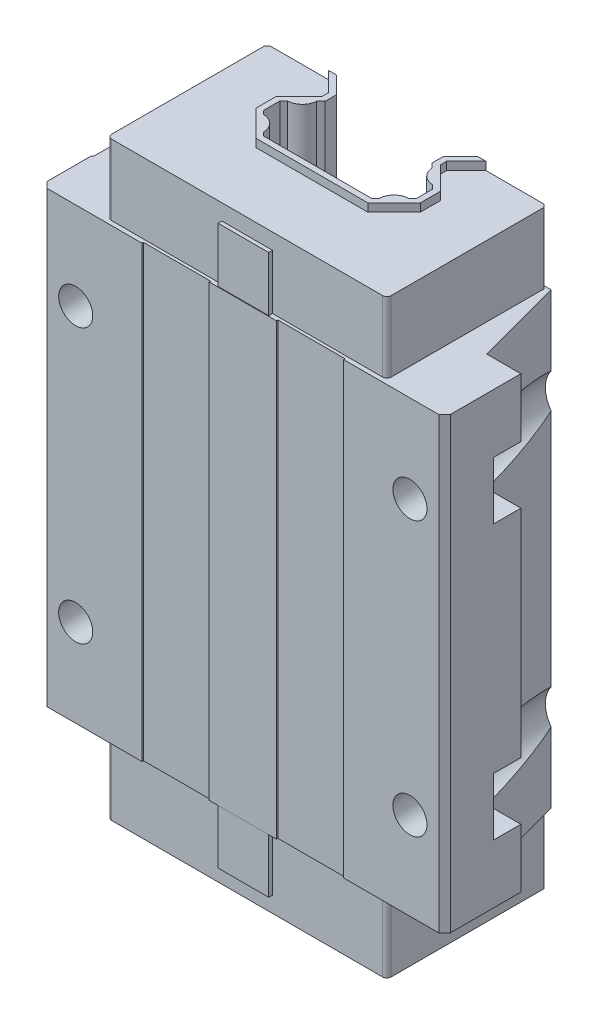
ISO-10303-21;
HEADER;
FILE_DESCRIPTION(('STEP AP214'),'2;1');
FILE_NAME('part.step','',(''),(''),'','','');
FILE_SCHEMA(('AUTOMOTIVE_DESIGN { 1 0 10303 214 1 1 1 1 }'));
ENDSEC;
DATA;
#1=APPLICATION_CONTEXT('core data for automotive mechanical design processes');
#2=APPLICATION_PROTOCOL_DEFINITION('international standard','automotive_design',2000,#1);
#3=PRODUCT_CONTEXT('',#1,'mechanical');
#4=PRODUCT('Part','Part','',(#3));
#5=PRODUCT_RELATED_PRODUCT_CATEGORY('part','',(#4));
#6=PRODUCT_DEFINITION_FORMATION('','',#4);
#7=PRODUCT_DEFINITION_CONTEXT('part definition',#1,'design');
#8=PRODUCT_DEFINITION('design','',#6,#7);
#9=PRODUCT_DEFINITION_SHAPE('','',#8);
#10=(LENGTH_UNIT() NAMED_UNIT(*) SI_UNIT(.MILLI.,.METRE.));
#11=(NAMED_UNIT(*) PLANE_ANGLE_UNIT() SI_UNIT($,.RADIAN.));
#12=(NAMED_UNIT(*) SI_UNIT($,.STERADIAN.) SOLID_ANGLE_UNIT());
#13=UNCERTAINTY_MEASURE_WITH_UNIT(LENGTH_MEASURE(1.E-05),#10,'distance_accuracy_value','');
#14=(GEOMETRIC_REPRESENTATION_CONTEXT(3) GLOBAL_UNCERTAINTY_ASSIGNED_CONTEXT((#13)) GLOBAL_UNIT_ASSIGNED_CONTEXT((#10,
#11,#12)) REPRESENTATION_CONTEXT('',''));
#15=CARTESIAN_POINT('',(0.,0.,0.));
#16=DIRECTION('',(0.,0.,1.));
#17=DIRECTION('',(1.,0.,0.));
#18=AXIS2_PLACEMENT_3D('',#15,#16,#17);
#19=CARTESIAN_POINT('',(-50.,-272.531906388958,-57.));
#20=DIRECTION('',(-0.965925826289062,0.,-0.258819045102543));
#21=DIRECTION('',(-0.258819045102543,0.,0.965925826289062));
#22=AXIS2_PLACEMENT_3D('',#19,#20,#21);
#23=PLANE('',#22);
#24=CARTESIAN_POINT('',(-58.,47.5,-27.1435935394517));
#25=DIRECTION('',(0.965925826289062,0.,0.258819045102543));
#26=DIRECTION('',(-0.258819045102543,0.,0.965925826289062));
#27=AXIS2_PLACEMENT_3D('',#24,#25,#26);
#28=ELLIPSE('',#27,38.6370330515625,10.0000000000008);
#29=CARTESIAN_POINT('',(-50.,53.5000000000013,-57.));
#30=VERTEX_POINT('',#29);
#31=CARTESIAN_POINT('',(-58.,57.5,-27.1435935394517));
#32=VERTEX_POINT('',#31);
#33=EDGE_CURVE('E10',#30,#32,#28,.T.);
#34=ORIENTED_EDGE('',*,*,#33,.T.);
#35=DIRECTION('',(-0.258819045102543,0.,0.965925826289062));
#36=VECTOR('',#35,1.);
#37=CARTESIAN_POINT('',(-50.,57.5,-57.));
#38=LINE('',#37,#36);
#39=CARTESIAN_POINT('',(-58.17245036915,57.5,-26.5));
#40=VERTEX_POINT('',#39);
#41=EDGE_CURVE('E27',#32,#40,#38,.T.);
#42=ORIENTED_EDGE('',*,*,#41,.T.);
#43=DIRECTION('',(0.,1.,0.));
#44=VECTOR('',#43,1.);
#45=CARTESIAN_POINT('',(-58.17245036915,-272.531906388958,-26.5));
#46=LINE('',#45,#44);
#47=CARTESIAN_POINT('',(-58.17245036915,77.9,-26.5));
#48=VERTEX_POINT('',#47);
#49=EDGE_CURVE('E1151',#40,#48,#46,.T.);
#50=ORIENTED_EDGE('',*,*,#49,.T.);
#51=DIRECTION('',(0.258819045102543,0.,-0.965925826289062));
#52=VECTOR('',#51,1.);
#53=CARTESIAN_POINT('',(-60.9006350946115,77.9,-16.3182759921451));
#54=LINE('',#53,#52);
#55=CARTESIAN_POINT('',(-50.,77.9,-57.));
#56=VERTEX_POINT('',#55);
#57=EDGE_CURVE('E1147',#48,#56,#54,.T.);
#58=ORIENTED_EDGE('',*,*,#57,.T.);
#59=DIRECTION('',(0.,1.,0.));
#60=VECTOR('',#59,1.);
#61=CARTESIAN_POINT('',(-50.,-272.531906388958,-57.));
#62=LINE('',#61,#60);
#63=EDGE_CURVE('E1468',#30,#56,#62,.T.);
#64=ORIENTED_EDGE('',*,*,#63,.F.);
#65=EDGE_LOOP('',(#34,#42,#50,#58,#64));
#66=FACE_BOUND('',#65,.T.);
#67=ADVANCED_FACE('F16',(#66),#23,.T.);
#68=CARTESIAN_POINT('',(-50.,-272.531906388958,-57.));
#69=DIRECTION('',(-0.965925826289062,0.,-0.258819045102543));
#70=DIRECTION('',(-0.258819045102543,0.,0.965925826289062));
#71=AXIS2_PLACEMENT_3D('',#68,#69,#70);
#72=PLANE('',#71);
#73=DIRECTION('',(0.258819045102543,0.,-0.965925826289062));
#74=VECTOR('',#73,1.);
#75=CARTESIAN_POINT('',(-50.,37.5,-57.));
#76=LINE('',#75,#74);
#77=CARTESIAN_POINT('',(-58.17245036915,37.5,-26.5));
#78=VERTEX_POINT('',#77);
#79=CARTESIAN_POINT('',(-58.,37.4999999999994,-27.1435935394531));
#80=VERTEX_POINT('',#79);
#81=EDGE_CURVE('E1152',#78,#80,#76,.T.);
#82=ORIENTED_EDGE('',*,*,#81,.T.);
#83=CARTESIAN_POINT('',(-58.,47.5,-27.1435935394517));
#84=DIRECTION('',(0.965925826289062,0.,0.258819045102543));
#85=DIRECTION('',(-0.258819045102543,0.,0.965925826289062));
#86=AXIS2_PLACEMENT_3D('',#83,#84,#85);
#87=ELLIPSE('',#86,38.6370330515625,10.0000000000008);
#88=CARTESIAN_POINT('',(-50.,41.4999999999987,-57.));
#89=VERTEX_POINT('',#88);
#90=EDGE_CURVE('E1157',#80,#89,#87,.T.);
#91=ORIENTED_EDGE('',*,*,#90,.T.);
#92=DIRECTION('',(0.,1.,0.));
#93=VECTOR('',#92,1.);
#94=CARTESIAN_POINT('',(-50.,-272.531906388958,-57.));
#95=LINE('',#94,#93);
#96=CARTESIAN_POINT('',(-50.,-41.4999999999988,-57.));
#97=VERTEX_POINT('',#96);
#98=EDGE_CURVE('E1079',#97,#89,#95,.T.);
#99=ORIENTED_EDGE('',*,*,#98,.F.);
#100=CARTESIAN_POINT('',(-58.,-47.5,-27.1435935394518));
#101=DIRECTION('',(-0.965925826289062,0.,-0.258819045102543));
#102=DIRECTION('',(-0.258819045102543,0.,0.965925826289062));
#103=AXIS2_PLACEMENT_3D('',#100,#101,#102);
#104=ELLIPSE('',#103,38.6370330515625,10.0000000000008);
#105=CARTESIAN_POINT('',(-58.,-37.5,-27.1435935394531));
#106=VERTEX_POINT('',#105);
#107=EDGE_CURVE('E744',#106,#97,#104,.T.);
#108=ORIENTED_EDGE('',*,*,#107,.F.);
#109=DIRECTION('',(0.258819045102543,0.,-0.965925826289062));
#110=VECTOR('',#109,1.);
#111=CARTESIAN_POINT('',(-50.,-37.5,-57.));
#112=LINE('',#111,#110);
#113=CARTESIAN_POINT('',(-58.17245036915,-37.5,-26.5));
#114=VERTEX_POINT('',#113);
#115=EDGE_CURVE('E1416',#114,#106,#112,.T.);
#116=ORIENTED_EDGE('',*,*,#115,.F.);
#117=DIRECTION('',(0.,1.,0.));
#118=VECTOR('',#117,1.);
#119=CARTESIAN_POINT('',(-58.17245036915,-272.531906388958,-26.5));
#120=LINE('',#119,#118);
#121=EDGE_CURVE('E1153',#114,#78,#120,.T.);
#122=ORIENTED_EDGE('',*,*,#121,.T.);
#123=EDGE_LOOP('',(#82,#91,#99,#108,#116,#122));
#124=FACE_BOUND('',#123,.T.);
#125=ADVANCED_FACE('F2612',(#124),#72,.T.);
#126=CARTESIAN_POINT('',(-69.5,-272.531906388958,-26.5));
#127=DIRECTION('',(0.,0.,-1.));
#128=DIRECTION('',(0.,-1.,0.));
#129=AXIS2_PLACEMENT_3D('',#126,#127,#128);
#130=PLANE('',#129);
#131=ORIENTED_EDGE('',*,*,#49,.F.);
#132=DIRECTION('',(-1.,0.,0.));
#133=VECTOR('',#132,1.);
#134=CARTESIAN_POINT('',(-69.5,57.5,-26.5));
#135=LINE('',#134,#133);
#136=CARTESIAN_POINT('',(-69.5,57.5,-26.5));
#137=VERTEX_POINT('',#136);
#138=EDGE_CURVE('E1158',#40,#137,#135,.T.);
#139=ORIENTED_EDGE('',*,*,#138,.T.);
#140=DIRECTION('',(0.,1.,0.));
#141=VECTOR('',#140,1.);
#142=CARTESIAN_POINT('',(-69.5,-272.531906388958,-26.5));
#143=LINE('',#142,#141);
#144=CARTESIAN_POINT('',(-69.5,77.9,-26.5));
#145=VERTEX_POINT('',#144);
#146=EDGE_CURVE('E1215',#137,#145,#143,.T.);
#147=ORIENTED_EDGE('',*,*,#146,.T.);
#148=DIRECTION('',(1.,0.,0.));
#149=VECTOR('',#148,1.);
#150=CARTESIAN_POINT('',(0.,77.9,-26.5));
#151=LINE('',#150,#149);
#152=EDGE_CURVE('E1024',#145,#48,#151,.T.);
#153=ORIENTED_EDGE('',*,*,#152,.T.);
#154=EDGE_LOOP('',(#131,#139,#147,#153));
#155=FACE_BOUND('',#154,.T.);
#156=ADVANCED_FACE('F2619',(#155),#130,.T.);
#157=CARTESIAN_POINT('',(-69.5,-272.531906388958,-26.5));
#158=DIRECTION('',(0.,0.,-1.));
#159=DIRECTION('',(0.,-1.,0.));
#160=AXIS2_PLACEMENT_3D('',#157,#158,#159);
#161=PLANE('',#160);
#162=DIRECTION('',(0.,1.,0.));
#163=VECTOR('',#162,1.);
#164=CARTESIAN_POINT('',(-69.5,-272.531906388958,-26.5));
#165=LINE('',#164,#163);
#166=CARTESIAN_POINT('',(-69.5,-37.5,-26.5));
#167=VERTEX_POINT('',#166);
#168=CARTESIAN_POINT('',(-69.5,37.5,-26.5));
#169=VERTEX_POINT('',#168);
#170=EDGE_CURVE('E1020',#167,#169,#165,.T.);
#171=ORIENTED_EDGE('',*,*,#170,.T.);
#172=DIRECTION('',(1.,0.,0.));
#173=VECTOR('',#172,1.);
#174=CARTESIAN_POINT('',(-69.5,37.5,-26.5));
#175=LINE('',#174,#173);
#176=EDGE_CURVE('E1025',#169,#78,#175,.T.);
#177=ORIENTED_EDGE('',*,*,#176,.T.);
#178=ORIENTED_EDGE('',*,*,#121,.F.);
#179=DIRECTION('',(1.,0.,0.));
#180=VECTOR('',#179,1.);
#181=CARTESIAN_POINT('',(-69.5,-37.5,-26.5));
#182=LINE('',#181,#180);
#183=EDGE_CURVE('E783',#167,#114,#182,.T.);
#184=ORIENTED_EDGE('',*,*,#183,.F.);
#185=EDGE_LOOP('',(#171,#177,#178,#184));
#186=FACE_BOUND('',#185,.T.);
#187=ADVANCED_FACE('F2723',(#186),#161,.T.);
#188=CARTESIAN_POINT('',(-69.5,-272.531906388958,-26.5));
#189=DIRECTION('',(-1.,0.,0.));
#190=DIRECTION('',(0.,0.,1.));
#191=AXIS2_PLACEMENT_3D('',#188,#189,#190);
#192=PLANE('',#191);
#193=ORIENTED_EDGE('',*,*,#146,.F.);
#194=DIRECTION('',(0.,0.,1.));
#195=VECTOR('',#194,1.);
#196=CARTESIAN_POINT('',(-69.5,57.5,-26.5));
#197=LINE('',#196,#195);
#198=CARTESIAN_POINT('',(-69.5,57.5,-18.));
#199=VERTEX_POINT('',#198);
#200=EDGE_CURVE('E1651',#137,#199,#197,.T.);
#201=ORIENTED_EDGE('',*,*,#200,.T.);
#202=DIRECTION('',(0.,1.,0.));
#203=VECTOR('',#202,1.);
#204=CARTESIAN_POINT('',(-69.5,-272.531906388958,-18.));
#205=LINE('',#204,#203);
#206=CARTESIAN_POINT('',(-69.5,77.9,-18.));
#207=VERTEX_POINT('',#206);
#208=EDGE_CURVE('E1648',#199,#207,#205,.T.);
#209=ORIENTED_EDGE('',*,*,#208,.T.);
#210=DIRECTION('',(0.,0.,-1.));
#211=VECTOR('',#210,1.);
#212=CARTESIAN_POINT('',(-69.5,77.9,0.));
#213=LINE('',#212,#211);
#214=EDGE_CURVE('E680',#207,#145,#213,.T.);
#215=ORIENTED_EDGE('',*,*,#214,.T.);
#216=EDGE_LOOP('',(#193,#201,#209,#215));
#217=FACE_BOUND('',#216,.T.);
#218=ADVANCED_FACE('F2726',(#217),#192,.T.);
#219=CARTESIAN_POINT('',(-69.5,-272.531906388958,-26.5));
#220=DIRECTION('',(-1.,0.,0.));
#221=DIRECTION('',(0.,0.,1.));
#222=AXIS2_PLACEMENT_3D('',#219,#220,#221);
#223=PLANE('',#222);
#224=DIRECTION('',(0.,1.,0.));
#225=VECTOR('',#224,1.);
#226=CARTESIAN_POINT('',(-69.5,-272.531906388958,-18.));
#227=LINE('',#226,#225);
#228=CARTESIAN_POINT('',(-69.5,-37.5,-18.));
#229=VERTEX_POINT('',#228);
#230=CARTESIAN_POINT('',(-69.5,37.5,-18.));
#231=VERTEX_POINT('',#230);
#232=EDGE_CURVE('E1784',#229,#231,#227,.T.);
#233=ORIENTED_EDGE('',*,*,#232,.T.);
#234=DIRECTION('',(0.,0.,-1.));
#235=VECTOR('',#234,1.);
#236=CARTESIAN_POINT('',(-69.5,37.5,-26.5));
#237=LINE('',#236,#235);
#238=EDGE_CURVE('E1788',#231,#169,#237,.T.);
#239=ORIENTED_EDGE('',*,*,#238,.T.);
#240=ORIENTED_EDGE('',*,*,#170,.F.);
#241=DIRECTION('',(0.,0.,-1.));
#242=VECTOR('',#241,1.);
#243=CARTESIAN_POINT('',(-69.5,-37.5,-26.5));
#244=LINE('',#243,#242);
#245=EDGE_CURVE('E787',#229,#167,#244,.T.);
#246=ORIENTED_EDGE('',*,*,#245,.F.);
#247=EDGE_LOOP('',(#233,#239,#240,#246));
#248=FACE_BOUND('',#247,.T.);
#249=ADVANCED_FACE('F2684',(#248),#223,.T.);
#250=CARTESIAN_POINT('',(-69.5,-272.531906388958,-18.));
#251=DIRECTION('',(-0.707106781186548,0.,-0.707106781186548));
#252=DIRECTION('',(-0.707106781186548,0.,0.707106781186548));
#253=AXIS2_PLACEMENT_3D('',#250,#251,#252);
#254=PLANE('',#253);
#255=ORIENTED_EDGE('',*,*,#208,.F.);
#256=DIRECTION('',(-0.707106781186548,0.,0.707106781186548));
#257=VECTOR('',#256,1.);
#258=CARTESIAN_POINT('',(-69.5,57.5,-18.));
#259=LINE('',#258,#257);
#260=CARTESIAN_POINT('',(-70.,57.5,-17.5));
#261=VERTEX_POINT('',#260);
#262=EDGE_CURVE('E690',#199,#261,#259,.T.);
#263=ORIENTED_EDGE('',*,*,#262,.T.);
#264=DIRECTION('',(0.,1.,0.));
#265=VECTOR('',#264,1.);
#266=CARTESIAN_POINT('',(-70.,-272.531906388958,-17.5));
#267=LINE('',#266,#265);
#268=CARTESIAN_POINT('',(-70.,77.9,-17.5));
#269=VERTEX_POINT('',#268);
#270=EDGE_CURVE('E684',#261,#269,#267,.T.);
#271=ORIENTED_EDGE('',*,*,#270,.T.);
#272=DIRECTION('',(0.707106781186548,0.,-0.707106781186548));
#273=VECTOR('',#272,1.);
#274=CARTESIAN_POINT('',(-43.75,77.9,-43.75));
#275=LINE('',#274,#273);
#276=EDGE_CURVE('E672',#269,#207,#275,.T.);
#277=ORIENTED_EDGE('',*,*,#276,.T.);
#278=EDGE_LOOP('',(#255,#263,#271,#277));
#279=FACE_BOUND('',#278,.T.);
#280=ADVANCED_FACE('F688',(#279),#254,.T.);
#281=CARTESIAN_POINT('',(-69.5,-272.531906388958,-18.));
#282=DIRECTION('',(-0.707106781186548,0.,-0.707106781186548));
#283=DIRECTION('',(-0.707106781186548,0.,0.707106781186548));
#284=AXIS2_PLACEMENT_3D('',#281,#282,#283);
#285=PLANE('',#284);
#286=DIRECTION('',(0.,1.,0.));
#287=VECTOR('',#286,1.);
#288=CARTESIAN_POINT('',(-70.,-272.531906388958,-17.5));
#289=LINE('',#288,#287);
#290=CARTESIAN_POINT('',(-70.,-37.5,-17.5));
#291=VERTEX_POINT('',#290);
#292=CARTESIAN_POINT('',(-70.,37.5,-17.5));
#293=VERTEX_POINT('',#292);
#294=EDGE_CURVE('E685',#291,#293,#289,.T.);
#295=ORIENTED_EDGE('',*,*,#294,.T.);
#296=DIRECTION('',(0.707106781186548,0.,-0.707106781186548));
#297=VECTOR('',#296,1.);
#298=CARTESIAN_POINT('',(-69.5,37.5,-18.));
#299=LINE('',#298,#297);
#300=EDGE_CURVE('E1776',#293,#231,#299,.T.);
#301=ORIENTED_EDGE('',*,*,#300,.T.);
#302=ORIENTED_EDGE('',*,*,#232,.F.);
#303=DIRECTION('',(0.707106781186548,0.,-0.707106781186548));
#304=VECTOR('',#303,1.);
#305=CARTESIAN_POINT('',(-69.5,-37.5,-18.));
#306=LINE('',#305,#304);
#307=EDGE_CURVE('E876',#291,#229,#306,.T.);
#308=ORIENTED_EDGE('',*,*,#307,.F.);
#309=EDGE_LOOP('',(#295,#301,#302,#308));
#310=FACE_BOUND('',#309,.T.);
#311=ADVANCED_FACE('F2683',(#310),#285,.T.);
#312=CARTESIAN_POINT('',(-70.,-272.531906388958,-2.));
#313=DIRECTION('',(-1.,0.,0.));
#314=DIRECTION('',(0.,0.,1.));
#315=AXIS2_PLACEMENT_3D('',#312,#313,#314);
#316=PLANE('',#315);
#317=ORIENTED_EDGE('',*,*,#270,.F.);
#318=DIRECTION('',(0.,0.,1.));
#319=VECTOR('',#318,1.);
#320=CARTESIAN_POINT('',(-70.,57.5,-2.));
#321=LINE('',#320,#319);
#322=CARTESIAN_POINT('',(-70.,57.5,-17.));
#323=VERTEX_POINT('',#322);
#324=EDGE_CURVE('E1503',#261,#323,#321,.T.);
#325=ORIENTED_EDGE('',*,*,#324,.T.);
#326=DIRECTION('',(0.,-1.,0.));
#327=VECTOR('',#326,1.);
#328=CARTESIAN_POINT('',(-70.,-272.531906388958,-17.));
#329=LINE('',#328,#327);
#330=CARTESIAN_POINT('',(-70.,37.5,-17.));
#331=VERTEX_POINT('',#330);
#332=EDGE_CURVE('E1499',#323,#331,#329,.T.);
#333=ORIENTED_EDGE('',*,*,#332,.T.);
#334=DIRECTION('',(0.,0.,-1.));
#335=VECTOR('',#334,1.);
#336=CARTESIAN_POINT('',(-70.,37.5,-2.));
#337=LINE('',#336,#335);
#338=EDGE_CURVE('E1504',#331,#293,#337,.T.);
#339=ORIENTED_EDGE('',*,*,#338,.T.);
#340=ORIENTED_EDGE('',*,*,#294,.F.);
#341=DIRECTION('',(0.,0.,-1.));
#342=VECTOR('',#341,1.);
#343=CARTESIAN_POINT('',(-70.,-37.5,-2.));
#344=LINE('',#343,#342);
#345=CARTESIAN_POINT('',(-70.,-37.5,-17.));
#346=VERTEX_POINT('',#345);
#347=EDGE_CURVE('E880',#346,#291,#344,.T.);
#348=ORIENTED_EDGE('',*,*,#347,.F.);
#349=DIRECTION('',(0.,1.,0.));
#350=VECTOR('',#349,1.);
#351=CARTESIAN_POINT('',(-70.,-272.531906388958,-17.));
#352=LINE('',#351,#350);
#353=CARTESIAN_POINT('',(-70.,-57.5,-17.));
#354=VERTEX_POINT('',#353);
#355=EDGE_CURVE('E967',#354,#346,#352,.T.);
#356=ORIENTED_EDGE('',*,*,#355,.F.);
#357=DIRECTION('',(0.,0.,1.));
#358=VECTOR('',#357,1.);
#359=CARTESIAN_POINT('',(-70.,-57.5,-2.));
#360=LINE('',#359,#358);
#361=CARTESIAN_POINT('',(-70.,-57.5,-17.5));
#362=VERTEX_POINT('',#361);
#363=EDGE_CURVE('E966',#362,#354,#360,.T.);
#364=ORIENTED_EDGE('',*,*,#363,.F.);
#365=DIRECTION('',(0.,1.,0.));
#366=VECTOR('',#365,1.);
#367=CARTESIAN_POINT('',(-70.,-272.531906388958,-17.5));
#368=LINE('',#367,#366);
#369=CARTESIAN_POINT('',(-70.,-77.9,-17.5));
#370=VERTEX_POINT('',#369);
#371=EDGE_CURVE('E789',#370,#362,#368,.T.);
#372=ORIENTED_EDGE('',*,*,#371,.F.);
#373=DIRECTION('',(0.,0.,1.));
#374=VECTOR('',#373,1.);
#375=CARTESIAN_POINT('',(-70.,-77.9,0.));
#376=LINE('',#375,#374);
#377=CARTESIAN_POINT('',(-70.,-77.9,-2.));
#378=VERTEX_POINT('',#377);
#379=EDGE_CURVE('E708',#370,#378,#376,.T.);
#380=ORIENTED_EDGE('',*,*,#379,.T.);
#381=DIRECTION('',(0.,1.,0.));
#382=VECTOR('',#381,1.);
#383=CARTESIAN_POINT('',(-70.,-272.531906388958,-2.));
#384=LINE('',#383,#382);
#385=CARTESIAN_POINT('',(-70.,77.9,-2.));
#386=VERTEX_POINT('',#385);
#387=EDGE_CURVE('E699',#378,#386,#384,.T.);
#388=ORIENTED_EDGE('',*,*,#387,.T.);
#389=DIRECTION('',(0.,0.,-1.));
#390=VECTOR('',#389,1.);
#391=CARTESIAN_POINT('',(-70.,77.9,0.));
#392=LINE('',#391,#390);
#393=EDGE_CURVE('E677',#386,#269,#392,.T.);
#394=ORIENTED_EDGE('',*,*,#393,.T.);
#395=EDGE_LOOP('',(#317,#325,#333,#339,#340,#348,#356,#364,#372,#380,#388,#394));
#396=FACE_BOUND('',#395,.T.);
#397=ADVANCED_FACE('F696',(#396),#316,.T.);
#398=CARTESIAN_POINT('',(-58.,47.5,0.));
#399=DIRECTION('',(0.,0.,-1.));
#400=DIRECTION('',(0.,-1.,0.));
#401=AXIS2_PLACEMENT_3D('',#398,#399,#400);
#402=CYLINDRICAL_SURFACE('',#401,5.9175);
#403=CARTESIAN_POINT('',(-58.,47.5,0.));
#404=DIRECTION('',(0.,0.,-1.));
#405=DIRECTION('',(0.,-1.,0.));
#406=AXIS2_PLACEMENT_3D('',#403,#404,#405);
#407=CIRCLE('',#406,5.9175);
#408=CARTESIAN_POINT('',(-58.,41.5825,0.));
#409=VERTEX_POINT('',#408);
#410=EDGE_CURVE('E859',#409,#409,#407,.T.);
#411=ORIENTED_EDGE('',*,*,#410,.F.);
#412=EDGE_LOOP('',(#411));
#413=FACE_BOUND('',#412,.T.);
#414=CARTESIAN_POINT('',(-58.,47.5,-17.));
#415=DIRECTION('',(0.,0.,1.));
#416=DIRECTION('',(-1.,0.,0.));
#417=AXIS2_PLACEMENT_3D('',#414,#415,#416);
#418=CIRCLE('',#417,5.9175);
#419=CARTESIAN_POINT('',(-63.9175,47.5,-17.));
#420=VERTEX_POINT('',#419);
#421=EDGE_CURVE('E1384',#420,#420,#418,.T.);
#422=ORIENTED_EDGE('',*,*,#421,.F.);
#423=EDGE_LOOP('',(#422));
#424=FACE_BOUND('',#423,.T.);
#425=ADVANCED_FACE('F2778',(#413,#424),#402,.F.);
#426=CARTESIAN_POINT('',(70.,-272.531906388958,-26.5));
#427=DIRECTION('',(1.,0.,0.));
#428=DIRECTION('',(0.,1.,0.));
#429=AXIS2_PLACEMENT_3D('',#426,#427,#428);
#430=PLANE('',#429);
#431=DIRECTION('',(0.,1.,0.));
#432=VECTOR('',#431,1.);
#433=CARTESIAN_POINT('',(70.,-272.531906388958,-17.));
#434=LINE('',#433,#432);
#435=CARTESIAN_POINT('',(70.,-57.5,-17.));
#436=VERTEX_POINT('',#435);
#437=CARTESIAN_POINT('',(70.,-37.5,-17.));
#438=VERTEX_POINT('',#437);
#439=EDGE_CURVE('E702',#436,#438,#434,.T.);
#440=ORIENTED_EDGE('',*,*,#439,.T.);
#441=DIRECTION('',(0.,0.,-1.));
#442=VECTOR('',#441,1.);
#443=CARTESIAN_POINT('',(70.,-37.5,-26.5));
#444=LINE('',#443,#442);
#445=CARTESIAN_POINT('',(70.,-37.5,-26.5));
#446=VERTEX_POINT('',#445);
#447=EDGE_CURVE('E712',#438,#446,#444,.T.);
#448=ORIENTED_EDGE('',*,*,#447,.T.);
#449=DIRECTION('',(0.,1.,0.));
#450=VECTOR('',#449,1.);
#451=CARTESIAN_POINT('',(70.,-272.531906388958,-26.5));
#452=LINE('',#451,#450);
#453=CARTESIAN_POINT('',(70.,37.5,-26.5));
#454=VERTEX_POINT('',#453);
#455=EDGE_CURVE('E981',#446,#454,#452,.T.);
#456=ORIENTED_EDGE('',*,*,#455,.T.);
#457=DIRECTION('',(0.,0.,-1.));
#458=VECTOR('',#457,1.);
#459=CARTESIAN_POINT('',(70.,37.5,-26.5));
#460=LINE('',#459,#458);
#461=CARTESIAN_POINT('',(70.,37.5,-17.));
#462=VERTEX_POINT('',#461);
#463=EDGE_CURVE('E1318',#462,#454,#460,.T.);
#464=ORIENTED_EDGE('',*,*,#463,.F.);
#465=DIRECTION('',(0.,-1.,0.));
#466=VECTOR('',#465,1.);
#467=CARTESIAN_POINT('',(70.,-272.531906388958,-17.));
#468=LINE('',#467,#466);
#469=CARTESIAN_POINT('',(70.,57.5,-17.));
#470=VERTEX_POINT('',#469);
#471=EDGE_CURVE('E807',#470,#462,#468,.T.);
#472=ORIENTED_EDGE('',*,*,#471,.F.);
#473=DIRECTION('',(0.,0.,1.));
#474=VECTOR('',#473,1.);
#475=CARTESIAN_POINT('',(70.,57.5,-26.5));
#476=LINE('',#475,#474);
#477=CARTESIAN_POINT('',(70.,57.5,-26.5));
#478=VERTEX_POINT('',#477);
#479=EDGE_CURVE('E869',#478,#470,#476,.T.);
#480=ORIENTED_EDGE('',*,*,#479,.F.);
#481=DIRECTION('',(0.,1.,0.));
#482=VECTOR('',#481,1.);
#483=CARTESIAN_POINT('',(70.,-272.531906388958,-26.5));
#484=LINE('',#483,#482);
#485=CARTESIAN_POINT('',(70.,77.9,-26.5));
#486=VERTEX_POINT('',#485);
#487=EDGE_CURVE('E977',#478,#486,#484,.T.);
#488=ORIENTED_EDGE('',*,*,#487,.T.);
#489=DIRECTION('',(0.,0.,1.));
#490=VECTOR('',#489,1.);
#491=CARTESIAN_POINT('',(70.,77.9,0.));
#492=LINE('',#491,#490);
#493=CARTESIAN_POINT('',(70.,77.9,-2.));
#494=VERTEX_POINT('',#493);
#495=EDGE_CURVE('E982',#486,#494,#492,.T.);
#496=ORIENTED_EDGE('',*,*,#495,.T.);
#497=DIRECTION('',(0.,1.,0.));
#498=VECTOR('',#497,1.);
#499=CARTESIAN_POINT('',(70.,-272.531906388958,-2.));
#500=LINE('',#499,#498);
#501=CARTESIAN_POINT('',(70.,-77.9,-2.));
#502=VERTEX_POINT('',#501);
#503=EDGE_CURVE('E1173',#502,#494,#500,.T.);
#504=ORIENTED_EDGE('',*,*,#503,.F.);
#505=DIRECTION('',(0.,0.,-1.));
#506=VECTOR('',#505,1.);
#507=CARTESIAN_POINT('',(70.,-77.9,0.));
#508=LINE('',#507,#506);
#509=CARTESIAN_POINT('',(70.,-77.9,-26.5));
#510=VERTEX_POINT('',#509);
#511=EDGE_CURVE('E1042',#502,#510,#508,.T.);
#512=ORIENTED_EDGE('',*,*,#511,.T.);
#513=DIRECTION('',(0.,1.,0.));
#514=VECTOR('',#513,1.);
#515=CARTESIAN_POINT('',(70.,-272.531906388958,-26.5));
#516=LINE('',#515,#514);
#517=CARTESIAN_POINT('',(70.,-57.5,-26.5));
#518=VERTEX_POINT('',#517);
#519=EDGE_CURVE('E1780',#510,#518,#516,.T.);
#520=ORIENTED_EDGE('',*,*,#519,.T.);
#521=DIRECTION('',(0.,0.,1.));
#522=VECTOR('',#521,1.);
#523=CARTESIAN_POINT('',(70.,-57.5,-26.5));
#524=LINE('',#523,#522);
#525=EDGE_CURVE('E904',#518,#436,#524,.T.);
#526=ORIENTED_EDGE('',*,*,#525,.T.);
#527=EDGE_LOOP('',(#440,#448,#456,#464,#472,#480,#488,#496,#504,#512,#520,#526));
#528=FACE_BOUND('',#527,.T.);
#529=ADVANCED_FACE('F2708',(#528),#430,.T.);
#530=CARTESIAN_POINT('',(58.17245036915,-272.531906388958,-26.5));
#531=DIRECTION('',(0.,0.,-1.));
#532=DIRECTION('',(0.,-1.,0.));
#533=AXIS2_PLACEMENT_3D('',#530,#531,#532);
#534=PLANE('',#533);
#535=ORIENTED_EDGE('',*,*,#455,.F.);
#536=DIRECTION('',(-1.,0.,0.));
#537=VECTOR('',#536,1.);
#538=CARTESIAN_POINT('',(58.17245036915,-37.5,-26.5));
#539=LINE('',#538,#537);
#540=CARTESIAN_POINT('',(58.17245036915,-37.5,-26.5));
#541=VERTEX_POINT('',#540);
#542=EDGE_CURVE('E900',#446,#541,#539,.T.);
#543=ORIENTED_EDGE('',*,*,#542,.T.);
#544=DIRECTION('',(0.,1.,0.));
#545=VECTOR('',#544,1.);
#546=CARTESIAN_POINT('',(58.17245036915,-272.531906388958,-26.5));
#547=LINE('',#546,#545);
#548=CARTESIAN_POINT('',(58.17245036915,37.5,-26.5));
#549=VERTEX_POINT('',#548);
#550=EDGE_CURVE('E721',#541,#549,#547,.T.);
#551=ORIENTED_EDGE('',*,*,#550,.T.);
#552=DIRECTION('',(-1.,0.,0.));
#553=VECTOR('',#552,1.);
#554=CARTESIAN_POINT('',(58.17245036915,37.5,-26.5));
#555=LINE('',#554,#553);
#556=EDGE_CURVE('E1322',#454,#549,#555,.T.);
#557=ORIENTED_EDGE('',*,*,#556,.F.);
#558=EDGE_LOOP('',(#535,#543,#551,#557));
#559=FACE_BOUND('',#558,.T.);
#560=ADVANCED_FACE('F2704',(#559),#534,.T.);
#561=CARTESIAN_POINT('',(58.17245036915,-272.531906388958,-26.5));
#562=DIRECTION('',(0.,0.,-1.));
#563=DIRECTION('',(0.,-1.,0.));
#564=AXIS2_PLACEMENT_3D('',#561,#562,#563);
#565=PLANE('',#564);
#566=DIRECTION('',(0.,1.,0.));
#567=VECTOR('',#566,1.);
#568=CARTESIAN_POINT('',(58.17245036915,-272.531906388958,-26.5));
#569=LINE('',#568,#567);
#570=CARTESIAN_POINT('',(58.17245036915,-77.9,-26.5));
#571=VERTEX_POINT('',#570);
#572=CARTESIAN_POINT('',(58.17245036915,-57.5,-26.5));
#573=VERTEX_POINT('',#572);
#574=EDGE_CURVE('E718',#571,#573,#569,.T.);
#575=ORIENTED_EDGE('',*,*,#574,.T.);
#576=DIRECTION('',(1.,0.,0.));
#577=VECTOR('',#576,1.);
#578=CARTESIAN_POINT('',(58.1724503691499,-57.5,-26.5));
#579=LINE('',#578,#577);
#580=EDGE_CURVE('E722',#573,#518,#579,.T.);
#581=ORIENTED_EDGE('',*,*,#580,.T.);
#582=ORIENTED_EDGE('',*,*,#519,.F.);
#583=DIRECTION('',(-1.,0.,0.));
#584=VECTOR('',#583,1.);
#585=CARTESIAN_POINT('',(0.,-77.9,-26.5));
#586=LINE('',#585,#584);
#587=EDGE_CURVE('E1409',#510,#571,#586,.T.);
#588=ORIENTED_EDGE('',*,*,#587,.T.);
#589=EDGE_LOOP('',(#575,#581,#582,#588));
#590=FACE_BOUND('',#589,.T.);
#591=ADVANCED_FACE('F2707',(#590),#565,.T.);
#592=CARTESIAN_POINT('',(58.17245036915,-272.531906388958,-26.5));
#593=DIRECTION('',(0.965925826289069,0.,-0.258819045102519));
#594=DIRECTION('',(0.,-1.,0.));
#595=AXIS2_PLACEMENT_3D('',#592,#593,#594);
#596=PLANE('',#595);
#597=DIRECTION('',(-0.258819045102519,0.,-0.965925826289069));
#598=VECTOR('',#597,1.);
#599=CARTESIAN_POINT('',(58.17245036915,-37.5,-26.5));
#600=LINE('',#599,#598);
#601=CARTESIAN_POINT('',(58.,-37.5,-27.1435935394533));
#602=VERTEX_POINT('',#601);
#603=EDGE_CURVE('E838',#541,#602,#600,.T.);
#604=ORIENTED_EDGE('',*,*,#603,.T.);
#605=CARTESIAN_POINT('',(58.,-47.5,-27.1435935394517));
#606=DIRECTION('',(-0.965925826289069,0.,0.258819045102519));
#607=DIRECTION('',(0.258819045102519,0.,0.965925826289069));
#608=AXIS2_PLACEMENT_3D('',#605,#606,#607);
#609=ELLIPSE('',#608,38.6370330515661,10.0000000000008);
#610=CARTESIAN_POINT('',(50.0000000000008,-41.4999999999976,-57.));
#611=VERTEX_POINT('',#610);
#612=EDGE_CURVE('E834',#602,#611,#609,.T.);
#613=ORIENTED_EDGE('',*,*,#612,.T.);
#614=DIRECTION('',(0.,1.,0.));
#615=VECTOR('',#614,1.);
#616=CARTESIAN_POINT('',(50.0000000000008,-272.531906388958,-57.));
#617=LINE('',#616,#615);
#618=CARTESIAN_POINT('',(50.0000000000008,41.4999999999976,-57.));
#619=VERTEX_POINT('',#618);
#620=EDGE_CURVE('E839',#611,#619,#617,.T.);
#621=ORIENTED_EDGE('',*,*,#620,.T.);
#622=CARTESIAN_POINT('',(58.,47.5,-27.1435935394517));
#623=DIRECTION('',(0.965925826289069,0.,-0.258819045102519));
#624=DIRECTION('',(0.258819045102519,0.,0.965925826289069));
#625=AXIS2_PLACEMENT_3D('',#622,#623,#624);
#626=ELLIPSE('',#625,38.6370330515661,10.0000000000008);
#627=CARTESIAN_POINT('',(58.,37.4999999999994,-27.1435935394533));
#628=VERTEX_POINT('',#627);
#629=EDGE_CURVE('E1138',#628,#619,#626,.T.);
#630=ORIENTED_EDGE('',*,*,#629,.F.);
#631=DIRECTION('',(-0.258819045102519,0.,-0.965925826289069));
#632=VECTOR('',#631,1.);
#633=CARTESIAN_POINT('',(58.17245036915,37.5,-26.5));
#634=LINE('',#633,#632);
#635=EDGE_CURVE('E1692',#549,#628,#634,.T.);
#636=ORIENTED_EDGE('',*,*,#635,.F.);
#637=ORIENTED_EDGE('',*,*,#550,.F.);
#638=EDGE_LOOP('',(#604,#613,#621,#630,#636,#637));
#639=FACE_BOUND('',#638,.T.);
#640=ADVANCED_FACE('F2304',(#639),#596,.T.);
#641=CARTESIAN_POINT('',(58.17245036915,-272.531906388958,-26.5));
#642=DIRECTION('',(0.965925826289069,0.,-0.258819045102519));
#643=DIRECTION('',(0.,-1.,0.));
#644=AXIS2_PLACEMENT_3D('',#641,#642,#643);
#645=PLANE('',#644);
#646=DIRECTION('',(0.,1.,0.));
#647=VECTOR('',#646,1.);
#648=CARTESIAN_POINT('',(50.0000000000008,-272.531906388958,-57.));
#649=LINE('',#648,#647);
#650=CARTESIAN_POINT('',(50.0000000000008,-77.9,-57.));
#651=VERTEX_POINT('',#650);
#652=CARTESIAN_POINT('',(50.0000000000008,-53.5000000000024,-57.));
#653=VERTEX_POINT('',#652);
#654=EDGE_CURVE('E1449',#651,#653,#649,.T.);
#655=ORIENTED_EDGE('',*,*,#654,.T.);
#656=CARTESIAN_POINT('',(58.,-47.5,-27.1435935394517));
#657=DIRECTION('',(-0.965925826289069,0.,0.258819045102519));
#658=DIRECTION('',(0.258819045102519,0.,0.965925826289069));
#659=AXIS2_PLACEMENT_3D('',#656,#657,#658);
#660=ELLIPSE('',#659,38.6370330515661,10.0000000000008);
#661=CARTESIAN_POINT('',(58.,-57.5,-27.1435935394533));
#662=VERTEX_POINT('',#661);
#663=EDGE_CURVE('E1445',#653,#662,#660,.T.);
#664=ORIENTED_EDGE('',*,*,#663,.T.);
#665=DIRECTION('',(0.258819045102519,0.,0.965925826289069));
#666=VECTOR('',#665,1.);
#667=CARTESIAN_POINT('',(58.17245036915,-57.5,-26.5));
#668=LINE('',#667,#666);
#669=EDGE_CURVE('E1408',#662,#573,#668,.T.);
#670=ORIENTED_EDGE('',*,*,#669,.T.);
#671=ORIENTED_EDGE('',*,*,#574,.F.);
#672=DIRECTION('',(-0.258819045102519,0.,-0.965925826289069));
#673=VECTOR('',#672,1.);
#674=CARTESIAN_POINT('',(60.9006350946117,-77.9,-16.3182759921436));
#675=LINE('',#674,#673);
#676=EDGE_CURVE('E1015',#571,#651,#675,.T.);
#677=ORIENTED_EDGE('',*,*,#676,.T.);
#678=EDGE_LOOP('',(#655,#664,#670,#671,#677));
#679=FACE_BOUND('',#678,.T.);
#680=ADVANCED_FACE('F1562',(#679),#645,.T.);
#681=CARTESIAN_POINT('',(58.,-47.5,0.));
#682=DIRECTION('',(0.,0.,-1.));
#683=DIRECTION('',(0.,-1.,0.));
#684=AXIS2_PLACEMENT_3D('',#681,#682,#683);
#685=CYLINDRICAL_SURFACE('',#684,5.9175);
#686=CARTESIAN_POINT('',(58.,-47.5,0.));
#687=DIRECTION('',(0.,0.,-1.));
#688=DIRECTION('',(0.,-1.,0.));
#689=AXIS2_PLACEMENT_3D('',#686,#687,#688);
#690=CIRCLE('',#689,5.9175);
#691=CARTESIAN_POINT('',(58.,-53.4175,0.));
#692=VERTEX_POINT('',#691);
#693=EDGE_CURVE('E1188',#692,#692,#690,.T.);
#694=ORIENTED_EDGE('',*,*,#693,.F.);
#695=EDGE_LOOP('',(#694));
#696=FACE_BOUND('',#695,.T.);
#697=CARTESIAN_POINT('',(58.,-47.5,-17.));
#698=DIRECTION('',(0.,0.,1.));
#699=DIRECTION('',(-1.,0.,0.));
#700=AXIS2_PLACEMENT_3D('',#697,#698,#699);
#701=CIRCLE('',#700,5.9175);
#702=CARTESIAN_POINT('',(52.0825,-47.5,-17.));
#703=VERTEX_POINT('',#702);
#704=EDGE_CURVE('E881',#703,#703,#701,.T.);
#705=ORIENTED_EDGE('',*,*,#704,.F.);
#706=EDGE_LOOP('',(#705));
#707=FACE_BOUND('',#706,.T.);
#708=ADVANCED_FACE('F1558',(#696,#707),#685,.F.);
#709=CARTESIAN_POINT('',(58.17245036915,-272.531906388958,-26.5));
#710=DIRECTION('',(0.,0.,-1.));
#711=DIRECTION('',(0.,-1.,0.));
#712=AXIS2_PLACEMENT_3D('',#709,#710,#711);
#713=PLANE('',#712);
#714=DIRECTION('',(1.,0.,0.));
#715=VECTOR('',#714,1.);
#716=CARTESIAN_POINT('',(58.1724503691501,57.5,-26.5));
#717=LINE('',#716,#715);
#718=CARTESIAN_POINT('',(58.17245036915,57.5,-26.5));
#719=VERTEX_POINT('',#718);
#720=EDGE_CURVE('E1053',#719,#478,#717,.T.);
#721=ORIENTED_EDGE('',*,*,#720,.F.);
#722=DIRECTION('',(0.,1.,0.));
#723=VECTOR('',#722,1.);
#724=CARTESIAN_POINT('',(58.17245036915,-272.531906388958,-26.5));
#725=LINE('',#724,#723);
#726=CARTESIAN_POINT('',(58.17245036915,77.9,-26.5));
#727=VERTEX_POINT('',#726);
#728=EDGE_CURVE('E1011',#719,#727,#725,.T.);
#729=ORIENTED_EDGE('',*,*,#728,.T.);
#730=DIRECTION('',(1.,0.,0.));
#731=VECTOR('',#730,1.);
#732=CARTESIAN_POINT('',(0.,77.9,-26.5));
#733=LINE('',#732,#731);
#734=EDGE_CURVE('E1016',#727,#486,#733,.T.);
#735=ORIENTED_EDGE('',*,*,#734,.T.);
#736=ORIENTED_EDGE('',*,*,#487,.F.);
#737=EDGE_LOOP('',(#721,#729,#735,#736));
#738=FACE_BOUND('',#737,.T.);
#739=ADVANCED_FACE('F1561',(#738),#713,.T.);
#740=CARTESIAN_POINT('',(58.17245036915,-272.531906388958,-26.5));
#741=DIRECTION('',(0.965925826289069,0.,-0.258819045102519));
#742=DIRECTION('',(0.,-1.,0.));
#743=AXIS2_PLACEMENT_3D('',#740,#741,#742);
#744=PLANE('',#743);
#745=DIRECTION('',(0.258819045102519,0.,0.965925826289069));
#746=VECTOR('',#745,1.);
#747=CARTESIAN_POINT('',(58.17245036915,57.5,-26.5));
#748=LINE('',#747,#746);
#749=CARTESIAN_POINT('',(58.,57.5,-27.1435935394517));
#750=VERTEX_POINT('',#749);
#751=EDGE_CURVE('E870',#750,#719,#748,.T.);
#752=ORIENTED_EDGE('',*,*,#751,.F.);
#753=CARTESIAN_POINT('',(58.,47.5,-27.1435935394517));
#754=DIRECTION('',(0.965925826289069,0.,-0.258819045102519));
#755=DIRECTION('',(0.258819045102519,0.,0.965925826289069));
#756=AXIS2_PLACEMENT_3D('',#753,#754,#755);
#757=ELLIPSE('',#756,38.6370330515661,10.0000000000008);
#758=CARTESIAN_POINT('',(50.0000000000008,53.5000000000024,-57.));
#759=VERTEX_POINT('',#758);
#760=EDGE_CURVE('E1219',#759,#750,#757,.T.);
#761=ORIENTED_EDGE('',*,*,#760,.F.);
#762=DIRECTION('',(0.,1.,0.));
#763=VECTOR('',#762,1.);
#764=CARTESIAN_POINT('',(50.0000000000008,-272.531906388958,-57.));
#765=LINE('',#764,#763);
#766=CARTESIAN_POINT('',(50.0000000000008,77.9,-57.));
#767=VERTEX_POINT('',#766);
#768=EDGE_CURVE('E987',#759,#767,#765,.T.);
#769=ORIENTED_EDGE('',*,*,#768,.T.);
#770=DIRECTION('',(0.258819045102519,0.,0.965925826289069));
#771=VECTOR('',#770,1.);
#772=CARTESIAN_POINT('',(60.9006350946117,77.9,-16.3182759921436));
#773=LINE('',#772,#771);
#774=EDGE_CURVE('E983',#767,#727,#773,.T.);
#775=ORIENTED_EDGE('',*,*,#774,.T.);
#776=ORIENTED_EDGE('',*,*,#728,.F.);
#777=EDGE_LOOP('',(#752,#761,#769,#775,#776));
#778=FACE_BOUND('',#777,.T.);
#779=ADVANCED_FACE('F2649',(#778),#744,.T.);
#780=CARTESIAN_POINT('',(0.,77.9,0.));
#781=DIRECTION('',(0.,1.,0.));
#782=DIRECTION('',(1.,0.,0.));
#783=AXIS2_PLACEMENT_3D('',#780,#781,#782);
#784=PLANE('',#783);
#785=DIRECTION('',(1.,0.,0.));
#786=VECTOR('',#785,1.);
#787=CARTESIAN_POINT('',(-47.,77.9,-1.49999999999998));
#788=LINE('',#787,#786);
#789=CARTESIAN_POINT('',(8.8,77.9,-1.49999999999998));
#790=VERTEX_POINT('',#789);
#791=CARTESIAN_POINT('',(47.,77.9,-1.49999999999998));
#792=VERTEX_POINT('',#791);
#793=EDGE_CURVE('E1428',#790,#792,#788,.T.);
#794=ORIENTED_EDGE('',*,*,#793,.F.);
#795=DIRECTION('',(0.,0.,1.));
#796=VECTOR('',#795,1.);
#797=CARTESIAN_POINT('',(8.8,77.9,-1.49999999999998));
#798=LINE('',#797,#796);
#799=CARTESIAN_POINT('',(8.8,77.9,-0.199999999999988));
#800=VERTEX_POINT('',#799);
#801=EDGE_CURVE('E988',#790,#800,#798,.T.);
#802=ORIENTED_EDGE('',*,*,#801,.T.);
#803=DIRECTION('',(-1.,0.,0.));
#804=VECTOR('',#803,1.);
#805=CARTESIAN_POINT('',(8.8,77.9,-0.199999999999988));
#806=LINE('',#805,#804);
#807=CARTESIAN_POINT('',(-8.8,77.9,-0.199999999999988));
#808=VERTEX_POINT('',#807);
#809=EDGE_CURVE('E1495',#800,#808,#806,.T.);
#810=ORIENTED_EDGE('',*,*,#809,.T.);
#811=DIRECTION('',(0.,0.,-1.));
#812=VECTOR('',#811,1.);
#813=CARTESIAN_POINT('',(-8.8,77.9,-0.199999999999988));
#814=LINE('',#813,#812);
#815=CARTESIAN_POINT('',(-8.8,77.9,-1.49999999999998));
#816=VERTEX_POINT('',#815);
#817=EDGE_CURVE('E1078',#808,#816,#814,.T.);
#818=ORIENTED_EDGE('',*,*,#817,.T.);
#819=DIRECTION('',(1.,0.,0.));
#820=VECTOR('',#819,1.);
#821=CARTESIAN_POINT('',(-47.,77.9,-1.49999999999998));
#822=LINE('',#821,#820);
#823=CARTESIAN_POINT('',(-47.,77.9,-1.5));
#824=VERTEX_POINT('',#823);
#825=EDGE_CURVE('E1514',#824,#816,#822,.T.);
#826=ORIENTED_EDGE('',*,*,#825,.F.);
#827=CARTESIAN_POINT('',(-47.,77.9,-3.));
#828=DIRECTION('',(0.,1.,0.));
#829=DIRECTION('',(1.,0.,0.));
#830=AXIS2_PLACEMENT_3D('',#827,#828,#829);
#831=CIRCLE('',#830,1.5);
#832=CARTESIAN_POINT('',(-48.5,77.9,-3.));
#833=VERTEX_POINT('',#832);
#834=EDGE_CURVE('E1001',#833,#824,#831,.T.);
#835=ORIENTED_EDGE('',*,*,#834,.F.);
#836=DIRECTION('',(0.,0.,1.));
#837=VECTOR('',#836,1.);
#838=CARTESIAN_POINT('',(-48.5,77.9,-56.));
#839=LINE('',#838,#837);
#840=CARTESIAN_POINT('',(-48.5,77.9,-56.));
#841=VERTEX_POINT('',#840);
#842=EDGE_CURVE('E910',#841,#833,#839,.T.);
#843=ORIENTED_EDGE('',*,*,#842,.F.);
#844=DIRECTION('',(-0.707106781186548,0.,0.707106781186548));
#845=VECTOR('',#844,1.);
#846=CARTESIAN_POINT('',(-47.5,77.9,-57.));
#847=LINE('',#846,#845);
#848=CARTESIAN_POINT('',(-47.5,77.9,-57.));
#849=VERTEX_POINT('',#848);
#850=EDGE_CURVE('E1113',#849,#841,#847,.T.);
#851=ORIENTED_EDGE('',*,*,#850,.F.);
#852=DIRECTION('',(1.,0.,0.));
#853=VECTOR('',#852,1.);
#854=CARTESIAN_POINT('',(-3.58291827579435E-12,77.9,-57.0000000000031));
#855=LINE('',#854,#853);
#856=EDGE_CURVE('E1464',#56,#849,#855,.T.);
#857=ORIENTED_EDGE('',*,*,#856,.F.);
#858=ORIENTED_EDGE('',*,*,#57,.F.);
#859=ORIENTED_EDGE('',*,*,#152,.F.);
#860=ORIENTED_EDGE('',*,*,#214,.F.);
#861=ORIENTED_EDGE('',*,*,#276,.F.);
#862=ORIENTED_EDGE('',*,*,#393,.F.);
#863=DIRECTION('',(-0.707106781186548,0.,-0.707106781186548));
#864=VECTOR('',#863,1.);
#865=CARTESIAN_POINT('',(-34.,77.9,34.));
#866=LINE('',#865,#864);
#867=CARTESIAN_POINT('',(-68.,77.9,0.));
#868=VERTEX_POINT('',#867);
#869=EDGE_CURVE('E927',#868,#386,#866,.T.);
#870=ORIENTED_EDGE('',*,*,#869,.F.);
#871=DIRECTION('',(1.,0.,0.));
#872=VECTOR('',#871,1.);
#873=CARTESIAN_POINT('',(-100.,77.9,0.));
#874=LINE('',#873,#872);
#875=CARTESIAN_POINT('',(-35.,77.9,0.));
#876=VERTEX_POINT('',#875);
#877=EDGE_CURVE('E1074',#868,#876,#874,.T.);
#878=ORIENTED_EDGE('',*,*,#877,.T.);
#879=DIRECTION('',(0.,0.,1.));
#880=VECTOR('',#879,1.);
#881=CARTESIAN_POINT('',(-35.,77.9,9.71445146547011E-13));
#882=LINE('',#881,#880);
#883=CARTESIAN_POINT('',(-35.,77.9,-0.5));
#884=VERTEX_POINT('',#883);
#885=EDGE_CURVE('E905',#884,#876,#882,.T.);
#886=ORIENTED_EDGE('',*,*,#885,.F.);
#887=DIRECTION('',(-1.,0.,0.));
#888=VECTOR('',#887,1.);
#889=CARTESIAN_POINT('',(0.,77.9,-0.5));
#890=LINE('',#889,#888);
#891=CARTESIAN_POINT('',(-11.66666666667,77.9,-0.5));
#892=VERTEX_POINT('',#891);
#893=EDGE_CURVE('E961',#892,#884,#890,.T.);
#894=ORIENTED_EDGE('',*,*,#893,.F.);
#895=DIRECTION('',(0.,0.,-1.));
#896=VECTOR('',#895,1.);
#897=CARTESIAN_POINT('',(-11.66666666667,77.9,-4.45245692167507E-13));
#898=LINE('',#897,#896);
#899=CARTESIAN_POINT('',(-11.66666666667,77.9,0.));
#900=VERTEX_POINT('',#899);
#901=EDGE_CURVE('E1047',#900,#892,#898,.T.);
#902=ORIENTED_EDGE('',*,*,#901,.F.);
#903=DIRECTION('',(1.,0.,0.));
#904=VECTOR('',#903,1.);
#905=CARTESIAN_POINT('',(-100.,77.9,0.));
#906=LINE('',#905,#904);
#907=CARTESIAN_POINT('',(11.66666666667,77.9,0.));
#908=VERTEX_POINT('',#907);
#909=EDGE_CURVE('E946',#900,#908,#906,.T.);
#910=ORIENTED_EDGE('',*,*,#909,.T.);
#911=DIRECTION('',(0.,0.,1.));
#912=VECTOR('',#911,1.);
#913=CARTESIAN_POINT('',(11.66666666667,77.9,0.));
#914=LINE('',#913,#912);
#915=CARTESIAN_POINT('',(11.66666666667,77.9,-0.5));
#916=VERTEX_POINT('',#915);
#917=EDGE_CURVE('E1026',#916,#908,#914,.T.);
#918=ORIENTED_EDGE('',*,*,#917,.F.);
#919=DIRECTION('',(-1.,0.,0.));
#920=VECTOR('',#919,1.);
#921=CARTESIAN_POINT('',(0.,77.9,-0.5));
#922=LINE('',#921,#920);
#923=CARTESIAN_POINT('',(35.,77.9,-0.5));
#924=VERTEX_POINT('',#923);
#925=EDGE_CURVE('E812',#924,#916,#922,.T.);
#926=ORIENTED_EDGE('',*,*,#925,.F.);
#927=DIRECTION('',(0.,0.,-1.));
#928=VECTOR('',#927,1.);
#929=CARTESIAN_POINT('',(35.,77.9,0.));
#930=LINE('',#929,#928);
#931=CARTESIAN_POINT('',(35.,77.9,0.));
#932=VERTEX_POINT('',#931);
#933=EDGE_CURVE('E1178',#932,#924,#930,.T.);
#934=ORIENTED_EDGE('',*,*,#933,.F.);
#935=DIRECTION('',(1.,0.,0.));
#936=VECTOR('',#935,1.);
#937=CARTESIAN_POINT('',(-100.,77.9,0.));
#938=LINE('',#937,#936);
#939=CARTESIAN_POINT('',(68.,77.9,0.));
#940=VERTEX_POINT('',#939);
#941=EDGE_CURVE('E942',#932,#940,#938,.T.);
#942=ORIENTED_EDGE('',*,*,#941,.T.);
#943=DIRECTION('',(-0.707106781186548,0.,0.707106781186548));
#944=VECTOR('',#943,1.);
#945=CARTESIAN_POINT('',(34.,77.9,34.));
#946=LINE('',#945,#944);
#947=EDGE_CURVE('E1177',#494,#940,#946,.T.);
#948=ORIENTED_EDGE('',*,*,#947,.F.);
#949=ORIENTED_EDGE('',*,*,#495,.F.);
#950=ORIENTED_EDGE('',*,*,#734,.F.);
#951=ORIENTED_EDGE('',*,*,#774,.F.);
#952=DIRECTION('',(1.,0.,0.));
#953=VECTOR('',#952,1.);
#954=CARTESIAN_POINT('',(3.58291827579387E-12,77.9,-57.0000000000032));
#955=LINE('',#954,#953);
#956=CARTESIAN_POINT('',(47.5,77.9,-57.));
#957=VERTEX_POINT('',#956);
#958=EDGE_CURVE('E1065',#957,#767,#955,.T.);
#959=ORIENTED_EDGE('',*,*,#958,.F.);
#960=DIRECTION('',(-0.707106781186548,0.,-0.707106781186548));
#961=VECTOR('',#960,1.);
#962=CARTESIAN_POINT('',(48.5,77.9,-56.));
#963=LINE('',#962,#961);
#964=CARTESIAN_POINT('',(48.5,77.9,-56.));
#965=VERTEX_POINT('',#964);
#966=EDGE_CURVE('E824',#965,#957,#963,.T.);
#967=ORIENTED_EDGE('',*,*,#966,.F.);
#968=DIRECTION('',(0.,0.,-1.));
#969=VECTOR('',#968,1.);
#970=CARTESIAN_POINT('',(48.5,77.9,-3.));
#971=LINE('',#970,#969);
#972=CARTESIAN_POINT('',(48.5,77.9,-3.));
#973=VERTEX_POINT('',#972);
#974=EDGE_CURVE('E1115',#973,#965,#971,.T.);
#975=ORIENTED_EDGE('',*,*,#974,.F.);
#976=CARTESIAN_POINT('',(47.,77.9,-3.));
#977=DIRECTION('',(0.,1.,0.));
#978=DIRECTION('',(-1.,0.,0.));
#979=AXIS2_PLACEMENT_3D('',#976,#977,#978);
#980=CIRCLE('',#979,1.5);
#981=EDGE_CURVE('E1162',#792,#973,#980,.T.);
#982=ORIENTED_EDGE('',*,*,#981,.F.);
#983=EDGE_LOOP('',(#794,#802,#810,#818,#826,#835,#843,#851,#857,#858,#859,#860,#861,#862,#870,
#878,#886,#894,#902,#910,#918,#926,#934,#942,#948,#949,#950,#951,#959,#967,#975,#982));
#984=FACE_BOUND('',#983,.T.);
#985=ADVANCED_FACE('F675',(#984),#784,.T.);
#986=CARTESIAN_POINT('',(-47.,102.4,-1.49999999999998));
#987=DIRECTION('',(0.,0.,-1.));
#988=DIRECTION('',(0.,-1.,0.));
#989=AXIS2_PLACEMENT_3D('',#986,#987,#988);
#990=PLANE('',#989);
#991=DIRECTION('',(0.,-1.,0.));
#992=VECTOR('',#991,1.);
#993=CARTESIAN_POINT('',(-8.8,96.9,-1.49999999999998));
#994=LINE('',#993,#992);
#995=CARTESIAN_POINT('',(-8.8,96.9,-1.49999999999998));
#996=VERTEX_POINT('',#995);
#997=EDGE_CURVE('E1203',#996,#816,#994,.T.);
#998=ORIENTED_EDGE('',*,*,#997,.F.);
#999=DIRECTION('',(1.,0.,0.));
#1000=VECTOR('',#999,1.);
#1001=CARTESIAN_POINT('',(-8.8,96.9,-1.49999999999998));
#1002=LINE('',#1001,#1000);
#1003=CARTESIAN_POINT('',(8.8,96.9,-1.49999999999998));
#1004=VERTEX_POINT('',#1003);
#1005=EDGE_CURVE('E947',#996,#1004,#1002,.T.);
#1006=ORIENTED_EDGE('',*,*,#1005,.T.);
#1007=DIRECTION('',(0.,-1.,0.));
#1008=VECTOR('',#1007,1.);
#1009=CARTESIAN_POINT('',(8.8,96.9,-1.49999999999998));
#1010=LINE('',#1009,#1008);
#1011=EDGE_CURVE('E1432',#1004,#790,#1010,.T.);
#1012=ORIENTED_EDGE('',*,*,#1011,.T.);
#1013=ORIENTED_EDGE('',*,*,#793,.T.);
#1014=DIRECTION('',(0.,-1.,0.));
#1015=VECTOR('',#1014,1.);
#1016=CARTESIAN_POINT('',(47.,102.4,-1.49999999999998));
#1017=LINE('',#1016,#1015);
#1018=CARTESIAN_POINT('',(47.,102.4,-1.49999999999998));
#1019=VERTEX_POINT('',#1018);
#1020=EDGE_CURVE('E1119',#1019,#792,#1017,.T.);
#1021=ORIENTED_EDGE('',*,*,#1020,.F.);
#1022=DIRECTION('',(1.,0.,0.));
#1023=VECTOR('',#1022,1.);
#1024=CARTESIAN_POINT('',(-47.,102.4,-1.49999999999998));
#1025=LINE('',#1024,#1023);
#1026=CARTESIAN_POINT('',(-47.,102.4,-1.5));
#1027=VERTEX_POINT('',#1026);
#1028=EDGE_CURVE('E133',#1027,#1019,#1025,.T.);
#1029=ORIENTED_EDGE('',*,*,#1028,.F.);
#1030=DIRECTION('',(0.,-1.,0.));
#1031=VECTOR('',#1030,1.);
#1032=CARTESIAN_POINT('',(-47.,102.4,-1.5));
#1033=LINE('',#1032,#1031);
#1034=EDGE_CURVE('E1433',#1027,#824,#1033,.T.);
#1035=ORIENTED_EDGE('',*,*,#1034,.T.);
#1036=ORIENTED_EDGE('',*,*,#825,.T.);
#1037=EDGE_LOOP('',(#998,#1006,#1012,#1013,#1021,#1029,#1035,#1036));
#1038=FACE_BOUND('',#1037,.T.);
#1039=ADVANCED_FACE('F2714',(#1038),#990,.F.);
#1040=CARTESIAN_POINT('',(47.,-102.4,-1.49999999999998));
#1041=DIRECTION('',(0.,0.,-1.));
#1042=DIRECTION('',(0.,-1.,0.));
#1043=AXIS2_PLACEMENT_3D('',#1040,#1041,#1042);
#1044=PLANE('',#1043);
#1045=DIRECTION('',(0.,1.,0.));
#1046=VECTOR('',#1045,1.);
#1047=CARTESIAN_POINT('',(8.8,-96.9,-1.49999999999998));
#1048=LINE('',#1047,#1046);
#1049=CARTESIAN_POINT('',(8.8,-96.9,-1.49999999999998));
#1050=VERTEX_POINT('',#1049);
#1051=CARTESIAN_POINT('',(8.8,-77.9,-1.49999999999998));
#1052=VERTEX_POINT('',#1051);
#1053=EDGE_CURVE('E148',#1050,#1052,#1048,.T.);
#1054=ORIENTED_EDGE('',*,*,#1053,.F.);
#1055=DIRECTION('',(-1.,0.,0.));
#1056=VECTOR('',#1055,1.);
#1057=CARTESIAN_POINT('',(8.8,-96.9,-1.49999999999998));
#1058=LINE('',#1057,#1056);
#1059=CARTESIAN_POINT('',(-8.8,-96.9,-1.49999999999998));
#1060=VERTEX_POINT('',#1059);
#1061=EDGE_CURVE('E920',#1050,#1060,#1058,.T.);
#1062=ORIENTED_EDGE('',*,*,#1061,.T.);
#1063=DIRECTION('',(0.,1.,0.));
#1064=VECTOR('',#1063,1.);
#1065=CARTESIAN_POINT('',(-8.8,-96.9,-1.49999999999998));
#1066=LINE('',#1065,#1064);
#1067=CARTESIAN_POINT('',(-8.8,-77.9,-1.49999999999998));
#1068=VERTEX_POINT('',#1067);
#1069=EDGE_CURVE('E916',#1060,#1068,#1066,.T.);
#1070=ORIENTED_EDGE('',*,*,#1069,.T.);
#1071=DIRECTION('',(-1.,0.,0.));
#1072=VECTOR('',#1071,1.);
#1073=CARTESIAN_POINT('',(47.,-77.9,-1.49999999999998));
#1074=LINE('',#1073,#1072);
#1075=CARTESIAN_POINT('',(-47.,-77.9,-1.5));
#1076=VERTEX_POINT('',#1075);
#1077=EDGE_CURVE('E921',#1068,#1076,#1074,.T.);
#1078=ORIENTED_EDGE('',*,*,#1077,.T.);
#1079=DIRECTION('',(0.,1.,0.));
#1080=VECTOR('',#1079,1.);
#1081=CARTESIAN_POINT('',(-47.,-102.4,-1.49999999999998));
#1082=LINE('',#1081,#1080);
#1083=CARTESIAN_POINT('',(-47.,-102.4,-1.49999999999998));
#1084=VERTEX_POINT('',#1083);
#1085=EDGE_CURVE('E20',#1084,#1076,#1082,.T.);
#1086=ORIENTED_EDGE('',*,*,#1085,.F.);
#1087=DIRECTION('',(-1.,0.,0.));
#1088=VECTOR('',#1087,1.);
#1089=CARTESIAN_POINT('',(47.,-102.4,-1.49999999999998));
#1090=LINE('',#1089,#1088);
#1091=CARTESIAN_POINT('',(47.,-102.4,-1.5));
#1092=VERTEX_POINT('',#1091);
#1093=EDGE_CURVE('E1213',#1092,#1084,#1090,.T.);
#1094=ORIENTED_EDGE('',*,*,#1093,.F.);
#1095=DIRECTION('',(0.,1.,0.));
#1096=VECTOR('',#1095,1.);
#1097=CARTESIAN_POINT('',(47.,-102.4,-1.5));
#1098=LINE('',#1097,#1096);
#1099=CARTESIAN_POINT('',(47.,-77.9,-1.49999999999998));
#1100=VERTEX_POINT('',#1099);
#1101=EDGE_CURVE('E1307',#1092,#1100,#1098,.T.);
#1102=ORIENTED_EDGE('',*,*,#1101,.T.);
#1103=DIRECTION('',(-1.,0.,0.));
#1104=VECTOR('',#1103,1.);
#1105=CARTESIAN_POINT('',(47.,-77.9,-1.49999999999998));
#1106=LINE('',#1105,#1104);
#1107=EDGE_CURVE('E1740',#1100,#1052,#1106,.T.);
#1108=ORIENTED_EDGE('',*,*,#1107,.T.);
#1109=EDGE_LOOP('',(#1054,#1062,#1070,#1078,#1086,#1094,#1102,#1108));
#1110=FACE_BOUND('',#1109,.T.);
#1111=ADVANCED_FACE('F2579',(#1110),#1044,.F.);
#1112=CARTESIAN_POINT('',(0.,-77.9,0.));
#1113=DIRECTION('',(0.,1.,0.));
#1114=DIRECTION('',(1.,0.,0.));
#1115=AXIS2_PLACEMENT_3D('',#1112,#1113,#1114);
#1116=PLANE('',#1115);
#1117=DIRECTION('',(1.,0.,0.));
#1118=VECTOR('',#1117,1.);
#1119=CARTESIAN_POINT('',(8.8,-77.9,-0.199999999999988));
#1120=LINE('',#1119,#1118);
#1121=CARTESIAN_POINT('',(-8.8,-77.9,-0.199999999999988));
#1122=VERTEX_POINT('',#1121);
#1123=CARTESIAN_POINT('',(8.8,-77.9,-0.199999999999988));
#1124=VERTEX_POINT('',#1123);
#1125=EDGE_CURVE('E1736',#1122,#1124,#1120,.T.);
#1126=ORIENTED_EDGE('',*,*,#1125,.T.);
#1127=DIRECTION('',(0.,0.,-1.));
#1128=VECTOR('',#1127,1.);
#1129=CARTESIAN_POINT('',(8.8,-77.9,-1.49999999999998));
#1130=LINE('',#1129,#1128);
#1131=EDGE_CURVE('E1289',#1124,#1052,#1130,.T.);
#1132=ORIENTED_EDGE('',*,*,#1131,.T.);
#1133=ORIENTED_EDGE('',*,*,#1107,.F.);
#1134=CARTESIAN_POINT('',(47.,-77.9,-3.));
#1135=DIRECTION('',(0.,-1.,0.));
#1136=DIRECTION('',(1.,0.,0.));
#1137=AXIS2_PLACEMENT_3D('',#1134,#1135,#1136);
#1138=CIRCLE('',#1137,1.5);
#1139=CARTESIAN_POINT('',(48.5,-77.9,-3.));
#1140=VERTEX_POINT('',#1139);
#1141=EDGE_CURVE('E1434',#1140,#1100,#1138,.T.);
#1142=ORIENTED_EDGE('',*,*,#1141,.F.);
#1143=DIRECTION('',(0.,0.,1.));
#1144=VECTOR('',#1143,1.);
#1145=CARTESIAN_POINT('',(48.5,-77.9,-56.));
#1146=LINE('',#1145,#1144);
#1147=CARTESIAN_POINT('',(48.5,-77.9,-56.));
#1148=VERTEX_POINT('',#1147);
#1149=EDGE_CURVE('E1393',#1148,#1140,#1146,.T.);
#1150=ORIENTED_EDGE('',*,*,#1149,.F.);
#1151=DIRECTION('',(0.707106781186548,0.,0.707106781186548));
#1152=VECTOR('',#1151,1.);
#1153=CARTESIAN_POINT('',(47.5,-77.9,-57.));
#1154=LINE('',#1153,#1152);
#1155=CARTESIAN_POINT('',(47.5,-77.9,-57.));
#1156=VERTEX_POINT('',#1155);
#1157=EDGE_CURVE('E1120',#1156,#1148,#1154,.T.);
#1158=ORIENTED_EDGE('',*,*,#1157,.F.);
#1159=DIRECTION('',(-1.,0.,0.));
#1160=VECTOR('',#1159,1.);
#1161=CARTESIAN_POINT('',(3.58291827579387E-12,-77.9,-57.0000000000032));
#1162=LINE('',#1161,#1160);
#1163=EDGE_CURVE('E1059',#651,#1156,#1162,.T.);
#1164=ORIENTED_EDGE('',*,*,#1163,.F.);
#1165=ORIENTED_EDGE('',*,*,#676,.F.);
#1166=ORIENTED_EDGE('',*,*,#587,.F.);
#1167=ORIENTED_EDGE('',*,*,#511,.F.);
#1168=DIRECTION('',(0.707106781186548,0.,-0.707106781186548));
#1169=VECTOR('',#1168,1.);
#1170=CARTESIAN_POINT('',(34.,-77.9,34.));
#1171=LINE('',#1170,#1169);
#1172=CARTESIAN_POINT('',(68.,-77.9,0.));
#1173=VERTEX_POINT('',#1172);
#1174=EDGE_CURVE('E1176',#1173,#502,#1171,.T.);
#1175=ORIENTED_EDGE('',*,*,#1174,.F.);
#1176=DIRECTION('',(1.,0.,0.));
#1177=VECTOR('',#1176,1.);
#1178=CARTESIAN_POINT('',(-100.,-77.9,0.));
#1179=LINE('',#1178,#1177);
#1180=CARTESIAN_POINT('',(35.,-77.9,0.));
#1181=VERTEX_POINT('',#1180);
#1182=EDGE_CURVE('E1294',#1181,#1173,#1179,.T.);
#1183=ORIENTED_EDGE('',*,*,#1182,.F.);
#1184=DIRECTION('',(0.,0.,1.));
#1185=VECTOR('',#1184,1.);
#1186=CARTESIAN_POINT('',(35.,-77.9,0.));
#1187=LINE('',#1186,#1185);
#1188=CARTESIAN_POINT('',(35.,-77.9,-0.5));
#1189=VERTEX_POINT('',#1188);
#1190=EDGE_CURVE('E817',#1189,#1181,#1187,.T.);
#1191=ORIENTED_EDGE('',*,*,#1190,.F.);
#1192=DIRECTION('',(1.,0.,0.));
#1193=VECTOR('',#1192,1.);
#1194=CARTESIAN_POINT('',(0.,-77.9,-0.5));
#1195=LINE('',#1194,#1193);
#1196=CARTESIAN_POINT('',(11.66666666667,-77.9,-0.5));
#1197=VERTEX_POINT('',#1196);
#1198=EDGE_CURVE('E1030',#1197,#1189,#1195,.T.);
#1199=ORIENTED_EDGE('',*,*,#1198,.F.);
#1200=DIRECTION('',(0.,0.,-1.));
#1201=VECTOR('',#1200,1.);
#1202=CARTESIAN_POINT('',(11.66666666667,-77.9,0.));
#1203=LINE('',#1202,#1201);
#1204=CARTESIAN_POINT('',(11.66666666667,-77.9,0.));
#1205=VERTEX_POINT('',#1204);
#1206=EDGE_CURVE('E1035',#1205,#1197,#1203,.T.);
#1207=ORIENTED_EDGE('',*,*,#1206,.F.);
#1208=DIRECTION('',(1.,0.,0.));
#1209=VECTOR('',#1208,1.);
#1210=CARTESIAN_POINT('',(-100.,-77.9,0.));
#1211=LINE('',#1210,#1209);
#1212=CARTESIAN_POINT('',(-11.66666666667,-77.9,0.));
#1213=VERTEX_POINT('',#1212);
#1214=EDGE_CURVE('E1010',#1213,#1205,#1211,.T.);
#1215=ORIENTED_EDGE('',*,*,#1214,.F.);
#1216=DIRECTION('',(0.,0.,1.));
#1217=VECTOR('',#1216,1.);
#1218=CARTESIAN_POINT('',(-11.66666666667,-77.9,-4.45245692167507E-13));
#1219=LINE('',#1218,#1217);
#1220=CARTESIAN_POINT('',(-11.66666666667,-77.9,-0.5));
#1221=VERTEX_POINT('',#1220);
#1222=EDGE_CURVE('E794',#1221,#1213,#1219,.T.);
#1223=ORIENTED_EDGE('',*,*,#1222,.F.);
#1224=DIRECTION('',(1.,0.,0.));
#1225=VECTOR('',#1224,1.);
#1226=CARTESIAN_POINT('',(0.,-77.9,-0.5));
#1227=LINE('',#1226,#1225);
#1228=CARTESIAN_POINT('',(-35.,-77.9,-0.5));
#1229=VERTEX_POINT('',#1228);
#1230=EDGE_CURVE('E909',#1229,#1221,#1227,.T.);
#1231=ORIENTED_EDGE('',*,*,#1230,.F.);
#1232=DIRECTION('',(0.,0.,-1.));
#1233=VECTOR('',#1232,1.);
#1234=CARTESIAN_POINT('',(-35.,-77.9,9.71445146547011E-13));
#1235=LINE('',#1234,#1233);
#1236=CARTESIAN_POINT('',(-35.,-77.9,0.));
#1237=VERTEX_POINT('',#1236);
#1238=EDGE_CURVE('E1090',#1237,#1229,#1235,.T.);
#1239=ORIENTED_EDGE('',*,*,#1238,.F.);
#1240=DIRECTION('',(1.,0.,0.));
#1241=VECTOR('',#1240,1.);
#1242=CARTESIAN_POINT('',(-100.,-77.9,0.));
#1243=LINE('',#1242,#1241);
#1244=CARTESIAN_POINT('',(-68.,-77.9,0.));
#1245=VERTEX_POINT('',#1244);
#1246=EDGE_CURVE('E1009',#1245,#1237,#1243,.T.);
#1247=ORIENTED_EDGE('',*,*,#1246,.F.);
#1248=DIRECTION('',(0.707106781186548,0.,0.707106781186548));
#1249=VECTOR('',#1248,1.);
#1250=CARTESIAN_POINT('',(-34.,-77.9,34.));
#1251=LINE('',#1250,#1249);
#1252=EDGE_CURVE('E926',#378,#1245,#1251,.T.);
#1253=ORIENTED_EDGE('',*,*,#1252,.F.);
#1254=ORIENTED_EDGE('',*,*,#379,.F.);
#1255=DIRECTION('',(-0.707106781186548,0.,0.707106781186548));
#1256=VECTOR('',#1255,1.);
#1257=CARTESIAN_POINT('',(-43.75,-77.9,-43.75));
#1258=LINE('',#1257,#1256);
#1259=CARTESIAN_POINT('',(-69.5,-77.9,-18.));
#1260=VERTEX_POINT('',#1259);
#1261=EDGE_CURVE('E793',#1260,#370,#1258,.T.);
#1262=ORIENTED_EDGE('',*,*,#1261,.F.);
#1263=DIRECTION('',(0.,0.,1.));
#1264=VECTOR('',#1263,1.);
#1265=CARTESIAN_POINT('',(-69.5,-77.9,0.));
#1266=LINE('',#1265,#1264);
#1267=CARTESIAN_POINT('',(-69.5,-77.9,-26.5));
#1268=VERTEX_POINT('',#1267);
#1269=EDGE_CURVE('E1611',#1268,#1260,#1266,.T.);
#1270=ORIENTED_EDGE('',*,*,#1269,.F.);
#1271=DIRECTION('',(-1.,0.,0.));
#1272=VECTOR('',#1271,1.);
#1273=CARTESIAN_POINT('',(0.,-77.9,-26.5));
#1274=LINE('',#1273,#1272);
#1275=CARTESIAN_POINT('',(-58.17245036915,-77.9,-26.5));
#1276=VERTEX_POINT('',#1275);
#1277=EDGE_CURVE('E1000',#1276,#1268,#1274,.T.);
#1278=ORIENTED_EDGE('',*,*,#1277,.F.);
#1279=DIRECTION('',(-0.258819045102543,0.,0.965925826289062));
#1280=VECTOR('',#1279,1.);
#1281=CARTESIAN_POINT('',(-60.9006350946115,-77.9,-16.3182759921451));
#1282=LINE('',#1281,#1280);
#1283=CARTESIAN_POINT('',(-50.,-77.9,-57.));
#1284=VERTEX_POINT('',#1283);
#1285=EDGE_CURVE('E999',#1284,#1276,#1282,.T.);
#1286=ORIENTED_EDGE('',*,*,#1285,.F.);
#1287=DIRECTION('',(-1.,0.,0.));
#1288=VECTOR('',#1287,1.);
#1289=CARTESIAN_POINT('',(-3.58291827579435E-12,-77.9,-57.0000000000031));
#1290=LINE('',#1289,#1288);
#1291=CARTESIAN_POINT('',(-47.5,-77.9,-57.));
#1292=VERTEX_POINT('',#1291);
#1293=EDGE_CURVE('E1404',#1292,#1284,#1290,.T.);
#1294=ORIENTED_EDGE('',*,*,#1293,.F.);
#1295=DIRECTION('',(0.707106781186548,0.,-0.707106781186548));
#1296=VECTOR('',#1295,1.);
#1297=CARTESIAN_POINT('',(-48.5,-77.9,-56.));
#1298=LINE('',#1297,#1296);
#1299=CARTESIAN_POINT('',(-48.5,-77.9,-56.));
#1300=VERTEX_POINT('',#1299);
#1301=EDGE_CURVE('E1183',#1300,#1292,#1298,.T.);
#1302=ORIENTED_EDGE('',*,*,#1301,.F.);
#1303=DIRECTION('',(0.,0.,-1.));
#1304=VECTOR('',#1303,1.);
#1305=CARTESIAN_POINT('',(-48.5,-77.9,-3.));
#1306=LINE('',#1305,#1304);
#1307=CARTESIAN_POINT('',(-48.5,-77.9,-3.));
#1308=VERTEX_POINT('',#1307);
#1309=EDGE_CURVE('E1848',#1308,#1300,#1306,.T.);
#1310=ORIENTED_EDGE('',*,*,#1309,.F.);
#1311=CARTESIAN_POINT('',(-47.,-77.9,-3.));
#1312=DIRECTION('',(0.,-1.,0.));
#1313=DIRECTION('',(1.,0.,0.));
#1314=AXIS2_PLACEMENT_3D('',#1311,#1312,#1313);
#1315=CIRCLE('',#1314,1.5);
#1316=EDGE_CURVE('E1544',#1076,#1308,#1315,.T.);
#1317=ORIENTED_EDGE('',*,*,#1316,.F.);
#1318=ORIENTED_EDGE('',*,*,#1077,.F.);
#1319=DIRECTION('',(0.,0.,1.));
#1320=VECTOR('',#1319,1.);
#1321=CARTESIAN_POINT('',(-8.8,-77.9,-1.49999999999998));
#1322=LINE('',#1321,#1320);
#1323=EDGE_CURVE('E863',#1068,#1122,#1322,.T.);
#1324=ORIENTED_EDGE('',*,*,#1323,.T.);
#1325=EDGE_LOOP('',(#1126,#1132,#1133,#1142,#1150,#1158,#1164,#1165,#1166,#1167,#1175,#1183,
#1191,#1199,#1207,#1215,#1223,#1231,#1239,#1247,#1253,#1254,#1262,#1270,#1278,#1286,#1294,#1302,
#1310,#1317,#1318,#1324));
#1326=FACE_BOUND('',#1325,.T.);
#1327=ADVANCED_FACE('F2547',(#1326),#1116,.F.);
#1328=CARTESIAN_POINT('',(-100.,-77.9,0.));
#1329=DIRECTION('',(0.,0.,1.));
#1330=DIRECTION('',(1.,0.,0.));
#1331=AXIS2_PLACEMENT_3D('',#1328,#1329,#1330);
#1332=PLANE('',#1331);
#1333=ORIENTED_EDGE('',*,*,#410,.T.);
#1334=EDGE_LOOP('',(#1333));
#1335=FACE_BOUND('',#1334,.T.);
#1336=CARTESIAN_POINT('',(-58.,-47.5,0.));
#1337=DIRECTION('',(0.,0.,-1.));
#1338=DIRECTION('',(0.,-1.,0.));
#1339=AXIS2_PLACEMENT_3D('',#1336,#1337,#1338);
#1340=CIRCLE('',#1339,5.9175);
#1341=CARTESIAN_POINT('',(-58.,-53.4175,0.));
#1342=VERTEX_POINT('',#1341);
#1343=EDGE_CURVE('E864',#1342,#1342,#1340,.T.);
#1344=ORIENTED_EDGE('',*,*,#1343,.T.);
#1345=EDGE_LOOP('',(#1344));
#1346=FACE_BOUND('',#1345,.T.);
#1347=DIRECTION('',(0.,1.,0.));
#1348=VECTOR('',#1347,1.);
#1349=CARTESIAN_POINT('',(-35.,-272.531906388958,0.));
#1350=LINE('',#1349,#1348);
#1351=EDGE_CURVE('E1189',#1237,#876,#1350,.T.);
#1352=ORIENTED_EDGE('',*,*,#1351,.T.);
#1353=ORIENTED_EDGE('',*,*,#877,.F.);
#1354=DIRECTION('',(0.,1.,0.));
#1355=VECTOR('',#1354,1.);
#1356=CARTESIAN_POINT('',(-68.,-272.531906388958,0.));
#1357=LINE('',#1356,#1355);
#1358=EDGE_CURVE('E922',#1245,#868,#1357,.T.);
#1359=ORIENTED_EDGE('',*,*,#1358,.F.);
#1360=ORIENTED_EDGE('',*,*,#1246,.T.);
#1361=EDGE_LOOP('',(#1352,#1353,#1359,#1360));
#1362=FACE_BOUND('',#1361,.T.);
#1363=ADVANCED_FACE('F2715',(#1335,#1346,#1362),#1332,.T.);
#1364=CARTESIAN_POINT('',(-100.,-77.9,0.));
#1365=DIRECTION('',(0.,0.,1.));
#1366=DIRECTION('',(1.,0.,0.));
#1367=AXIS2_PLACEMENT_3D('',#1364,#1365,#1366);
#1368=PLANE('',#1367);
#1369=DIRECTION('',(0.,1.,0.));
#1370=VECTOR('',#1369,1.);
#1371=CARTESIAN_POINT('',(11.66666666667,-272.531906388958,0.));
#1372=LINE('',#1371,#1370);
#1373=EDGE_CURVE('E1005',#1205,#908,#1372,.T.);
#1374=ORIENTED_EDGE('',*,*,#1373,.T.);
#1375=ORIENTED_EDGE('',*,*,#909,.F.);
#1376=DIRECTION('',(0.,1.,0.));
#1377=VECTOR('',#1376,1.);
#1378=CARTESIAN_POINT('',(-11.66666666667,-272.531906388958,0.));
#1379=LINE('',#1378,#1377);
#1380=EDGE_CURVE('E1043',#1213,#900,#1379,.T.);
#1381=ORIENTED_EDGE('',*,*,#1380,.F.);
#1382=ORIENTED_EDGE('',*,*,#1214,.T.);
#1383=EDGE_LOOP('',(#1374,#1375,#1381,#1382));
#1384=FACE_BOUND('',#1383,.T.);
#1385=ADVANCED_FACE('F18',(#1384),#1368,.T.);
#1386=CARTESIAN_POINT('',(-100.,-77.9,0.));
#1387=DIRECTION('',(0.,0.,1.));
#1388=DIRECTION('',(1.,0.,0.));
#1389=AXIS2_PLACEMENT_3D('',#1386,#1387,#1388);
#1390=PLANE('',#1389);
#1391=CARTESIAN_POINT('',(58.,47.5,0.));
#1392=DIRECTION('',(0.,0.,-1.));
#1393=DIRECTION('',(0.,-1.,0.));
#1394=AXIS2_PLACEMENT_3D('',#1391,#1392,#1393);
#1395=CIRCLE('',#1394,5.9175);
#1396=CARTESIAN_POINT('',(58.,41.5825,0.));
#1397=VERTEX_POINT('',#1396);
#1398=EDGE_CURVE('E1184',#1397,#1397,#1395,.T.);
#1399=ORIENTED_EDGE('',*,*,#1398,.T.);
#1400=EDGE_LOOP('',(#1399));
#1401=FACE_BOUND('',#1400,.T.);
#1402=ORIENTED_EDGE('',*,*,#693,.T.);
#1403=EDGE_LOOP('',(#1402));
#1404=FACE_BOUND('',#1403,.T.);
#1405=DIRECTION('',(0.,1.,0.));
#1406=VECTOR('',#1405,1.);
#1407=CARTESIAN_POINT('',(68.,-272.531906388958,0.));
#1408=LINE('',#1407,#1406);
#1409=EDGE_CURVE('E1290',#1173,#940,#1408,.T.);
#1410=ORIENTED_EDGE('',*,*,#1409,.T.);
#1411=ORIENTED_EDGE('',*,*,#941,.F.);
#1412=DIRECTION('',(0.,1.,0.));
#1413=VECTOR('',#1412,1.);
#1414=CARTESIAN_POINT('',(35.,-272.531906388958,0.));
#1415=LINE('',#1414,#1413);
#1416=EDGE_CURVE('E1182',#1181,#932,#1415,.T.);
#1417=ORIENTED_EDGE('',*,*,#1416,.F.);
#1418=ORIENTED_EDGE('',*,*,#1182,.T.);
#1419=EDGE_LOOP('',(#1410,#1411,#1417,#1418));
#1420=FACE_BOUND('',#1419,.T.);
#1421=ADVANCED_FACE('F1552',(#1401,#1404,#1420),#1390,.T.);
#1422=CARTESIAN_POINT('',(70.,-272.531906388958,-2.));
#1423=DIRECTION('',(0.707106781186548,0.,0.707106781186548));
#1424=DIRECTION('',(0.,-1.,0.));
#1425=AXIS2_PLACEMENT_3D('',#1422,#1423,#1424);
#1426=PLANE('',#1425);
#1427=ORIENTED_EDGE('',*,*,#1174,.T.);
#1428=ORIENTED_EDGE('',*,*,#503,.T.);
#1429=ORIENTED_EDGE('',*,*,#947,.T.);
#1430=ORIENTED_EDGE('',*,*,#1409,.F.);
#1431=EDGE_LOOP('',(#1427,#1428,#1429,#1430));
#1432=FACE_BOUND('',#1431,.T.);
#1433=ADVANCED_FACE('F2676',(#1432),#1426,.T.);
#1434=CARTESIAN_POINT('',(-68.,-272.531906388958,0.));
#1435=DIRECTION('',(-0.707106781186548,0.,0.707106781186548));
#1436=DIRECTION('',(0.,1.,0.));
#1437=AXIS2_PLACEMENT_3D('',#1434,#1435,#1436);
#1438=PLANE('',#1437);
#1439=ORIENTED_EDGE('',*,*,#1252,.T.);
#1440=ORIENTED_EDGE('',*,*,#1358,.T.);
#1441=ORIENTED_EDGE('',*,*,#869,.T.);
#1442=ORIENTED_EDGE('',*,*,#387,.F.);
#1443=EDGE_LOOP('',(#1439,#1440,#1441,#1442));
#1444=FACE_BOUND('',#1443,.T.);
#1445=ADVANCED_FACE('F2679',(#1444),#1438,.T.);
#1446=CARTESIAN_POINT('',(50.0000000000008,-272.531906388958,-57.));
#1447=DIRECTION('',(0.,0.,-1.));
#1448=DIRECTION('',(0.,-1.,0.));
#1449=AXIS2_PLACEMENT_3D('',#1446,#1447,#1448);
#1450=PLANE('',#1449);
#1451=ORIENTED_EDGE('',*,*,#620,.F.);
#1452=CARTESIAN_POINT('',(58.,-47.5,-57.));
#1453=DIRECTION('',(0.,0.,1.));
#1454=DIRECTION('',(-1.,0.,0.));
#1455=AXIS2_PLACEMENT_3D('',#1452,#1453,#1454);
#1456=CIRCLE('',#1455,10.0000000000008);
#1457=EDGE_CURVE('E1068',#611,#653,#1456,.T.);
#1458=ORIENTED_EDGE('',*,*,#1457,.T.);
#1459=ORIENTED_EDGE('',*,*,#654,.F.);
#1460=ORIENTED_EDGE('',*,*,#1163,.T.);
#1461=DIRECTION('',(0.,1.,0.));
#1462=VECTOR('',#1461,1.);
#1463=CARTESIAN_POINT('',(47.5,-102.4,-57.));
#1464=LINE('',#1463,#1462);
#1465=CARTESIAN_POINT('',(47.5,-102.4,-57.));
#1466=VERTEX_POINT('',#1465);
#1467=EDGE_CURVE('E1125',#1466,#1156,#1464,.T.);
#1468=ORIENTED_EDGE('',*,*,#1467,.F.);
#1469=DIRECTION('',(1.,0.,0.));
#1470=VECTOR('',#1469,1.);
#1471=CARTESIAN_POINT('',(24.4999999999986,-102.4,-57.0000000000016));
#1472=LINE('',#1471,#1470);
#1473=CARTESIAN_POINT('',(27.3284271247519,-102.4,-57.0000000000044));
#1474=VERTEX_POINT('',#1473);
#1475=EDGE_CURVE('E801',#1474,#1466,#1472,.T.);
#1476=ORIENTED_EDGE('',*,*,#1475,.F.);
#1477=DIRECTION('',(0.,1.,0.));
#1478=VECTOR('',#1477,1.);
#1479=CARTESIAN_POINT('',(27.3284271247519,-105.2,-57.0000000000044));
#1480=LINE('',#1479,#1478);
#1481=CARTESIAN_POINT('',(27.3284271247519,-105.2,-57.0000000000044));
#1482=VERTEX_POINT('',#1481);
#1483=EDGE_CURVE('E1346',#1482,#1474,#1480,.T.);
#1484=ORIENTED_EDGE('',*,*,#1483,.F.);
#1485=DIRECTION('',(1.,0.,0.));
#1486=VECTOR('',#1485,1.);
#1487=CARTESIAN_POINT('',(24.4999999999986,-105.2,-57.0000000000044));
#1488=LINE('',#1487,#1486);
#1489=CARTESIAN_POINT('',(24.4999999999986,-105.2,-57.0000000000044));
#1490=VERTEX_POINT('',#1489);
#1491=EDGE_CURVE('E1352',#1490,#1482,#1488,.T.);
#1492=ORIENTED_EDGE('',*,*,#1491,.F.);
#1493=DIRECTION('',(0.,1.,0.));
#1494=VECTOR('',#1493,1.);
#1495=CARTESIAN_POINT('',(24.4999999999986,-272.531906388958,-57.0000000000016));
#1496=LINE('',#1495,#1494);
#1497=CARTESIAN_POINT('',(24.4999999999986,105.2,-57.0000000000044));
#1498=VERTEX_POINT('',#1497);
#1499=EDGE_CURVE('E1055',#1490,#1498,#1496,.T.);
#1500=ORIENTED_EDGE('',*,*,#1499,.T.);
#1501=DIRECTION('',(-1.,0.,0.));
#1502=VECTOR('',#1501,1.);
#1503=CARTESIAN_POINT('',(27.3284271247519,105.2,-57.0000000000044));
#1504=LINE('',#1503,#1502);
#1505=CARTESIAN_POINT('',(27.3284271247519,105.2,-57.0000000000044));
#1506=VERTEX_POINT('',#1505);
#1507=EDGE_CURVE('E895',#1506,#1498,#1504,.T.);
#1508=ORIENTED_EDGE('',*,*,#1507,.F.);
#1509=DIRECTION('',(0.,-1.,0.));
#1510=VECTOR('',#1509,1.);
#1511=CARTESIAN_POINT('',(27.3284271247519,105.2,-57.0000000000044));
#1512=LINE('',#1511,#1510);
#1513=CARTESIAN_POINT('',(27.3284271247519,102.4,-57.0000000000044));
#1514=VERTEX_POINT('',#1513);
#1515=EDGE_CURVE('E1060',#1506,#1514,#1512,.T.);
#1516=ORIENTED_EDGE('',*,*,#1515,.T.);
#1517=DIRECTION('',(-1.,0.,0.));
#1518=VECTOR('',#1517,1.);
#1519=CARTESIAN_POINT('',(47.5,102.4,-57.));
#1520=LINE('',#1519,#1518);
#1521=CARTESIAN_POINT('',(47.5,102.4,-57.));
#1522=VERTEX_POINT('',#1521);
#1523=EDGE_CURVE('E761',#1522,#1514,#1520,.T.);
#1524=ORIENTED_EDGE('',*,*,#1523,.F.);
#1525=DIRECTION('',(0.,-1.,0.));
#1526=VECTOR('',#1525,1.);
#1527=CARTESIAN_POINT('',(47.5,102.4,-57.));
#1528=LINE('',#1527,#1526);
#1529=EDGE_CURVE('E1061',#1522,#957,#1528,.T.);
#1530=ORIENTED_EDGE('',*,*,#1529,.T.);
#1531=ORIENTED_EDGE('',*,*,#958,.T.);
#1532=ORIENTED_EDGE('',*,*,#768,.F.);
#1533=CARTESIAN_POINT('',(58.,47.5,-57.));
#1534=DIRECTION('',(0.,0.,-1.));
#1535=DIRECTION('',(-1.,0.,0.));
#1536=AXIS2_PLACEMENT_3D('',#1533,#1534,#1535);
#1537=CIRCLE('',#1536,10.0000000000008);
#1538=EDGE_CURVE('E1142',#619,#759,#1537,.T.);
#1539=ORIENTED_EDGE('',*,*,#1538,.F.);
#1540=EDGE_LOOP('',(#1451,#1458,#1459,#1460,#1468,#1476,#1484,#1492,#1500,#1508,#1516,#1524,
#1530,#1531,#1532,#1539));
#1541=FACE_BOUND('',#1540,.T.);
#1542=ADVANCED_FACE('F2011',(#1541),#1450,.T.);
#1543=CARTESIAN_POINT('',(24.4999999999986,-272.531906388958,-57.0000000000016));
#1544=DIRECTION('',(-0.707106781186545,0.,-0.707106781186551));
#1545=DIRECTION('',(-0.707106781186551,0.,0.707106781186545));
#1546=AXIS2_PLACEMENT_3D('',#1543,#1544,#1545);
#1547=PLANE('',#1546);
#1548=ORIENTED_EDGE('',*,*,#1499,.F.);
#1549=DIRECTION('',(0.707106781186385,0.,-0.70710678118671));
#1550=VECTOR('',#1549,1.);
#1551=CARTESIAN_POINT('',(24.4999999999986,-105.2,-57.0000000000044));
#1552=LINE('',#1551,#1550);
#1553=CARTESIAN_POINT('',(18.5499999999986,-105.2,-51.0500000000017));
#1554=VERTEX_POINT('',#1553);
#1555=EDGE_CURVE('E635',#1554,#1490,#1552,.T.);
#1556=ORIENTED_EDGE('',*,*,#1555,.F.);
#1557=DIRECTION('',(0.,1.,0.));
#1558=VECTOR('',#1557,1.);
#1559=CARTESIAN_POINT('',(18.5499999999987,-272.531906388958,-51.0500000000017));
#1560=LINE('',#1559,#1558);
#1561=CARTESIAN_POINT('',(18.5499999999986,105.2,-51.0500000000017));
#1562=VERTEX_POINT('',#1561);
#1563=EDGE_CURVE('E1314',#1554,#1562,#1560,.T.);
#1564=ORIENTED_EDGE('',*,*,#1563,.T.);
#1565=DIRECTION('',(-0.707106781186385,0.,0.70710678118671));
#1566=VECTOR('',#1565,1.);
#1567=CARTESIAN_POINT('',(24.4999999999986,105.2,-57.0000000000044));
#1568=LINE('',#1567,#1566);
#1569=EDGE_CURVE('E651',#1498,#1562,#1568,.T.);
#1570=ORIENTED_EDGE('',*,*,#1569,.F.);
#1571=EDGE_LOOP('',(#1548,#1556,#1564,#1570));
#1572=FACE_BOUND('',#1571,.T.);
#1573=ADVANCED_FACE('F2491',(#1572),#1547,.T.);
#1574=CARTESIAN_POINT('',(18.5499999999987,-272.531906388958,-51.0500000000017));
#1575=DIRECTION('',(-1.,0.,0.));
#1576=DIRECTION('',(0.,0.,1.));
#1577=AXIS2_PLACEMENT_3D('',#1574,#1575,#1576);
#1578=PLANE('',#1577);
#1579=ORIENTED_EDGE('',*,*,#1563,.F.);
#1580=DIRECTION('',(0.,0.,-1.));
#1581=VECTOR('',#1580,1.);
#1582=CARTESIAN_POINT('',(18.5499999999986,-105.2,-51.0500000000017));
#1583=LINE('',#1582,#1581);
#1584=CARTESIAN_POINT('',(18.5499999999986,-105.2,-47.1500000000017));
#1585=VERTEX_POINT('',#1584);
#1586=EDGE_CURVE('E1198',#1585,#1554,#1583,.T.);
#1587=ORIENTED_EDGE('',*,*,#1586,.F.);
#1588=DIRECTION('',(0.,1.,0.));
#1589=VECTOR('',#1588,1.);
#1590=CARTESIAN_POINT('',(18.5499999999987,-272.531906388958,-47.1500000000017));
#1591=LINE('',#1590,#1589);
#1592=CARTESIAN_POINT('',(18.5499999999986,105.2,-47.1500000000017));
#1593=VERTEX_POINT('',#1592);
#1594=EDGE_CURVE('E1317',#1585,#1593,#1591,.T.);
#1595=ORIENTED_EDGE('',*,*,#1594,.T.);
#1596=DIRECTION('',(0.,0.,1.));
#1597=VECTOR('',#1596,1.);
#1598=CARTESIAN_POINT('',(18.5499999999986,105.2,-51.0500000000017));
#1599=LINE('',#1598,#1597);
#1600=EDGE_CURVE('E1400',#1562,#1593,#1599,.T.);
#1601=ORIENTED_EDGE('',*,*,#1600,.F.);
#1602=EDGE_LOOP('',(#1579,#1587,#1595,#1601));
#1603=FACE_BOUND('',#1602,.T.);
#1604=ADVANCED_FACE('F2494',(#1603),#1578,.T.);
#1605=CARTESIAN_POINT('',(18.5499999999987,-272.531906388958,-47.1500000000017));
#1606=DIRECTION('',(-0.707106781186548,0.,0.707106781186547));
#1607=DIRECTION('',(0.,1.,0.));
#1608=AXIS2_PLACEMENT_3D('',#1605,#1606,#1607);
#1609=PLANE('',#1608);
#1610=ORIENTED_EDGE('',*,*,#1594,.F.);
#1611=DIRECTION('',(-0.707106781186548,0.,-0.707106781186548));
#1612=VECTOR('',#1611,1.);
#1613=CARTESIAN_POINT('',(18.5499999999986,-105.2,-47.1500000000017));
#1614=LINE('',#1613,#1612);
#1615=CARTESIAN_POINT('',(20.0461519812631,-105.2,-45.6538480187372));
#1616=VERTEX_POINT('',#1615);
#1617=EDGE_CURVE('E1193',#1616,#1585,#1614,.T.);
#1618=ORIENTED_EDGE('',*,*,#1617,.F.);
#1619=DIRECTION('',(0.,1.,0.));
#1620=VECTOR('',#1619,1.);
#1621=CARTESIAN_POINT('',(20.0461519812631,-272.531906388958,-45.6538480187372));
#1622=LINE('',#1621,#1620);
#1623=CARTESIAN_POINT('',(20.0461519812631,105.2,-45.6538480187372));
#1624=VERTEX_POINT('',#1623);
#1625=EDGE_CURVE('E1664',#1616,#1624,#1622,.T.);
#1626=ORIENTED_EDGE('',*,*,#1625,.T.);
#1627=DIRECTION('',(0.707106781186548,0.,0.707106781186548));
#1628=VECTOR('',#1627,1.);
#1629=CARTESIAN_POINT('',(18.5499999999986,105.2,-47.1500000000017));
#1630=LINE('',#1629,#1628);
#1631=EDGE_CURVE('E976',#1593,#1624,#1630,.T.);
#1632=ORIENTED_EDGE('',*,*,#1631,.F.);
#1633=EDGE_LOOP('',(#1610,#1618,#1626,#1632));
#1634=FACE_BOUND('',#1633,.T.);
#1635=ADVANCED_FACE('F2500',(#1634),#1609,.T.);
#1636=CARTESIAN_POINT('',(25.3357494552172,-272.531906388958,-45.9857494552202));
#1637=DIRECTION('',(0.,1.,0.));
#1638=DIRECTION('',(0.,0.,1.));
#1639=AXIS2_PLACEMENT_3D('',#1636,#1637,#1638);
#1640=CYLINDRICAL_SURFACE('',#1639,5.3);
#1641=ORIENTED_EDGE('',*,*,#1625,.F.);
#1642=CARTESIAN_POINT('',(25.3357494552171,-105.2,-45.9857494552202));
#1643=DIRECTION('',(0.,-1.,0.));
#1644=DIRECTION('',(1.,0.,0.));
#1645=AXIS2_PLACEMENT_3D('',#1642,#1643,#1644);
#1646=CIRCLE('',#1645,5.3);
#1647=CARTESIAN_POINT('',(25.2260466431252,-105.2,-40.686884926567));
#1648=VERTEX_POINT('',#1647);
#1649=EDGE_CURVE('E1197',#1648,#1616,#1646,.T.);
#1650=ORIENTED_EDGE('',*,*,#1649,.F.);
#1651=DIRECTION('',(0.,1.,0.));
#1652=VECTOR('',#1651,1.);
#1653=CARTESIAN_POINT('',(25.2260466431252,-272.531906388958,-40.686884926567));
#1654=LINE('',#1653,#1652);
#1655=CARTESIAN_POINT('',(25.2260466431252,105.2,-40.686884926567));
#1656=VERTEX_POINT('',#1655);
#1657=EDGE_CURVE('E833',#1648,#1656,#1654,.T.);
#1658=ORIENTED_EDGE('',*,*,#1657,.T.);
#1659=CARTESIAN_POINT('',(25.3357494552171,105.2,-45.9857494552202));
#1660=DIRECTION('',(0.,1.,0.));
#1661=DIRECTION('',(1.,0.,0.));
#1662=AXIS2_PLACEMENT_3D('',#1659,#1660,#1661);
#1663=CIRCLE('',#1662,5.3);
#1664=EDGE_CURVE('E742',#1624,#1656,#1663,.T.);
#1665=ORIENTED_EDGE('',*,*,#1664,.F.);
#1666=EDGE_LOOP('',(#1641,#1650,#1658,#1665));
#1667=FACE_BOUND('',#1666,.T.);
#1668=ADVANCED_FACE('F2502',(#1667),#1640,.T.);
#1669=CARTESIAN_POINT('',(25.2260466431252,-272.531906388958,-40.686884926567));
#1670=DIRECTION('',(-0.707106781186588,0.,0.707106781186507));
#1671=DIRECTION('',(0.,1.,0.));
#1672=AXIS2_PLACEMENT_3D('',#1669,#1670,#1671);
#1673=PLANE('',#1672);
#1674=ORIENTED_EDGE('',*,*,#1657,.F.);
#1675=DIRECTION('',(-0.707106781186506,0.,-0.707106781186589));
#1676=VECTOR('',#1675,1.);
#1677=CARTESIAN_POINT('',(26.4999999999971,-105.2,-39.4129315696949));
#1678=LINE('',#1677,#1676);
#1679=CARTESIAN_POINT('',(26.4999999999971,-105.2,-39.4129315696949));
#1680=VERTEX_POINT('',#1679);
#1681=EDGE_CURVE('E1360',#1680,#1648,#1678,.T.);
#1682=ORIENTED_EDGE('',*,*,#1681,.F.);
#1683=DIRECTION('',(0.,1.,0.));
#1684=VECTOR('',#1683,1.);
#1685=CARTESIAN_POINT('',(26.4999999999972,-272.531906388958,-39.4129315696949));
#1686=LINE('',#1685,#1684);
#1687=CARTESIAN_POINT('',(26.4999999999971,105.2,-39.4129315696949));
#1688=VERTEX_POINT('',#1687);
#1689=EDGE_CURVE('E727',#1680,#1688,#1686,.T.);
#1690=ORIENTED_EDGE('',*,*,#1689,.T.);
#1691=DIRECTION('',(0.707106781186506,0.,0.707106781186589));
#1692=VECTOR('',#1691,1.);
#1693=CARTESIAN_POINT('',(25.2260466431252,105.2,-40.686884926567));
#1694=LINE('',#1693,#1692);
#1695=EDGE_CURVE('E739',#1656,#1688,#1694,.T.);
#1696=ORIENTED_EDGE('',*,*,#1695,.F.);
#1697=EDGE_LOOP('',(#1674,#1682,#1690,#1696));
#1698=FACE_BOUND('',#1697,.T.);
#1699=ADVANCED_FACE('F2505',(#1698),#1673,.T.);
#1700=CARTESIAN_POINT('',(26.4999999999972,-272.531906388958,-39.4129315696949));
#1701=DIRECTION('',(-1.,0.,0.));
#1702=DIRECTION('',(0.,0.,1.));
#1703=AXIS2_PLACEMENT_3D('',#1700,#1701,#1702);
#1704=PLANE('',#1703);
#1705=ORIENTED_EDGE('',*,*,#1689,.F.);
#1706=DIRECTION('',(0.,0.,-1.));
#1707=VECTOR('',#1706,1.);
#1708=CARTESIAN_POINT('',(26.4999999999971,-105.2,-39.4129315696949));
#1709=LINE('',#1708,#1707);
#1710=CARTESIAN_POINT('',(26.4999999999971,-105.2,-33.7370684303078));
#1711=VERTEX_POINT('',#1710);
#1712=EDGE_CURVE('E1364',#1711,#1680,#1709,.T.);
#1713=ORIENTED_EDGE('',*,*,#1712,.F.);
#1714=DIRECTION('',(0.,1.,0.));
#1715=VECTOR('',#1714,1.);
#1716=CARTESIAN_POINT('',(26.4999999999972,-272.531906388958,-33.7370684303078));
#1717=LINE('',#1716,#1715);
#1718=CARTESIAN_POINT('',(26.4999999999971,105.2,-33.7370684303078));
#1719=VERTEX_POINT('',#1718);
#1720=EDGE_CURVE('E723',#1711,#1719,#1717,.T.);
#1721=ORIENTED_EDGE('',*,*,#1720,.T.);
#1722=DIRECTION('',(0.,0.,1.));
#1723=VECTOR('',#1722,1.);
#1724=CARTESIAN_POINT('',(26.4999999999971,105.2,-39.4129315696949));
#1725=LINE('',#1724,#1723);
#1726=EDGE_CURVE('E743',#1688,#1719,#1725,.T.);
#1727=ORIENTED_EDGE('',*,*,#1726,.F.);
#1728=EDGE_LOOP('',(#1705,#1713,#1721,#1727));
#1729=FACE_BOUND('',#1728,.T.);
#1730=ADVANCED_FACE('F2383',(#1729),#1704,.T.);
#1731=CARTESIAN_POINT('',(26.4999999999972,-272.531906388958,-33.7370684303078));
#1732=DIRECTION('',(-0.707106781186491,0.,-0.707106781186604));
#1733=DIRECTION('',(-0.707106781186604,0.,0.707106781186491));
#1734=AXIS2_PLACEMENT_3D('',#1731,#1732,#1733);
#1735=PLANE('',#1734);
#1736=ORIENTED_EDGE('',*,*,#1720,.F.);
#1737=DIRECTION('',(0.707106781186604,0.,-0.707106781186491));
#1738=VECTOR('',#1737,1.);
#1739=CARTESIAN_POINT('',(25.226046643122,-105.2,-32.4631150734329));
#1740=LINE('',#1739,#1738);
#1741=CARTESIAN_POINT('',(25.226046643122,-105.2,-32.4631150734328));
#1742=VERTEX_POINT('',#1741);
#1743=EDGE_CURVE('E1798',#1742,#1711,#1740,.T.);
#1744=ORIENTED_EDGE('',*,*,#1743,.F.);
#1745=DIRECTION('',(0.,1.,0.));
#1746=VECTOR('',#1745,1.);
#1747=CARTESIAN_POINT('',(25.226046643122,-272.531906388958,-32.4631150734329));
#1748=LINE('',#1747,#1746);
#1749=CARTESIAN_POINT('',(25.226046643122,105.2,-32.4631150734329));
#1750=VERTEX_POINT('',#1749);
#1751=EDGE_CURVE('E728',#1742,#1750,#1748,.T.);
#1752=ORIENTED_EDGE('',*,*,#1751,.T.);
#1753=DIRECTION('',(-0.707106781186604,0.,0.707106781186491));
#1754=VECTOR('',#1753,1.);
#1755=CARTESIAN_POINT('',(26.4999999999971,105.2,-33.7370684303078));
#1756=LINE('',#1755,#1754);
#1757=EDGE_CURVE('E1888',#1719,#1750,#1756,.T.);
#1758=ORIENTED_EDGE('',*,*,#1757,.F.);
#1759=EDGE_LOOP('',(#1736,#1744,#1752,#1758));
#1760=FACE_BOUND('',#1759,.T.);
#1761=ADVANCED_FACE('F2385',(#1760),#1735,.T.);
#1762=CARTESIAN_POINT('',(25.33574945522,-272.531906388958,-27.16425054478));
#1763=DIRECTION('',(0.,1.,0.));
#1764=DIRECTION('',(0.,0.,1.));
#1765=AXIS2_PLACEMENT_3D('',#1762,#1763,#1764);
#1766=CYLINDRICAL_SURFACE('',#1765,5.29999999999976);
#1767=ORIENTED_EDGE('',*,*,#1751,.F.);
#1768=CARTESIAN_POINT('',(25.33574945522,-105.2,-27.16425054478));
#1769=DIRECTION('',(0.,-1.,0.));
#1770=DIRECTION('',(1.,0.,0.));
#1771=AXIS2_PLACEMENT_3D('',#1768,#1769,#1770);
#1772=CIRCLE('',#1771,5.29999999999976);
#1773=CARTESIAN_POINT('',(20.036884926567,-105.2,-27.273953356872));
#1774=VERTEX_POINT('',#1773);
#1775=EDGE_CURVE('E1166',#1774,#1742,#1772,.T.);
#1776=ORIENTED_EDGE('',*,*,#1775,.F.);
#1777=DIRECTION('',(0.,1.,0.));
#1778=VECTOR('',#1777,1.);
#1779=CARTESIAN_POINT('',(20.036884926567,-272.531906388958,-27.273953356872));
#1780=LINE('',#1779,#1778);
#1781=CARTESIAN_POINT('',(20.036884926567,105.2,-27.273953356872));
#1782=VERTEX_POINT('',#1781);
#1783=EDGE_CURVE('E1263',#1774,#1782,#1780,.T.);
#1784=ORIENTED_EDGE('',*,*,#1783,.T.);
#1785=CARTESIAN_POINT('',(25.33574945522,105.2,-27.16425054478));
#1786=DIRECTION('',(0.,1.,0.));
#1787=DIRECTION('',(1.,0.,0.));
#1788=AXIS2_PLACEMENT_3D('',#1785,#1786,#1787);
#1789=CIRCLE('',#1788,5.29999999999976);
#1790=EDGE_CURVE('E1854',#1750,#1782,#1789,.T.);
#1791=ORIENTED_EDGE('',*,*,#1790,.F.);
#1792=EDGE_LOOP('',(#1767,#1776,#1784,#1791));
#1793=FACE_BOUND('',#1792,.T.);
#1794=ADVANCED_FACE('F2389',(#1793),#1766,.T.);
#1795=CARTESIAN_POINT('',(20.036884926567,-272.531906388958,-27.273953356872));
#1796=DIRECTION('',(-0.707106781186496,0.,-0.7071067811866));
#1797=DIRECTION('',(-0.7071067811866,0.,0.707106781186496));
#1798=AXIS2_PLACEMENT_3D('',#1795,#1796,#1797);
#1799=PLANE('',#1798);
#1800=ORIENTED_EDGE('',*,*,#1783,.F.);
#1801=DIRECTION('',(0.707106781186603,0.,-0.707106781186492));
#1802=VECTOR('',#1801,1.);
#1803=CARTESIAN_POINT('',(18.7629315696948,-105.2,-26.));
#1804=LINE('',#1803,#1802);
#1805=CARTESIAN_POINT('',(18.7629315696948,-105.2,-26.));
#1806=VERTEX_POINT('',#1805);
#1807=EDGE_CURVE('E800',#1806,#1774,#1804,.T.);
#1808=ORIENTED_EDGE('',*,*,#1807,.F.);
#1809=DIRECTION('',(0.,1.,0.));
#1810=VECTOR('',#1809,1.);
#1811=CARTESIAN_POINT('',(18.7629315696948,-272.531906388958,-26.));
#1812=LINE('',#1811,#1810);
#1813=CARTESIAN_POINT('',(18.7629315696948,105.2,-26.));
#1814=VERTEX_POINT('',#1813);
#1815=EDGE_CURVE('E1267',#1806,#1814,#1812,.T.);
#1816=ORIENTED_EDGE('',*,*,#1815,.T.);
#1817=DIRECTION('',(-0.707106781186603,0.,0.707106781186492));
#1818=VECTOR('',#1817,1.);
#1819=CARTESIAN_POINT('',(20.036884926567,105.2,-27.273953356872));
#1820=LINE('',#1819,#1818);
#1821=EDGE_CURVE('E1768',#1782,#1814,#1820,.T.);
#1822=ORIENTED_EDGE('',*,*,#1821,.F.);
#1823=EDGE_LOOP('',(#1800,#1808,#1816,#1822));
#1824=FACE_BOUND('',#1823,.T.);
#1825=ADVANCED_FACE('F2395',(#1824),#1799,.T.);
#1826=CARTESIAN_POINT('',(18.7629315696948,-272.531906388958,-26.));
#1827=DIRECTION('',(0.,0.,-1.));
#1828=DIRECTION('',(0.,-1.,0.));
#1829=AXIS2_PLACEMENT_3D('',#1826,#1827,#1828);
#1830=PLANE('',#1829);
#1831=ORIENTED_EDGE('',*,*,#1815,.F.);
#1832=DIRECTION('',(1.,0.,0.));
#1833=VECTOR('',#1832,1.);
#1834=CARTESIAN_POINT('',(18.7629315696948,-105.2,-26.));
#1835=LINE('',#1834,#1833);
#1836=CARTESIAN_POINT('',(-18.7629315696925,-105.2,-26.));
#1837=VERTEX_POINT('',#1836);
#1838=EDGE_CURVE('E795',#1837,#1806,#1835,.T.);
#1839=ORIENTED_EDGE('',*,*,#1838,.F.);
#1840=DIRECTION('',(0.,1.,0.));
#1841=VECTOR('',#1840,1.);
#1842=CARTESIAN_POINT('',(-18.7629315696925,-272.531906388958,-26.));
#1843=LINE('',#1842,#1841);
#1844=CARTESIAN_POINT('',(-18.7629315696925,105.2,-26.));
#1845=VERTEX_POINT('',#1844);
#1846=EDGE_CURVE('E1480',#1837,#1845,#1843,.T.);
#1847=ORIENTED_EDGE('',*,*,#1846,.T.);
#1848=DIRECTION('',(-1.,0.,0.));
#1849=VECTOR('',#1848,1.);
#1850=CARTESIAN_POINT('',(18.7629315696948,105.2,-26.));
#1851=LINE('',#1850,#1849);
#1852=EDGE_CURVE('E1610',#1814,#1845,#1851,.T.);
#1853=ORIENTED_EDGE('',*,*,#1852,.F.);
#1854=EDGE_LOOP('',(#1831,#1839,#1847,#1853));
#1855=FACE_BOUND('',#1854,.T.);
#1856=ADVANCED_FACE('F2397',(#1855),#1830,.T.);
#1857=CARTESIAN_POINT('',(-18.7629315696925,-272.531906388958,-26.));
#1858=DIRECTION('',(0.707106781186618,0.,-0.707106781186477));
#1859=DIRECTION('',(0.,-1.,0.));
#1860=AXIS2_PLACEMENT_3D('',#1857,#1858,#1859);
#1861=PLANE('',#1860);
#1862=ORIENTED_EDGE('',*,*,#1846,.F.);
#1863=DIRECTION('',(0.707106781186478,0.,0.707106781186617));
#1864=VECTOR('',#1863,1.);
#1865=CARTESIAN_POINT('',(-20.0368849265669,-105.2,-27.2739533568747));
#1866=LINE('',#1865,#1864);
#1867=CARTESIAN_POINT('',(-20.0368849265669,-105.2,-27.2739533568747));
#1868=VERTEX_POINT('',#1867);
#1869=EDGE_CURVE('E799',#1868,#1837,#1866,.T.);
#1870=ORIENTED_EDGE('',*,*,#1869,.F.);
#1871=DIRECTION('',(0.,1.,0.));
#1872=VECTOR('',#1871,1.);
#1873=CARTESIAN_POINT('',(-20.0368849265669,-272.531906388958,-27.2739533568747));
#1874=LINE('',#1873,#1872);
#1875=CARTESIAN_POINT('',(-20.0368849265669,105.2,-27.2739533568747));
#1876=VERTEX_POINT('',#1875);
#1877=EDGE_CURVE('E1665',#1868,#1876,#1874,.T.);
#1878=ORIENTED_EDGE('',*,*,#1877,.T.);
#1879=DIRECTION('',(-0.707106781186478,0.,-0.707106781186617));
#1880=VECTOR('',#1879,1.);
#1881=CARTESIAN_POINT('',(-18.7629315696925,105.2,-26.));
#1882=LINE('',#1881,#1880);
#1883=EDGE_CURVE('E1607',#1845,#1876,#1882,.T.);
#1884=ORIENTED_EDGE('',*,*,#1883,.F.);
#1885=EDGE_LOOP('',(#1862,#1870,#1878,#1884));
#1886=FACE_BOUND('',#1885,.T.);
#1887=ADVANCED_FACE('F2401',(#1886),#1861,.T.);
#1888=CARTESIAN_POINT('',(-25.33574945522,-272.531906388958,-27.16425054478));
#1889=DIRECTION('',(0.,1.,0.));
#1890=DIRECTION('',(0.,0.,1.));
#1891=AXIS2_PLACEMENT_3D('',#1888,#1889,#1890);
#1892=CYLINDRICAL_SURFACE('',#1891,5.3);
#1893=ORIENTED_EDGE('',*,*,#1877,.F.);
#1894=CARTESIAN_POINT('',(-25.33574945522,-105.2,-27.16425054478));
#1895=DIRECTION('',(0.,-1.,0.));
#1896=DIRECTION('',(1.,0.,0.));
#1897=AXIS2_PLACEMENT_3D('',#1894,#1895,#1896);
#1898=CIRCLE('',#1897,5.3);
#1899=CARTESIAN_POINT('',(-25.2260466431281,-105.2,-32.4631150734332));
#1900=VERTEX_POINT('',#1899);
#1901=EDGE_CURVE('E1069',#1900,#1868,#1898,.T.);
#1902=ORIENTED_EDGE('',*,*,#1901,.F.);
#1903=DIRECTION('',(0.,1.,0.));
#1904=VECTOR('',#1903,1.);
#1905=CARTESIAN_POINT('',(-25.226046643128,-272.531906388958,-32.4631150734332));
#1906=LINE('',#1905,#1904);
#1907=CARTESIAN_POINT('',(-25.2260466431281,105.2,-32.4631150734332));
#1908=VERTEX_POINT('',#1907);
#1909=EDGE_CURVE('E1443',#1900,#1908,#1906,.T.);
#1910=ORIENTED_EDGE('',*,*,#1909,.T.);
#1911=CARTESIAN_POINT('',(-25.33574945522,105.2,-27.16425054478));
#1912=DIRECTION('',(0.,1.,0.));
#1913=DIRECTION('',(1.,0.,0.));
#1914=AXIS2_PLACEMENT_3D('',#1911,#1912,#1913);
#1915=CIRCLE('',#1914,5.3);
#1916=EDGE_CURVE('E1494',#1876,#1908,#1915,.T.);
#1917=ORIENTED_EDGE('',*,*,#1916,.F.);
#1918=EDGE_LOOP('',(#1893,#1902,#1910,#1917));
#1919=FACE_BOUND('',#1918,.T.);
#1920=ADVANCED_FACE('F2407',(#1919),#1892,.T.);
#1921=CARTESIAN_POINT('',(-25.2260466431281,-272.531906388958,-32.4631150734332));
#1922=DIRECTION('',(0.707106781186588,0.,-0.707106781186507));
#1923=DIRECTION('',(0.,-1.,0.));
#1924=AXIS2_PLACEMENT_3D('',#1921,#1922,#1923);
#1925=PLANE('',#1924);
#1926=ORIENTED_EDGE('',*,*,#1909,.F.);
#1927=DIRECTION('',(0.707106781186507,0.,0.707106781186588));
#1928=VECTOR('',#1927,1.);
#1929=CARTESIAN_POINT('',(-26.5,-105.2,-33.7370684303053));
#1930=LINE('',#1929,#1928);
#1931=CARTESIAN_POINT('',(-26.5,-105.2,-33.7370684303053));
#1932=VERTEX_POINT('',#1931);
#1933=EDGE_CURVE('E1073',#1932,#1900,#1930,.T.);
#1934=ORIENTED_EDGE('',*,*,#1933,.F.);
#1935=DIRECTION('',(0.,1.,0.));
#1936=VECTOR('',#1935,1.);
#1937=CARTESIAN_POINT('',(-26.5,-272.531906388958,-33.7370684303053));
#1938=LINE('',#1937,#1936);
#1939=CARTESIAN_POINT('',(-26.5,105.2,-33.7370684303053));
#1940=VERTEX_POINT('',#1939);
#1941=EDGE_CURVE('E1439',#1932,#1940,#1938,.T.);
#1942=ORIENTED_EDGE('',*,*,#1941,.T.);
#1943=DIRECTION('',(-0.707106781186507,0.,-0.707106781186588));
#1944=VECTOR('',#1943,1.);
#1945=CARTESIAN_POINT('',(-25.2260466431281,105.2,-32.4631150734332));
#1946=LINE('',#1945,#1944);
#1947=EDGE_CURVE('E993',#1908,#1940,#1946,.T.);
#1948=ORIENTED_EDGE('',*,*,#1947,.F.);
#1949=EDGE_LOOP('',(#1926,#1934,#1942,#1948));
#1950=FACE_BOUND('',#1949,.T.);
#1951=ADVANCED_FACE('F2409',(#1950),#1925,.T.);
#1952=CARTESIAN_POINT('',(-26.5,-272.531906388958,-33.7370684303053));
#1953=DIRECTION('',(1.,0.,0.));
#1954=DIRECTION('',(0.,1.,0.));
#1955=AXIS2_PLACEMENT_3D('',#1952,#1953,#1954);
#1956=PLANE('',#1955);
#1957=ORIENTED_EDGE('',*,*,#1941,.F.);
#1958=DIRECTION('',(0.,0.,1.));
#1959=VECTOR('',#1958,1.);
#1960=CARTESIAN_POINT('',(-26.5,-105.2,-33.7370684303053));
#1961=LINE('',#1960,#1959);
#1962=CARTESIAN_POINT('',(-26.5,-105.2,-39.4129315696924));
#1963=VERTEX_POINT('',#1962);
#1964=EDGE_CURVE('E1146',#1963,#1932,#1961,.T.);
#1965=ORIENTED_EDGE('',*,*,#1964,.F.);
#1966=DIRECTION('',(0.,1.,0.));
#1967=VECTOR('',#1966,1.);
#1968=CARTESIAN_POINT('',(-26.5,-272.531906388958,-39.4129315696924));
#1969=LINE('',#1968,#1967);
#1970=CARTESIAN_POINT('',(-26.5,105.2,-39.4129315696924));
#1971=VERTEX_POINT('',#1970);
#1972=EDGE_CURVE('E1444',#1963,#1971,#1969,.T.);
#1973=ORIENTED_EDGE('',*,*,#1972,.T.);
#1974=DIRECTION('',(0.,0.,-1.));
#1975=VECTOR('',#1974,1.);
#1976=CARTESIAN_POINT('',(-26.5,105.2,-33.7370684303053));
#1977=LINE('',#1976,#1975);
#1978=EDGE_CURVE('E989',#1940,#1971,#1977,.T.);
#1979=ORIENTED_EDGE('',*,*,#1978,.F.);
#1980=EDGE_LOOP('',(#1957,#1965,#1973,#1979));
#1981=FACE_BOUND('',#1980,.T.);
#1982=ADVANCED_FACE('F2414',(#1981),#1956,.T.);
#1983=CARTESIAN_POINT('',(-26.5,-272.531906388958,-39.4129315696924));
#1984=DIRECTION('',(0.70710678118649,0.,0.707106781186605));
#1985=DIRECTION('',(0.,-1.,0.));
#1986=AXIS2_PLACEMENT_3D('',#1983,#1984,#1985);
#1987=PLANE('',#1986);
#1988=ORIENTED_EDGE('',*,*,#1972,.F.);
#1989=DIRECTION('',(-0.707106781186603,0.,0.707106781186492));
#1990=VECTOR('',#1989,1.);
#1991=CARTESIAN_POINT('',(-25.2260466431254,-105.2,-40.6868849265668));
#1992=LINE('',#1991,#1990);
#1993=CARTESIAN_POINT('',(-25.2260466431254,-105.2,-40.6868849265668));
#1994=VERTEX_POINT('',#1993);
#1995=EDGE_CURVE('E782',#1994,#1963,#1992,.T.);
#1996=ORIENTED_EDGE('',*,*,#1995,.F.);
#1997=DIRECTION('',(0.,1.,0.));
#1998=VECTOR('',#1997,1.);
#1999=CARTESIAN_POINT('',(-25.2260466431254,-272.531906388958,-40.6868849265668));
#2000=LINE('',#1999,#1998);
#2001=CARTESIAN_POINT('',(-25.2260466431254,105.2,-40.6868849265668));
#2002=VERTEX_POINT('',#2001);
#2003=EDGE_CURVE('E1508',#1994,#2002,#2000,.T.);
#2004=ORIENTED_EDGE('',*,*,#2003,.T.);
#2005=DIRECTION('',(0.707106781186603,0.,-0.707106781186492));
#2006=VECTOR('',#2005,1.);
#2007=CARTESIAN_POINT('',(-26.5,105.2,-39.4129315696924));
#2008=LINE('',#2007,#2006);
#2009=EDGE_CURVE('E994',#1971,#2002,#2008,.T.);
#2010=ORIENTED_EDGE('',*,*,#2009,.F.);
#2011=EDGE_LOOP('',(#1988,#1996,#2004,#2010));
#2012=FACE_BOUND('',#2011,.T.);
#2013=ADVANCED_FACE('F2420',(#2012),#1987,.T.);
#2014=CARTESIAN_POINT('',(-25.3357494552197,-272.531906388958,-45.9857494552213));
#2015=DIRECTION('',(0.,1.,0.));
#2016=DIRECTION('',(0.,0.,1.));
#2017=AXIS2_PLACEMENT_3D('',#2014,#2015,#2016);
#2018=CYLINDRICAL_SURFACE('',#2017,5.30000000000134);
#2019=ORIENTED_EDGE('',*,*,#2003,.F.);
#2020=CARTESIAN_POINT('',(-25.3357494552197,-105.2,-45.9857494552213));
#2021=DIRECTION('',(0.,-1.,0.));
#2022=DIRECTION('',(1.,0.,0.));
#2023=AXIS2_PLACEMENT_3D('',#2020,#2021,#2022);
#2024=CIRCLE('',#2023,5.30000000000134);
#2025=CARTESIAN_POINT('',(-20.0461519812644,-105.2,-45.6538480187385));
#2026=VERTEX_POINT('',#2025);
#2027=EDGE_CURVE('E777',#2026,#1994,#2024,.T.);
#2028=ORIENTED_EDGE('',*,*,#2027,.F.);
#2029=DIRECTION('',(0.,1.,0.));
#2030=VECTOR('',#2029,1.);
#2031=CARTESIAN_POINT('',(-20.0461519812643,-272.531906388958,-45.6538480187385));
#2032=LINE('',#2031,#2030);
#2033=CARTESIAN_POINT('',(-20.0461519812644,105.2,-45.6538480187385));
#2034=VERTEX_POINT('',#2033);
#2035=EDGE_CURVE('E1171',#2026,#2034,#2032,.T.);
#2036=ORIENTED_EDGE('',*,*,#2035,.T.);
#2037=CARTESIAN_POINT('',(-25.3357494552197,105.2,-45.9857494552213));
#2038=DIRECTION('',(0.,1.,0.));
#2039=DIRECTION('',(1.,0.,0.));
#2040=AXIS2_PLACEMENT_3D('',#2037,#2038,#2039);
#2041=CIRCLE('',#2040,5.30000000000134);
#2042=EDGE_CURVE('E1682',#2002,#2034,#2041,.T.);
#2043=ORIENTED_EDGE('',*,*,#2042,.F.);
#2044=EDGE_LOOP('',(#2019,#2028,#2036,#2043));
#2045=FACE_BOUND('',#2044,.T.);
#2046=ADVANCED_FACE('F2422',(#2045),#2018,.T.);
#2047=CARTESIAN_POINT('',(-20.0461519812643,-272.531906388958,-45.6538480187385));
#2048=DIRECTION('',(0.707106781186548,0.,0.707106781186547));
#2049=DIRECTION('',(0.,-1.,0.));
#2050=AXIS2_PLACEMENT_3D('',#2047,#2048,#2049);
#2051=PLANE('',#2050);
#2052=ORIENTED_EDGE('',*,*,#2035,.F.);
#2053=DIRECTION('',(-0.707106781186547,0.,0.707106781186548));
#2054=VECTOR('',#2053,1.);
#2055=CARTESIAN_POINT('',(-20.0461519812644,-105.2,-45.6538480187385));
#2056=LINE('',#2055,#2054);
#2057=CARTESIAN_POINT('',(-18.5500000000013,-105.2,-47.1500000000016));
#2058=VERTEX_POINT('',#2057);
#2059=EDGE_CURVE('E781',#2058,#2026,#2056,.T.);
#2060=ORIENTED_EDGE('',*,*,#2059,.F.);
#2061=DIRECTION('',(0.,1.,0.));
#2062=VECTOR('',#2061,1.);
#2063=CARTESIAN_POINT('',(-18.5500000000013,-272.531906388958,-47.1500000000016));
#2064=LINE('',#2063,#2062);
#2065=CARTESIAN_POINT('',(-18.5500000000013,105.2,-47.1500000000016));
#2066=VERTEX_POINT('',#2065);
#2067=EDGE_CURVE('E1167',#2058,#2066,#2064,.T.);
#2068=ORIENTED_EDGE('',*,*,#2067,.T.);
#2069=DIRECTION('',(0.707106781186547,0.,-0.707106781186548));
#2070=VECTOR('',#2069,1.);
#2071=CARTESIAN_POINT('',(-20.0461519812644,105.2,-45.6538480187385));
#2072=LINE('',#2071,#2070);
#2073=EDGE_CURVE('E1678',#2034,#2066,#2072,.T.);
#2074=ORIENTED_EDGE('',*,*,#2073,.F.);
#2075=EDGE_LOOP('',(#2052,#2060,#2068,#2074));
#2076=FACE_BOUND('',#2075,.T.);
#2077=ADVANCED_FACE('F2427',(#2076),#2051,.T.);
#2078=CARTESIAN_POINT('',(-18.5500000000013,-272.531906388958,-47.1500000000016));
#2079=DIRECTION('',(1.,0.,0.));
#2080=DIRECTION('',(0.,1.,0.));
#2081=AXIS2_PLACEMENT_3D('',#2078,#2079,#2080);
#2082=PLANE('',#2081);
#2083=ORIENTED_EDGE('',*,*,#2067,.F.);
#2084=DIRECTION('',(0.,0.,1.));
#2085=VECTOR('',#2084,1.);
#2086=CARTESIAN_POINT('',(-18.5500000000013,-105.2,-47.1500000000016));
#2087=LINE('',#2086,#2085);
#2088=CARTESIAN_POINT('',(-18.5500000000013,-105.2,-51.0500000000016));
#2089=VERTEX_POINT('',#2088);
#2090=EDGE_CURVE('E755',#2089,#2058,#2087,.T.);
#2091=ORIENTED_EDGE('',*,*,#2090,.F.);
#2092=DIRECTION('',(0.,1.,0.));
#2093=VECTOR('',#2092,1.);
#2094=CARTESIAN_POINT('',(-18.5500000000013,-272.531906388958,-51.0500000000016));
#2095=LINE('',#2094,#2093);
#2096=CARTESIAN_POINT('',(-18.5500000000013,105.2,-51.0500000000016));
#2097=VERTEX_POINT('',#2096);
#2098=EDGE_CURVE('E1172',#2089,#2097,#2095,.T.);
#2099=ORIENTED_EDGE('',*,*,#2098,.T.);
#2100=DIRECTION('',(0.,0.,-1.));
#2101=VECTOR('',#2100,1.);
#2102=CARTESIAN_POINT('',(-18.5500000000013,105.2,-47.1500000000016));
#2103=LINE('',#2102,#2101);
#2104=EDGE_CURVE('E1683',#2066,#2097,#2103,.T.);
#2105=ORIENTED_EDGE('',*,*,#2104,.F.);
#2106=EDGE_LOOP('',(#2083,#2091,#2099,#2105));
#2107=FACE_BOUND('',#2106,.T.);
#2108=ADVANCED_FACE('F2433',(#2107),#2082,.T.);
#2109=CARTESIAN_POINT('',(-18.5500000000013,-272.531906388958,-51.0500000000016));
#2110=DIRECTION('',(0.707106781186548,0.,-0.707106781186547));
#2111=DIRECTION('',(0.,-1.,0.));
#2112=AXIS2_PLACEMENT_3D('',#2109,#2110,#2111);
#2113=PLANE('',#2112);
#2114=ORIENTED_EDGE('',*,*,#2098,.F.);
#2115=DIRECTION('',(0.707106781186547,0.,0.707106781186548));
#2116=VECTOR('',#2115,1.);
#2117=CARTESIAN_POINT('',(-18.5500000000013,-105.2,-51.0500000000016));
#2118=LINE('',#2117,#2116);
#2119=CARTESIAN_POINT('',(-24.5000000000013,-105.2,-57.0000000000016));
#2120=VERTEX_POINT('',#2119);
#2121=EDGE_CURVE('E750',#2120,#2089,#2118,.T.);
#2122=ORIENTED_EDGE('',*,*,#2121,.F.);
#2123=DIRECTION('',(0.,1.,0.));
#2124=VECTOR('',#2123,1.);
#2125=CARTESIAN_POINT('',(-24.5000000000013,-272.531906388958,-57.0000000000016));
#2126=LINE('',#2125,#2124);
#2127=CARTESIAN_POINT('',(-24.5000000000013,105.2,-57.0000000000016));
#2128=VERTEX_POINT('',#2127);
#2129=EDGE_CURVE('E1083',#2120,#2128,#2126,.T.);
#2130=ORIENTED_EDGE('',*,*,#2129,.T.);
#2131=DIRECTION('',(-0.707106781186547,0.,-0.707106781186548));
#2132=VECTOR('',#2131,1.);
#2133=CARTESIAN_POINT('',(-18.5500000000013,105.2,-51.0500000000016));
#2134=LINE('',#2133,#2132);
#2135=EDGE_CURVE('E1752',#2097,#2128,#2134,.T.);
#2136=ORIENTED_EDGE('',*,*,#2135,.F.);
#2137=EDGE_LOOP('',(#2114,#2122,#2130,#2136));
#2138=FACE_BOUND('',#2137,.T.);
#2139=ADVANCED_FACE('F2435',(#2138),#2113,.T.);
#2140=CARTESIAN_POINT('',(-24.5000000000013,-272.531906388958,-57.0000000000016));
#2141=DIRECTION('',(0.,0.,-1.));
#2142=DIRECTION('',(-1.,0.,0.));
#2143=AXIS2_PLACEMENT_3D('',#2140,#2141,#2142);
#2144=PLANE('',#2143);
#2145=ORIENTED_EDGE('',*,*,#98,.T.);
#2146=CARTESIAN_POINT('',(-58.,47.5,-57.));
#2147=DIRECTION('',(0.,0.,1.));
#2148=DIRECTION('',(-1.,0.,0.));
#2149=AXIS2_PLACEMENT_3D('',#2146,#2147,#2148);
#2150=CIRCLE('',#2149,10.0000000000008);
#2151=EDGE_CURVE('E1084',#89,#30,#2150,.T.);
#2152=ORIENTED_EDGE('',*,*,#2151,.T.);
#2153=ORIENTED_EDGE('',*,*,#63,.T.);
#2154=ORIENTED_EDGE('',*,*,#856,.T.);
#2155=DIRECTION('',(0.,-1.,0.));
#2156=VECTOR('',#2155,1.);
#2157=CARTESIAN_POINT('',(-47.5,102.4,-57.));
#2158=LINE('',#2157,#2156);
#2159=CARTESIAN_POINT('',(-47.5,102.4,-57.));
#2160=VERTEX_POINT('',#2159);
#2161=EDGE_CURVE('E914',#2160,#849,#2158,.T.);
#2162=ORIENTED_EDGE('',*,*,#2161,.F.);
#2163=DIRECTION('',(-1.,0.,0.));
#2164=VECTOR('',#2163,1.);
#2165=CARTESIAN_POINT('',(-24.5000000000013,102.4,-57.));
#2166=LINE('',#2165,#2164);
#2167=CARTESIAN_POINT('',(-27.3284271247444,102.4,-57.0000000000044));
#2168=VERTEX_POINT('',#2167);
#2169=EDGE_CURVE('E1375',#2168,#2160,#2166,.T.);
#2170=ORIENTED_EDGE('',*,*,#2169,.F.);
#2171=DIRECTION('',(0.,-1.,0.));
#2172=VECTOR('',#2171,1.);
#2173=CARTESIAN_POINT('',(-27.3284271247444,105.2,-57.0000000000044));
#2174=LINE('',#2173,#2172);
#2175=CARTESIAN_POINT('',(-27.3284271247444,105.2,-57.0000000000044));
#2176=VERTEX_POINT('',#2175);
#2177=EDGE_CURVE('E771',#2176,#2168,#2174,.T.);
#2178=ORIENTED_EDGE('',*,*,#2177,.F.);
#2179=DIRECTION('',(-1.,0.,-9.8253442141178E-13));
#2180=VECTOR('',#2179,1.);
#2181=CARTESIAN_POINT('',(-24.5000000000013,105.2,-57.0000000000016));
#2182=LINE('',#2181,#2180);
#2183=EDGE_CURVE('E1208',#2128,#2176,#2182,.T.);
#2184=ORIENTED_EDGE('',*,*,#2183,.F.);
#2185=ORIENTED_EDGE('',*,*,#2129,.F.);
#2186=DIRECTION('',(1.,0.,9.8253442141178E-13));
#2187=VECTOR('',#2186,1.);
#2188=CARTESIAN_POINT('',(-27.3284271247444,-105.2,-57.0000000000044));
#2189=LINE('',#2188,#2187);
#2190=CARTESIAN_POINT('',(-27.3284271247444,-105.2,-57.0000000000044));
#2191=VERTEX_POINT('',#2190);
#2192=EDGE_CURVE('E754',#2191,#2120,#2189,.T.);
#2193=ORIENTED_EDGE('',*,*,#2192,.F.);
#2194=DIRECTION('',(0.,1.,0.));
#2195=VECTOR('',#2194,1.);
#2196=CARTESIAN_POINT('',(-27.3284271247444,-105.2,-57.0000000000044));
#2197=LINE('',#2196,#2195);
#2198=CARTESIAN_POINT('',(-27.3284271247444,-102.4,-57.0000000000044));
#2199=VERTEX_POINT('',#2198);
#2200=EDGE_CURVE('E1469',#2191,#2199,#2197,.T.);
#2201=ORIENTED_EDGE('',*,*,#2200,.T.);
#2202=DIRECTION('',(1.,0.,0.));
#2203=VECTOR('',#2202,1.);
#2204=CARTESIAN_POINT('',(-47.5,-102.4,-57.));
#2205=LINE('',#2204,#2203);
#2206=CARTESIAN_POINT('',(-47.5,-102.4,-57.));
#2207=VERTEX_POINT('',#2206);
#2208=EDGE_CURVE('E1254',#2207,#2199,#2205,.T.);
#2209=ORIENTED_EDGE('',*,*,#2208,.F.);
#2210=DIRECTION('',(0.,1.,0.));
#2211=VECTOR('',#2210,1.);
#2212=CARTESIAN_POINT('',(-47.5,-102.4,-57.));
#2213=LINE('',#2212,#2211);
#2214=EDGE_CURVE('E1476',#2207,#1292,#2213,.T.);
#2215=ORIENTED_EDGE('',*,*,#2214,.T.);
#2216=ORIENTED_EDGE('',*,*,#1293,.T.);
#2217=DIRECTION('',(0.,1.,0.));
#2218=VECTOR('',#2217,1.);
#2219=CARTESIAN_POINT('',(-50.,-272.531906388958,-57.));
#2220=LINE('',#2219,#2218);
#2221=CARTESIAN_POINT('',(-50.,-53.5000000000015,-57.));
#2222=VERTEX_POINT('',#2221);
#2223=EDGE_CURVE('E1286',#1284,#2222,#2220,.T.);
#2224=ORIENTED_EDGE('',*,*,#2223,.T.);
#2225=CARTESIAN_POINT('',(-58.,-47.5,-57.));
#2226=DIRECTION('',(0.,0.,-1.));
#2227=DIRECTION('',(-1.,0.,0.));
#2228=AXIS2_PLACEMENT_3D('',#2225,#2226,#2227);
#2229=CIRCLE('',#2228,10.0000000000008);
#2230=EDGE_CURVE('E749',#97,#2222,#2229,.T.);
#2231=ORIENTED_EDGE('',*,*,#2230,.F.);
#2232=EDGE_LOOP('',(#2145,#2152,#2153,#2154,#2162,#2170,#2178,#2184,#2185,#2193,#2201,#2209,
#2215,#2216,#2224,#2231));
#2233=FACE_BOUND('',#2232,.T.);
#2234=ADVANCED_FACE('F2440',(#2233),#2144,.T.);
#2235=CARTESIAN_POINT('',(-50.,-272.531906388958,-57.));
#2236=DIRECTION('',(-0.965925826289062,0.,-0.258819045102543));
#2237=DIRECTION('',(-0.258819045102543,0.,0.965925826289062));
#2238=AXIS2_PLACEMENT_3D('',#2235,#2236,#2237);
#2239=PLANE('',#2238);
#2240=CARTESIAN_POINT('',(-58.,-47.5,-27.1435935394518));
#2241=DIRECTION('',(-0.965925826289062,0.,-0.258819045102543));
#2242=DIRECTION('',(-0.258819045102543,0.,0.965925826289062));
#2243=AXIS2_PLACEMENT_3D('',#2240,#2241,#2242);
#2244=ELLIPSE('',#2243,38.6370330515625,10.0000000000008);
#2245=CARTESIAN_POINT('',(-58.,-57.5,-27.1435935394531));
#2246=VERTEX_POINT('',#2245);
#2247=EDGE_CURVE('E1463',#2222,#2246,#2244,.T.);
#2248=ORIENTED_EDGE('',*,*,#2247,.F.);
#2249=ORIENTED_EDGE('',*,*,#2223,.F.);
#2250=ORIENTED_EDGE('',*,*,#1285,.T.);
#2251=DIRECTION('',(0.,1.,0.));
#2252=VECTOR('',#2251,1.);
#2253=CARTESIAN_POINT('',(-58.17245036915,-272.531906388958,-26.5));
#2254=LINE('',#2253,#2252);
#2255=CARTESIAN_POINT('',(-58.17245036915,-57.5,-26.5));
#2256=VERTEX_POINT('',#2255);
#2257=EDGE_CURVE('E995',#1276,#2256,#2254,.T.);
#2258=ORIENTED_EDGE('',*,*,#2257,.T.);
#2259=DIRECTION('',(-0.258819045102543,0.,0.965925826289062));
#2260=VECTOR('',#2259,1.);
#2261=CARTESIAN_POINT('',(-50.,-57.5,-57.));
#2262=LINE('',#2261,#2260);
#2263=EDGE_CURVE('E788',#2246,#2256,#2262,.T.);
#2264=ORIENTED_EDGE('',*,*,#2263,.F.);
#2265=EDGE_LOOP('',(#2248,#2249,#2250,#2258,#2264));
#2266=FACE_BOUND('',#2265,.T.);
#2267=ADVANCED_FACE('F2560',(#2266),#2239,.T.);
#2268=CARTESIAN_POINT('',(-69.5,-272.531906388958,-26.5));
#2269=DIRECTION('',(0.,0.,-1.));
#2270=DIRECTION('',(0.,-1.,0.));
#2271=AXIS2_PLACEMENT_3D('',#2268,#2269,#2270);
#2272=PLANE('',#2271);
#2273=DIRECTION('',(-1.,0.,0.));
#2274=VECTOR('',#2273,1.);
#2275=CARTESIAN_POINT('',(-69.5,-57.5,-26.5));
#2276=LINE('',#2275,#2274);
#2277=CARTESIAN_POINT('',(-69.5,-57.5,-26.5));
#2278=VERTEX_POINT('',#2277);
#2279=EDGE_CURVE('E1110',#2256,#2278,#2276,.T.);
#2280=ORIENTED_EDGE('',*,*,#2279,.F.);
#2281=ORIENTED_EDGE('',*,*,#2257,.F.);
#2282=ORIENTED_EDGE('',*,*,#1277,.T.);
#2283=DIRECTION('',(0.,1.,0.));
#2284=VECTOR('',#2283,1.);
#2285=CARTESIAN_POINT('',(-69.5,-272.531906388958,-26.5));
#2286=LINE('',#2285,#2284);
#2287=EDGE_CURVE('E1615',#1268,#2278,#2286,.T.);
#2288=ORIENTED_EDGE('',*,*,#2287,.T.);
#2289=EDGE_LOOP('',(#2280,#2281,#2282,#2288));
#2290=FACE_BOUND('',#2289,.T.);
#2291=ADVANCED_FACE('F2555',(#2290),#2272,.T.);
#2292=CARTESIAN_POINT('',(-69.5,-272.531906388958,-26.5));
#2293=DIRECTION('',(-1.,0.,0.));
#2294=DIRECTION('',(0.,0.,1.));
#2295=AXIS2_PLACEMENT_3D('',#2292,#2293,#2294);
#2296=PLANE('',#2295);
#2297=DIRECTION('',(0.,0.,1.));
#2298=VECTOR('',#2297,1.);
#2299=CARTESIAN_POINT('',(-69.5,-57.5,-26.5));
#2300=LINE('',#2299,#2298);
#2301=CARTESIAN_POINT('',(-69.5,-57.5,-18.));
#2302=VERTEX_POINT('',#2301);
#2303=EDGE_CURVE('E1106',#2278,#2302,#2300,.T.);
#2304=ORIENTED_EDGE('',*,*,#2303,.F.);
#2305=ORIENTED_EDGE('',*,*,#2287,.F.);
#2306=ORIENTED_EDGE('',*,*,#1269,.T.);
#2307=DIRECTION('',(0.,1.,0.));
#2308=VECTOR('',#2307,1.);
#2309=CARTESIAN_POINT('',(-69.5,-272.531906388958,-18.));
#2310=LINE('',#2309,#2308);
#2311=EDGE_CURVE('E1102',#1260,#2302,#2310,.T.);
#2312=ORIENTED_EDGE('',*,*,#2311,.T.);
#2313=EDGE_LOOP('',(#2304,#2305,#2306,#2312));
#2314=FACE_BOUND('',#2313,.T.);
#2315=ADVANCED_FACE('F2552',(#2314),#2296,.T.);
#2316=CARTESIAN_POINT('',(-69.5,-272.531906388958,-18.));
#2317=DIRECTION('',(-0.707106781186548,0.,-0.707106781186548));
#2318=DIRECTION('',(-0.707106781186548,0.,0.707106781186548));
#2319=AXIS2_PLACEMENT_3D('',#2316,#2317,#2318);
#2320=PLANE('',#2319);
#2321=DIRECTION('',(-0.707106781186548,0.,0.707106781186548));
#2322=VECTOR('',#2321,1.);
#2323=CARTESIAN_POINT('',(-69.5,-57.5,-18.));
#2324=LINE('',#2323,#2322);
#2325=EDGE_CURVE('E1103',#2302,#362,#2324,.T.);
#2326=ORIENTED_EDGE('',*,*,#2325,.F.);
#2327=ORIENTED_EDGE('',*,*,#2311,.F.);
#2328=ORIENTED_EDGE('',*,*,#1261,.T.);
#2329=ORIENTED_EDGE('',*,*,#371,.T.);
#2330=EDGE_LOOP('',(#2326,#2327,#2328,#2329));
#2331=FACE_BOUND('',#2330,.T.);
#2332=ADVANCED_FACE('F2544',(#2331),#2320,.T.);
#2333=CARTESIAN_POINT('',(-11.66666666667,-272.531906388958,-0.5));
#2334=DIRECTION('',(-1.,0.,0.));
#2335=DIRECTION('',(0.,0.,1.));
#2336=AXIS2_PLACEMENT_3D('',#2333,#2334,#2335);
#2337=PLANE('',#2336);
#2338=ORIENTED_EDGE('',*,*,#1222,.T.);
#2339=ORIENTED_EDGE('',*,*,#1380,.T.);
#2340=ORIENTED_EDGE('',*,*,#901,.T.);
#2341=DIRECTION('',(0.,1.,0.));
#2342=VECTOR('',#2341,1.);
#2343=CARTESIAN_POINT('',(-11.66666666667,-272.531906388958,-0.5));
#2344=LINE('',#2343,#2342);
#2345=EDGE_CURVE('E957',#1221,#892,#2344,.T.);
#2346=ORIENTED_EDGE('',*,*,#2345,.F.);
#2347=EDGE_LOOP('',(#2338,#2339,#2340,#2346));
#2348=FACE_BOUND('',#2347,.T.);
#2349=ADVANCED_FACE('F2689',(#2348),#2337,.T.);
#2350=CARTESIAN_POINT('',(-35.,-272.531906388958,0.));
#2351=DIRECTION('',(1.,0.,0.));
#2352=DIRECTION('',(0.,0.,-1.));
#2353=AXIS2_PLACEMENT_3D('',#2350,#2351,#2352);
#2354=PLANE('',#2353);
#2355=ORIENTED_EDGE('',*,*,#1238,.T.);
#2356=DIRECTION('',(0.,1.,0.));
#2357=VECTOR('',#2356,1.);
#2358=CARTESIAN_POINT('',(-35.,-272.531906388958,-0.5));
#2359=LINE('',#2358,#2357);
#2360=EDGE_CURVE('E908',#1229,#884,#2359,.T.);
#2361=ORIENTED_EDGE('',*,*,#2360,.T.);
#2362=ORIENTED_EDGE('',*,*,#885,.T.);
#2363=ORIENTED_EDGE('',*,*,#1351,.F.);
#2364=EDGE_LOOP('',(#2355,#2361,#2362,#2363));
#2365=FACE_BOUND('',#2364,.T.);
#2366=ADVANCED_FACE('F2692',(#2365),#2354,.T.);
#2367=CARTESIAN_POINT('',(-35.,-272.531906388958,-0.5));
#2368=DIRECTION('',(0.,0.,1.));
#2369=DIRECTION('',(1.,0.,0.));
#2370=AXIS2_PLACEMENT_3D('',#2367,#2368,#2369);
#2371=PLANE('',#2370);
#2372=ORIENTED_EDGE('',*,*,#1230,.T.);
#2373=ORIENTED_EDGE('',*,*,#2345,.T.);
#2374=ORIENTED_EDGE('',*,*,#893,.T.);
#2375=ORIENTED_EDGE('',*,*,#2360,.F.);
#2376=EDGE_LOOP('',(#2372,#2373,#2374,#2375));
#2377=FACE_BOUND('',#2376,.T.);
#2378=ADVANCED_FACE('F2754',(#2377),#2371,.T.);
#2379=CARTESIAN_POINT('',(11.66666666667,-272.531906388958,0.));
#2380=DIRECTION('',(1.,0.,0.));
#2381=DIRECTION('',(0.,1.,0.));
#2382=AXIS2_PLACEMENT_3D('',#2379,#2380,#2381);
#2383=PLANE('',#2382);
#2384=ORIENTED_EDGE('',*,*,#1206,.T.);
#2385=DIRECTION('',(0.,1.,0.));
#2386=VECTOR('',#2385,1.);
#2387=CARTESIAN_POINT('',(11.66666666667,-272.531906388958,-0.5));
#2388=LINE('',#2387,#2386);
#2389=EDGE_CURVE('E1029',#1197,#916,#2388,.T.);
#2390=ORIENTED_EDGE('',*,*,#2389,.T.);
#2391=ORIENTED_EDGE('',*,*,#917,.T.);
#2392=ORIENTED_EDGE('',*,*,#1373,.F.);
#2393=EDGE_LOOP('',(#2384,#2390,#2391,#2392));
#2394=FACE_BOUND('',#2393,.T.);
#2395=ADVANCED_FACE('F2661',(#2394),#2383,.T.);
#2396=CARTESIAN_POINT('',(11.66666666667,-272.531906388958,-0.5));
#2397=DIRECTION('',(0.,0.,1.));
#2398=DIRECTION('',(1.,0.,0.));
#2399=AXIS2_PLACEMENT_3D('',#2396,#2397,#2398);
#2400=PLANE('',#2399);
#2401=ORIENTED_EDGE('',*,*,#1198,.T.);
#2402=DIRECTION('',(0.,1.,0.));
#2403=VECTOR('',#2402,1.);
#2404=CARTESIAN_POINT('',(35.,-272.531906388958,-0.5));
#2405=LINE('',#2404,#2403);
#2406=EDGE_CURVE('E816',#1189,#924,#2405,.T.);
#2407=ORIENTED_EDGE('',*,*,#2406,.T.);
#2408=ORIENTED_EDGE('',*,*,#925,.T.);
#2409=ORIENTED_EDGE('',*,*,#2389,.F.);
#2410=EDGE_LOOP('',(#2401,#2407,#2408,#2409));
#2411=FACE_BOUND('',#2410,.T.);
#2412=ADVANCED_FACE('F2641',(#2411),#2400,.T.);
#2413=CARTESIAN_POINT('',(35.,-272.531906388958,-0.5));
#2414=DIRECTION('',(-1.,0.,0.));
#2415=DIRECTION('',(0.,0.,1.));
#2416=AXIS2_PLACEMENT_3D('',#2413,#2414,#2415);
#2417=PLANE('',#2416);
#2418=ORIENTED_EDGE('',*,*,#1190,.T.);
#2419=ORIENTED_EDGE('',*,*,#1416,.T.);
#2420=ORIENTED_EDGE('',*,*,#933,.T.);
#2421=ORIENTED_EDGE('',*,*,#2406,.F.);
#2422=EDGE_LOOP('',(#2418,#2419,#2420,#2421));
#2423=FACE_BOUND('',#2422,.T.);
#2424=ADVANCED_FACE('F2638',(#2423),#2417,.T.);
#2425=CARTESIAN_POINT('',(-48.5,-102.4,-56.));
#2426=DIRECTION('',(0.707106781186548,0.,0.707106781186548));
#2427=DIRECTION('',(0.,-1.,0.));
#2428=AXIS2_PLACEMENT_3D('',#2425,#2426,#2427);
#2429=PLANE('',#2428);
#2430=ORIENTED_EDGE('',*,*,#1301,.T.);
#2431=ORIENTED_EDGE('',*,*,#2214,.F.);
#2432=DIRECTION('',(0.707106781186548,0.,-0.707106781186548));
#2433=VECTOR('',#2432,1.);
#2434=CARTESIAN_POINT('',(-48.5,-102.4,-56.));
#2435=LINE('',#2434,#2433);
#2436=CARTESIAN_POINT('',(-48.5,-102.4,-56.));
#2437=VERTEX_POINT('',#2436);
#2438=EDGE_CURVE('E1258',#2437,#2207,#2435,.T.);
#2439=ORIENTED_EDGE('',*,*,#2438,.F.);
#2440=DIRECTION('',(0.,1.,0.));
#2441=VECTOR('',#2440,1.);
#2442=CARTESIAN_POINT('',(-48.5,-102.4,-56.));
#2443=LINE('',#2442,#2441);
#2444=EDGE_CURVE('E1124',#2437,#1300,#2443,.T.);
#2445=ORIENTED_EDGE('',*,*,#2444,.T.);
#2446=EDGE_LOOP('',(#2430,#2431,#2439,#2445));
#2447=FACE_BOUND('',#2446,.T.);
#2448=ADVANCED_FACE('F2567',(#2447),#2429,.F.);
#2449=CARTESIAN_POINT('',(47.5,-102.4,-57.));
#2450=DIRECTION('',(-0.707106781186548,0.,0.707106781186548));
#2451=DIRECTION('',(0.,1.,0.));
#2452=AXIS2_PLACEMENT_3D('',#2449,#2450,#2451);
#2453=PLANE('',#2452);
#2454=ORIENTED_EDGE('',*,*,#1157,.T.);
#2455=DIRECTION('',(0.,1.,0.));
#2456=VECTOR('',#2455,1.);
#2457=CARTESIAN_POINT('',(48.5,-102.4,-56.));
#2458=LINE('',#2457,#2456);
#2459=CARTESIAN_POINT('',(48.5,-102.4,-56.));
#2460=VERTEX_POINT('',#2459);
#2461=EDGE_CURVE('E1397',#2460,#1148,#2458,.T.);
#2462=ORIENTED_EDGE('',*,*,#2461,.F.);
#2463=DIRECTION('',(0.707106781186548,0.,0.707106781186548));
#2464=VECTOR('',#2463,1.);
#2465=CARTESIAN_POINT('',(47.5,-102.4,-57.));
#2466=LINE('',#2465,#2464);
#2467=EDGE_CURVE('E806',#1466,#2460,#2466,.T.);
#2468=ORIENTED_EDGE('',*,*,#2467,.F.);
#2469=ORIENTED_EDGE('',*,*,#1467,.T.);
#2470=EDGE_LOOP('',(#2454,#2462,#2468,#2469));
#2471=FACE_BOUND('',#2470,.T.);
#2472=ADVANCED_FACE('F2001',(#2471),#2453,.F.);
#2473=CARTESIAN_POINT('',(48.5,-102.4,-56.));
#2474=DIRECTION('',(-1.,0.,0.));
#2475=DIRECTION('',(0.,0.,1.));
#2476=AXIS2_PLACEMENT_3D('',#2473,#2474,#2475);
#2477=PLANE('',#2476);
#2478=ORIENTED_EDGE('',*,*,#1149,.T.);
#2479=DIRECTION('',(0.,1.,0.));
#2480=VECTOR('',#2479,1.);
#2481=CARTESIAN_POINT('',(48.5,-102.4,-3.));
#2482=LINE('',#2481,#2480);
#2483=CARTESIAN_POINT('',(48.5,-102.4,-3.));
#2484=VERTEX_POINT('',#2483);
#2485=EDGE_CURVE('E1438',#2484,#1140,#2482,.T.);
#2486=ORIENTED_EDGE('',*,*,#2485,.F.);
#2487=DIRECTION('',(0.,0.,1.));
#2488=VECTOR('',#2487,1.);
#2489=CARTESIAN_POINT('',(48.5,-102.4,-56.));
#2490=LINE('',#2489,#2488);
#2491=EDGE_CURVE('E1389',#2460,#2484,#2490,.T.);
#2492=ORIENTED_EDGE('',*,*,#2491,.F.);
#2493=ORIENTED_EDGE('',*,*,#2461,.T.);
#2494=EDGE_LOOP('',(#2478,#2486,#2492,#2493));
#2495=FACE_BOUND('',#2494,.T.);
#2496=ADVANCED_FACE('F2597',(#2495),#2477,.F.);
#2497=CARTESIAN_POINT('',(47.,-102.4,-3.));
#2498=DIRECTION('',(0.,1.,0.));
#2499=DIRECTION('',(0.,0.,1.));
#2500=AXIS2_PLACEMENT_3D('',#2497,#2498,#2499);
#2501=CYLINDRICAL_SURFACE('',#2500,1.5);
#2502=ORIENTED_EDGE('',*,*,#1141,.T.);
#2503=ORIENTED_EDGE('',*,*,#1101,.F.);
#2504=CARTESIAN_POINT('',(47.,-102.4,-3.));
#2505=DIRECTION('',(0.,-1.,0.));
#2506=DIRECTION('',(1.,0.,0.));
#2507=AXIS2_PLACEMENT_3D('',#2504,#2505,#2506);
#2508=CIRCLE('',#2507,1.5);
#2509=EDGE_CURVE('E1392',#2484,#1092,#2508,.T.);
#2510=ORIENTED_EDGE('',*,*,#2509,.F.);
#2511=ORIENTED_EDGE('',*,*,#2485,.T.);
#2512=EDGE_LOOP('',(#2502,#2503,#2510,#2511));
#2513=FACE_BOUND('',#2512,.T.);
#2514=ADVANCED_FACE('F2594',(#2513),#2501,.T.);
#2515=CARTESIAN_POINT('',(-47.,-102.4,-3.));
#2516=DIRECTION('',(0.,1.,0.));
#2517=DIRECTION('',(0.,0.,1.));
#2518=AXIS2_PLACEMENT_3D('',#2515,#2516,#2517);
#2519=CYLINDRICAL_SURFACE('',#2518,1.5);
#2520=ORIENTED_EDGE('',*,*,#1316,.T.);
#2521=DIRECTION('',(0.,1.,0.));
#2522=VECTOR('',#2521,1.);
#2523=CARTESIAN_POINT('',(-48.5,-102.4,-3.));
#2524=LINE('',#2523,#2522);
#2525=CARTESIAN_POINT('',(-48.5,-102.4,-3.));
#2526=VERTEX_POINT('',#2525);
#2527=EDGE_CURVE('E805',#2526,#1308,#2524,.T.);
#2528=ORIENTED_EDGE('',*,*,#2527,.F.);
#2529=CARTESIAN_POINT('',(-47.,-102.4,-3.));
#2530=DIRECTION('',(0.,-1.,0.));
#2531=DIRECTION('',(1.,0.,0.));
#2532=AXIS2_PLACEMENT_3D('',#2529,#2530,#2531);
#2533=CIRCLE('',#2532,1.5);
#2534=EDGE_CURVE('E1209',#1084,#2526,#2533,.T.);
#2535=ORIENTED_EDGE('',*,*,#2534,.F.);
#2536=ORIENTED_EDGE('',*,*,#1085,.T.);
#2537=EDGE_LOOP('',(#2520,#2528,#2535,#2536));
#2538=FACE_BOUND('',#2537,.T.);
#2539=ADVANCED_FACE('F2576',(#2538),#2519,.T.);
#2540=CARTESIAN_POINT('',(-48.5,-102.4,-3.));
#2541=DIRECTION('',(1.,0.,0.));
#2542=DIRECTION('',(0.,1.,0.));
#2543=AXIS2_PLACEMENT_3D('',#2540,#2541,#2542);
#2544=PLANE('',#2543);
#2545=ORIENTED_EDGE('',*,*,#1309,.T.);
#2546=ORIENTED_EDGE('',*,*,#2444,.F.);
#2547=DIRECTION('',(0.,0.,-1.));
#2548=VECTOR('',#2547,1.);
#2549=CARTESIAN_POINT('',(-48.5,-102.4,-3.));
#2550=LINE('',#2549,#2548);
#2551=EDGE_CURVE('E1214',#2526,#2437,#2550,.T.);
#2552=ORIENTED_EDGE('',*,*,#2551,.F.);
#2553=ORIENTED_EDGE('',*,*,#2527,.T.);
#2554=EDGE_LOOP('',(#2545,#2546,#2552,#2553));
#2555=FACE_BOUND('',#2554,.T.);
#2556=ADVANCED_FACE('F2570',(#2555),#2544,.F.);
#2557=CARTESIAN_POINT('',(-25.3357494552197,-102.4,-45.9857494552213));
#2558=DIRECTION('',(0.,-1.,0.));
#2559=DIRECTION('',(0.,0.,-1.));
#2560=AXIS2_PLACEMENT_3D('',#2557,#2558,#2559);
#2561=PLANE('',#2560);
#2562=DIRECTION('',(-0.707106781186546,0.,0.707106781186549));
#2563=VECTOR('',#2562,1.);
#2564=CARTESIAN_POINT('',(27.3284271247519,-102.4,-57.0000000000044));
#2565=LINE('',#2564,#2563);
#2566=CARTESIAN_POINT('',(20.5500000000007,-102.4,-50.2215728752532));
#2567=VERTEX_POINT('',#2566);
#2568=EDGE_CURVE('E1457',#1474,#2567,#2565,.T.);
#2569=ORIENTED_EDGE('',*,*,#2568,.F.);
#2570=ORIENTED_EDGE('',*,*,#1475,.T.);
#2571=ORIENTED_EDGE('',*,*,#2467,.T.);
#2572=ORIENTED_EDGE('',*,*,#2491,.T.);
#2573=ORIENTED_EDGE('',*,*,#2509,.T.);
#2574=ORIENTED_EDGE('',*,*,#1093,.T.);
#2575=ORIENTED_EDGE('',*,*,#2534,.T.);
#2576=ORIENTED_EDGE('',*,*,#2551,.T.);
#2577=ORIENTED_EDGE('',*,*,#2438,.T.);
#2578=ORIENTED_EDGE('',*,*,#2208,.T.);
#2579=DIRECTION('',(-0.707106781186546,0.,-0.707106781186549));
#2580=VECTOR('',#2579,1.);
#2581=CARTESIAN_POINT('',(-20.5499999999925,-102.4,-50.2215728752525));
#2582=LINE('',#2581,#2580);
#2583=CARTESIAN_POINT('',(-20.5499999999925,-102.4,-50.2215728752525));
#2584=VERTEX_POINT('',#2583);
#2585=EDGE_CURVE('E1456',#2584,#2199,#2582,.T.);
#2586=ORIENTED_EDGE('',*,*,#2585,.F.);
#2587=DIRECTION('',(0.,0.,-1.));
#2588=VECTOR('',#2587,1.);
#2589=CARTESIAN_POINT('',(-20.5499999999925,-102.4,-47.9784271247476));
#2590=LINE('',#2589,#2588);
#2591=CARTESIAN_POINT('',(-20.5499999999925,-102.4,-47.9784271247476));
#2592=VERTEX_POINT('',#2591);
#2593=EDGE_CURVE('E853',#2592,#2584,#2590,.T.);
#2594=ORIENTED_EDGE('',*,*,#2593,.F.);
#2595=DIRECTION('',(0.707106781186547,0.,-0.707106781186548));
#2596=VECTOR('',#2595,1.);
#2597=CARTESIAN_POINT('',(-28.4999999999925,-102.4,-40.0284271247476));
#2598=LINE('',#2597,#2596);
#2599=CARTESIAN_POINT('',(-28.4999999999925,-102.4,-40.0284271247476));
#2600=VERTEX_POINT('',#2599);
#2601=EDGE_CURVE('E716',#2600,#2592,#2598,.T.);
#2602=ORIENTED_EDGE('',*,*,#2601,.F.);
#2603=DIRECTION('',(0.,0.,-1.));
#2604=VECTOR('',#2603,1.);
#2605=CARTESIAN_POINT('',(-28.4999999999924,-102.4,-33.121572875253));
#2606=LINE('',#2605,#2604);
#2607=CARTESIAN_POINT('',(-28.4999999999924,-102.4,-33.121572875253));
#2608=VERTEX_POINT('',#2607);
#2609=EDGE_CURVE('E1712',#2608,#2600,#2606,.T.);
#2610=ORIENTED_EDGE('',*,*,#2609,.F.);
#2611=DIRECTION('',(-0.707106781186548,0.,-0.707106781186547));
#2612=VECTOR('',#2611,1.);
#2613=CARTESIAN_POINT('',(-19.3784271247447,-102.4,-24.0000000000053));
#2614=LINE('',#2613,#2612);
#2615=CARTESIAN_POINT('',(-19.3784271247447,-102.4,-24.0000000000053));
#2616=VERTEX_POINT('',#2615);
#2617=EDGE_CURVE('E1226',#2616,#2608,#2614,.T.);
#2618=ORIENTED_EDGE('',*,*,#2617,.F.);
#2619=DIRECTION('',(-1.,0.,0.));
#2620=VECTOR('',#2619,1.);
#2621=CARTESIAN_POINT('',(19.378427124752,-102.4,-24.0000000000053));
#2622=LINE('',#2621,#2620);
#2623=CARTESIAN_POINT('',(19.378427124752,-102.4,-24.0000000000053));
#2624=VERTEX_POINT('',#2623);
#2625=EDGE_CURVE('E1259',#2624,#2616,#2622,.T.);
#2626=ORIENTED_EDGE('',*,*,#2625,.F.);
#2627=DIRECTION('',(-0.707106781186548,0.,0.707106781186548));
#2628=VECTOR('',#2627,1.);
#2629=CARTESIAN_POINT('',(28.5000000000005,-102.4,-33.1215728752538));
#2630=LINE('',#2629,#2628);
#2631=CARTESIAN_POINT('',(28.5000000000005,-102.4,-33.1215728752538));
#2632=VERTEX_POINT('',#2631);
#2633=EDGE_CURVE('E948',#2632,#2624,#2630,.T.);
#2634=ORIENTED_EDGE('',*,*,#2633,.F.);
#2635=DIRECTION('',(0.,0.,1.));
#2636=VECTOR('',#2635,1.);
#2637=CARTESIAN_POINT('',(28.5000000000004,-102.4,-40.0284271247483));
#2638=LINE('',#2637,#2636);
#2639=CARTESIAN_POINT('',(28.5000000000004,-102.4,-40.0284271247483));
#2640=VERTEX_POINT('',#2639);
#2641=EDGE_CURVE('E1637',#2640,#2632,#2638,.T.);
#2642=ORIENTED_EDGE('',*,*,#2641,.F.);
#2643=DIRECTION('',(0.707106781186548,0.,0.707106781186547));
#2644=VECTOR('',#2643,1.);
#2645=CARTESIAN_POINT('',(20.5500000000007,-102.4,-47.9784271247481));
#2646=LINE('',#2645,#2644);
#2647=CARTESIAN_POINT('',(20.5500000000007,-102.4,-47.9784271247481));
#2648=VERTEX_POINT('',#2647);
#2649=EDGE_CURVE('E1300',#2648,#2640,#2646,.T.);
#2650=ORIENTED_EDGE('',*,*,#2649,.F.);
#2651=DIRECTION('',(0.,0.,1.));
#2652=VECTOR('',#2651,1.);
#2653=CARTESIAN_POINT('',(20.5500000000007,-102.4,-50.2215728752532));
#2654=LINE('',#2653,#2652);
#2655=EDGE_CURVE('E1299',#2567,#2648,#2654,.T.);
#2656=ORIENTED_EDGE('',*,*,#2655,.F.);
#2657=EDGE_LOOP('',(#2569,#2570,#2571,#2572,#2573,#2574,#2575,#2576,#2577,#2578,#2586,#2594,
#2602,#2610,#2618,#2626,#2634,#2642,#2650,#2656));
#2658=FACE_BOUND('',#2657,.T.);
#2659=ADVANCED_FACE('F2571',(#2658),#2561,.T.);
#2660=CARTESIAN_POINT('',(19.378427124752,-105.2,-24.0000000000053));
#2661=DIRECTION('',(0.,0.,-1.));
#2662=DIRECTION('',(0.,-1.,0.));
#2663=AXIS2_PLACEMENT_3D('',#2660,#2661,#2662);
#2664=PLANE('',#2663);
#2665=ORIENTED_EDGE('',*,*,#2625,.T.);
#2666=DIRECTION('',(0.,1.,0.));
#2667=VECTOR('',#2666,1.);
#2668=CARTESIAN_POINT('',(-19.3784271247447,-105.2,-24.0000000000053));
#2669=LINE('',#2668,#2667);
#2670=CARTESIAN_POINT('',(-19.3784271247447,-105.2,-24.0000000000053));
#2671=VERTEX_POINT('',#2670);
#2672=EDGE_CURVE('E1231',#2671,#2616,#2669,.T.);
#2673=ORIENTED_EDGE('',*,*,#2672,.F.);
#2674=DIRECTION('',(-1.,0.,0.));
#2675=VECTOR('',#2674,1.);
#2676=CARTESIAN_POINT('',(19.378427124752,-105.2,-24.0000000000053));
#2677=LINE('',#2676,#2675);
#2678=CARTESIAN_POINT('',(19.378427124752,-105.2,-24.0000000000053));
#2679=VERTEX_POINT('',#2678);
#2680=EDGE_CURVE('E766',#2679,#2671,#2677,.T.);
#2681=ORIENTED_EDGE('',*,*,#2680,.F.);
#2682=DIRECTION('',(0.,1.,0.));
#2683=VECTOR('',#2682,1.);
#2684=CARTESIAN_POINT('',(19.378427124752,-105.2,-24.0000000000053));
#2685=LINE('',#2684,#2683);
#2686=EDGE_CURVE('E1230',#2679,#2624,#2685,.T.);
#2687=ORIENTED_EDGE('',*,*,#2686,.T.);
#2688=EDGE_LOOP('',(#2665,#2673,#2681,#2687));
#2689=FACE_BOUND('',#2688,.T.);
#2690=ADVANCED_FACE('F2740',(#2689),#2664,.F.);
#2691=CARTESIAN_POINT('',(-19.3784271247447,-105.2,-24.0000000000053));
#2692=DIRECTION('',(0.707106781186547,0.,-0.707106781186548));
#2693=DIRECTION('',(0.,-1.,0.));
#2694=AXIS2_PLACEMENT_3D('',#2691,#2692,#2693);
#2695=PLANE('',#2694);
#2696=ORIENTED_EDGE('',*,*,#2617,.T.);
#2697=DIRECTION('',(0.,1.,0.));
#2698=VECTOR('',#2697,1.);
#2699=CARTESIAN_POINT('',(-28.4999999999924,-105.2,-33.121572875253));
#2700=LINE('',#2699,#2698);
#2701=CARTESIAN_POINT('',(-28.4999999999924,-105.2,-33.121572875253));
#2702=VERTEX_POINT('',#2701);
#2703=EDGE_CURVE('E1961',#2702,#2608,#2700,.T.);
#2704=ORIENTED_EDGE('',*,*,#2703,.F.);
#2705=DIRECTION('',(-0.707106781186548,0.,-0.707106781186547));
#2706=VECTOR('',#2705,1.);
#2707=CARTESIAN_POINT('',(-19.3784271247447,-105.2,-24.0000000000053));
#2708=LINE('',#2707,#2706);
#2709=EDGE_CURVE('E770',#2671,#2702,#2708,.T.);
#2710=ORIENTED_EDGE('',*,*,#2709,.F.);
#2711=ORIENTED_EDGE('',*,*,#2672,.T.);
#2712=EDGE_LOOP('',(#2696,#2704,#2710,#2711));
#2713=FACE_BOUND('',#2712,.T.);
#2714=ADVANCED_FACE('F2657',(#2713),#2695,.F.);
#2715=CARTESIAN_POINT('',(-28.4999999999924,-105.2,-33.121572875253));
#2716=DIRECTION('',(1.,0.,0.));
#2717=DIRECTION('',(0.,0.,-1.));
#2718=AXIS2_PLACEMENT_3D('',#2715,#2716,#2717);
#2719=PLANE('',#2718);
#2720=ORIENTED_EDGE('',*,*,#2609,.T.);
#2721=DIRECTION('',(0.,1.,0.));
#2722=VECTOR('',#2721,1.);
#2723=CARTESIAN_POINT('',(-28.4999999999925,-105.2,-40.0284271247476));
#2724=LINE('',#2723,#2722);
#2725=CARTESIAN_POINT('',(-28.4999999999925,-105.2,-40.0284271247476));
#2726=VERTEX_POINT('',#2725);
#2727=EDGE_CURVE('E857',#2726,#2600,#2724,.T.);
#2728=ORIENTED_EDGE('',*,*,#2727,.F.);
#2729=DIRECTION('',(0.,0.,-1.));
#2730=VECTOR('',#2729,1.);
#2731=CARTESIAN_POINT('',(-28.4999999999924,-105.2,-33.121572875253));
#2732=LINE('',#2731,#2730);
#2733=EDGE_CURVE('E931',#2702,#2726,#2732,.T.);
#2734=ORIENTED_EDGE('',*,*,#2733,.F.);
#2735=ORIENTED_EDGE('',*,*,#2703,.T.);
#2736=EDGE_LOOP('',(#2720,#2728,#2734,#2735));
#2737=FACE_BOUND('',#2736,.T.);
#2738=ADVANCED_FACE('F2653',(#2737),#2719,.F.);
#2739=CARTESIAN_POINT('',(-28.4999999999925,-105.2,-40.0284271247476));
#2740=DIRECTION('',(0.707106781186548,0.,0.707106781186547));
#2741=DIRECTION('',(0.,-1.,0.));
#2742=AXIS2_PLACEMENT_3D('',#2739,#2740,#2741);
#2743=PLANE('',#2742);
#2744=ORIENTED_EDGE('',*,*,#2601,.T.);
#2745=DIRECTION('',(0.,1.,0.));
#2746=VECTOR('',#2745,1.);
#2747=CARTESIAN_POINT('',(-20.5499999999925,-105.2,-47.9784271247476));
#2748=LINE('',#2747,#2746);
#2749=CARTESIAN_POINT('',(-20.5499999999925,-105.2,-47.9784271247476));
#2750=VERTEX_POINT('',#2749);
#2751=EDGE_CURVE('E858',#2750,#2592,#2748,.T.);
#2752=ORIENTED_EDGE('',*,*,#2751,.F.);
#2753=DIRECTION('',(0.707106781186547,0.,-0.707106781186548));
#2754=VECTOR('',#2753,1.);
#2755=CARTESIAN_POINT('',(-28.4999999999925,-105.2,-40.0284271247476));
#2756=LINE('',#2755,#2754);
#2757=EDGE_CURVE('E1253',#2726,#2750,#2756,.T.);
#2758=ORIENTED_EDGE('',*,*,#2757,.F.);
#2759=ORIENTED_EDGE('',*,*,#2727,.T.);
#2760=EDGE_LOOP('',(#2744,#2752,#2758,#2759));
#2761=FACE_BOUND('',#2760,.T.);
#2762=ADVANCED_FACE('F2656',(#2761),#2743,.F.);
#2763=CARTESIAN_POINT('',(-20.5499999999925,-105.2,-47.9784271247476));
#2764=DIRECTION('',(1.,0.,0.));
#2765=DIRECTION('',(0.,1.,0.));
#2766=AXIS2_PLACEMENT_3D('',#2763,#2764,#2765);
#2767=PLANE('',#2766);
#2768=ORIENTED_EDGE('',*,*,#2593,.T.);
#2769=DIRECTION('',(0.,1.,0.));
#2770=VECTOR('',#2769,1.);
#2771=CARTESIAN_POINT('',(-20.5499999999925,-105.2,-50.2215728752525));
#2772=LINE('',#2771,#2770);
#2773=CARTESIAN_POINT('',(-20.5499999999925,-105.2,-50.2215728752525));
#2774=VERTEX_POINT('',#2773);
#2775=EDGE_CURVE('E1452',#2774,#2584,#2772,.T.);
#2776=ORIENTED_EDGE('',*,*,#2775,.F.);
#2777=DIRECTION('',(0.,0.,-1.));
#2778=VECTOR('',#2777,1.);
#2779=CARTESIAN_POINT('',(-20.5499999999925,-105.2,-47.9784271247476));
#2780=LINE('',#2779,#2778);
#2781=EDGE_CURVE('E1760',#2750,#2774,#2780,.T.);
#2782=ORIENTED_EDGE('',*,*,#2781,.F.);
#2783=ORIENTED_EDGE('',*,*,#2751,.T.);
#2784=EDGE_LOOP('',(#2768,#2776,#2782,#2783));
#2785=FACE_BOUND('',#2784,.T.);
#2786=ADVANCED_FACE('F2764',(#2785),#2767,.F.);
#2787=CARTESIAN_POINT('',(-20.5499999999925,-105.2,-50.2215728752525));
#2788=DIRECTION('',(0.707106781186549,0.,-0.707106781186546));
#2789=DIRECTION('',(0.,-1.,0.));
#2790=AXIS2_PLACEMENT_3D('',#2787,#2788,#2789);
#2791=PLANE('',#2790);
#2792=ORIENTED_EDGE('',*,*,#2585,.T.);
#2793=ORIENTED_EDGE('',*,*,#2200,.F.);
#2794=DIRECTION('',(-0.707106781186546,0.,-0.707106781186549));
#2795=VECTOR('',#2794,1.);
#2796=CARTESIAN_POINT('',(-20.5499999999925,-105.2,-50.2215728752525));
#2797=LINE('',#2796,#2795);
#2798=EDGE_CURVE('E1137',#2774,#2191,#2797,.T.);
#2799=ORIENTED_EDGE('',*,*,#2798,.F.);
#2800=ORIENTED_EDGE('',*,*,#2775,.T.);
#2801=EDGE_LOOP('',(#2792,#2793,#2799,#2800));
#2802=FACE_BOUND('',#2801,.T.);
#2803=ADVANCED_FACE('F2767',(#2802),#2791,.F.);
#2804=CARTESIAN_POINT('',(27.3284271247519,-105.2,-57.0000000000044));
#2805=DIRECTION('',(-0.707106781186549,0.,-0.707106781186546));
#2806=DIRECTION('',(-0.707106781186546,0.,0.707106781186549));
#2807=AXIS2_PLACEMENT_3D('',#2804,#2805,#2806);
#2808=PLANE('',#2807);
#2809=ORIENTED_EDGE('',*,*,#2568,.T.);
#2810=DIRECTION('',(0.,1.,0.));
#2811=VECTOR('',#2810,1.);
#2812=CARTESIAN_POINT('',(20.5500000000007,-105.2,-50.2215728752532));
#2813=LINE('',#2812,#2811);
#2814=CARTESIAN_POINT('',(20.5500000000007,-105.2,-50.2215728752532));
#2815=VERTEX_POINT('',#2814);
#2816=EDGE_CURVE('E1295',#2815,#2567,#2813,.T.);
#2817=ORIENTED_EDGE('',*,*,#2816,.F.);
#2818=DIRECTION('',(-0.707106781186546,0.,0.707106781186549));
#2819=VECTOR('',#2818,1.);
#2820=CARTESIAN_POINT('',(27.3284271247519,-105.2,-57.0000000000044));
#2821=LINE('',#2820,#2819);
#2822=EDGE_CURVE('E1353',#1482,#2815,#2821,.T.);
#2823=ORIENTED_EDGE('',*,*,#2822,.F.);
#2824=ORIENTED_EDGE('',*,*,#1483,.T.);
#2825=EDGE_LOOP('',(#2809,#2817,#2823,#2824));
#2826=FACE_BOUND('',#2825,.T.);
#2827=ADVANCED_FACE('F3842',(#2826),#2808,.F.);
#2828=CARTESIAN_POINT('',(20.5500000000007,-105.2,-50.2215728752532));
#2829=DIRECTION('',(-1.,0.,0.));
#2830=DIRECTION('',(0.,0.,1.));
#2831=AXIS2_PLACEMENT_3D('',#2828,#2829,#2830);
#2832=PLANE('',#2831);
#2833=ORIENTED_EDGE('',*,*,#2655,.T.);
#2834=DIRECTION('',(0.,1.,0.));
#2835=VECTOR('',#2834,1.);
#2836=CARTESIAN_POINT('',(20.5500000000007,-105.2,-47.9784271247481));
#2837=LINE('',#2836,#2835);
#2838=CARTESIAN_POINT('',(20.5500000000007,-105.2,-47.9784271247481));
#2839=VERTEX_POINT('',#2838);
#2840=EDGE_CURVE('E1339',#2839,#2648,#2837,.T.);
#2841=ORIENTED_EDGE('',*,*,#2840,.F.);
#2842=DIRECTION('',(0.,0.,1.));
#2843=VECTOR('',#2842,1.);
#2844=CARTESIAN_POINT('',(20.5500000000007,-105.2,-50.2215728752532));
#2845=LINE('',#2844,#2843);
#2846=EDGE_CURVE('E1356',#2815,#2839,#2845,.T.);
#2847=ORIENTED_EDGE('',*,*,#2846,.F.);
#2848=ORIENTED_EDGE('',*,*,#2816,.T.);
#2849=EDGE_LOOP('',(#2833,#2841,#2847,#2848));
#2850=FACE_BOUND('',#2849,.T.);
#2851=ADVANCED_FACE('F2827',(#2850),#2832,.F.);
#2852=CARTESIAN_POINT('',(20.5500000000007,-105.2,-47.9784271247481));
#2853=DIRECTION('',(-0.707106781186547,0.,0.707106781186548));
#2854=DIRECTION('',(0.,1.,0.));
#2855=AXIS2_PLACEMENT_3D('',#2852,#2853,#2854);
#2856=PLANE('',#2855);
#2857=ORIENTED_EDGE('',*,*,#2649,.T.);
#2858=DIRECTION('',(0.,1.,0.));
#2859=VECTOR('',#2858,1.);
#2860=CARTESIAN_POINT('',(28.5000000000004,-105.2,-40.0284271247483));
#2861=LINE('',#2860,#2859);
#2862=CARTESIAN_POINT('',(28.5000000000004,-105.2,-40.0284271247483));
#2863=VERTEX_POINT('',#2862);
#2864=EDGE_CURVE('E952',#2863,#2640,#2861,.T.);
#2865=ORIENTED_EDGE('',*,*,#2864,.F.);
#2866=DIRECTION('',(0.707106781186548,0.,0.707106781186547));
#2867=VECTOR('',#2866,1.);
#2868=CARTESIAN_POINT('',(20.5500000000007,-105.2,-47.9784271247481));
#2869=LINE('',#2868,#2867);
#2870=EDGE_CURVE('E1726',#2839,#2863,#2869,.T.);
#2871=ORIENTED_EDGE('',*,*,#2870,.F.);
#2872=ORIENTED_EDGE('',*,*,#2840,.T.);
#2873=EDGE_LOOP('',(#2857,#2865,#2871,#2872));
#2874=FACE_BOUND('',#2873,.T.);
#2875=ADVANCED_FACE('F2674',(#2874),#2856,.F.);
#2876=CARTESIAN_POINT('',(28.5000000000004,-105.2,-40.0284271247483));
#2877=DIRECTION('',(-1.,0.,0.));
#2878=DIRECTION('',(0.,1.,0.));
#2879=AXIS2_PLACEMENT_3D('',#2876,#2877,#2878);
#2880=PLANE('',#2879);
#2881=ORIENTED_EDGE('',*,*,#2641,.T.);
#2882=DIRECTION('',(0.,1.,0.));
#2883=VECTOR('',#2882,1.);
#2884=CARTESIAN_POINT('',(28.5000000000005,-105.2,-33.1215728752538));
#2885=LINE('',#2884,#2883);
#2886=CARTESIAN_POINT('',(28.5000000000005,-105.2,-33.1215728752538));
#2887=VERTEX_POINT('',#2886);
#2888=EDGE_CURVE('E769',#2887,#2632,#2885,.T.);
#2889=ORIENTED_EDGE('',*,*,#2888,.F.);
#2890=DIRECTION('',(0.,0.,1.));
#2891=VECTOR('',#2890,1.);
#2892=CARTESIAN_POINT('',(28.5000000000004,-105.2,-40.0284271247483));
#2893=LINE('',#2892,#2891);
#2894=EDGE_CURVE('E875',#2863,#2887,#2893,.T.);
#2895=ORIENTED_EDGE('',*,*,#2894,.F.);
#2896=ORIENTED_EDGE('',*,*,#2864,.T.);
#2897=EDGE_LOOP('',(#2881,#2889,#2895,#2896));
#2898=FACE_BOUND('',#2897,.T.);
#2899=ADVANCED_FACE('F2670',(#2898),#2880,.F.);
#2900=CARTESIAN_POINT('',(28.5000000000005,-105.2,-33.1215728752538));
#2901=DIRECTION('',(-0.707106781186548,0.,-0.707106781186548));
#2902=DIRECTION('',(-0.707106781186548,0.,0.707106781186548));
#2903=AXIS2_PLACEMENT_3D('',#2900,#2901,#2902);
#2904=PLANE('',#2903);
#2905=ORIENTED_EDGE('',*,*,#2633,.T.);
#2906=ORIENTED_EDGE('',*,*,#2686,.F.);
#2907=DIRECTION('',(-0.707106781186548,0.,0.707106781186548));
#2908=VECTOR('',#2907,1.);
#2909=CARTESIAN_POINT('',(28.5000000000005,-105.2,-33.1215728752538));
#2910=LINE('',#2909,#2908);
#2911=EDGE_CURVE('E871',#2887,#2679,#2910,.T.);
#2912=ORIENTED_EDGE('',*,*,#2911,.F.);
#2913=ORIENTED_EDGE('',*,*,#2888,.T.);
#2914=EDGE_LOOP('',(#2905,#2906,#2912,#2913));
#2915=FACE_BOUND('',#2914,.T.);
#2916=ADVANCED_FACE('F2673',(#2915),#2904,.F.);
#2917=CARTESIAN_POINT('',(-25.3357494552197,-105.2,-45.9857494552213));
#2918=DIRECTION('',(0.,-1.,0.));
#2919=DIRECTION('',(0.,0.,-1.));
#2920=AXIS2_PLACEMENT_3D('',#2917,#2918,#2919);
#2921=PLANE('',#2920);
#2922=ORIENTED_EDGE('',*,*,#2680,.T.);
#2923=ORIENTED_EDGE('',*,*,#2709,.T.);
#2924=ORIENTED_EDGE('',*,*,#2733,.T.);
#2925=ORIENTED_EDGE('',*,*,#2757,.T.);
#2926=ORIENTED_EDGE('',*,*,#2781,.T.);
#2927=ORIENTED_EDGE('',*,*,#2798,.T.);
#2928=ORIENTED_EDGE('',*,*,#2192,.T.);
#2929=ORIENTED_EDGE('',*,*,#2121,.T.);
#2930=ORIENTED_EDGE('',*,*,#2090,.T.);
#2931=ORIENTED_EDGE('',*,*,#2059,.T.);
#2932=ORIENTED_EDGE('',*,*,#2027,.T.);
#2933=ORIENTED_EDGE('',*,*,#1995,.T.);
#2934=ORIENTED_EDGE('',*,*,#1964,.T.);
#2935=ORIENTED_EDGE('',*,*,#1933,.T.);
#2936=ORIENTED_EDGE('',*,*,#1901,.T.);
#2937=ORIENTED_EDGE('',*,*,#1869,.T.);
#2938=ORIENTED_EDGE('',*,*,#1838,.T.);
#2939=ORIENTED_EDGE('',*,*,#1807,.T.);
#2940=ORIENTED_EDGE('',*,*,#1775,.T.);
#2941=ORIENTED_EDGE('',*,*,#1743,.T.);
#2942=ORIENTED_EDGE('',*,*,#1712,.T.);
#2943=ORIENTED_EDGE('',*,*,#1681,.T.);
#2944=ORIENTED_EDGE('',*,*,#1649,.T.);
#2945=ORIENTED_EDGE('',*,*,#1617,.T.);
#2946=ORIENTED_EDGE('',*,*,#1586,.T.);
#2947=ORIENTED_EDGE('',*,*,#1555,.T.);
#2948=ORIENTED_EDGE('',*,*,#1491,.T.);
#2949=ORIENTED_EDGE('',*,*,#2822,.T.);
#2950=ORIENTED_EDGE('',*,*,#2846,.T.);
#2951=ORIENTED_EDGE('',*,*,#2870,.T.);
#2952=ORIENTED_EDGE('',*,*,#2894,.T.);
#2953=ORIENTED_EDGE('',*,*,#2911,.T.);
#2954=EDGE_LOOP('',(#2922,#2923,#2924,#2925,#2926,#2927,#2928,#2929,#2930,#2931,#2932,#2933,
#2934,#2935,#2936,#2937,#2938,#2939,#2940,#2941,#2942,#2943,#2944,#2945,#2946,#2947,#2948,#2949,
#2950,#2951,#2952,#2953));
#2955=FACE_BOUND('',#2954,.T.);
#2956=ADVANCED_FACE('F2507',(#2955),#2921,.T.);
#2957=CARTESIAN_POINT('',(8.8,-96.9,-1.49999999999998));
#2958=DIRECTION('',(1.,0.,0.));
#2959=DIRECTION('',(0.,1.,0.));
#2960=AXIS2_PLACEMENT_3D('',#2957,#2958,#2959);
#2961=PLANE('',#2960);
#2962=ORIENTED_EDGE('',*,*,#1131,.F.);
#2963=DIRECTION('',(0.,1.,0.));
#2964=VECTOR('',#2963,1.);
#2965=CARTESIAN_POINT('',(8.8,-96.9,-0.199999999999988));
#2966=LINE('',#2965,#2964);
#2967=CARTESIAN_POINT('',(8.8,-96.9,-0.199999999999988));
#2968=VERTEX_POINT('',#2967);
#2969=EDGE_CURVE('E1089',#2968,#1124,#2966,.T.);
#2970=ORIENTED_EDGE('',*,*,#2969,.F.);
#2971=DIRECTION('',(0.,0.,-1.));
#2972=VECTOR('',#2971,1.);
#2973=CARTESIAN_POINT('',(8.8,-96.9,-1.49999999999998));
#2974=LINE('',#2973,#2972);
#2975=EDGE_CURVE('E842',#2968,#1050,#2974,.T.);
#2976=ORIENTED_EDGE('',*,*,#2975,.T.);
#2977=ORIENTED_EDGE('',*,*,#1053,.T.);
#2978=EDGE_LOOP('',(#2962,#2970,#2976,#2977));
#2979=FACE_BOUND('',#2978,.T.);
#2980=ADVANCED_FACE('F2589',(#2979),#2961,.T.);
#2981=CARTESIAN_POINT('',(-8.8,-96.9,-1.49999999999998));
#2982=DIRECTION('',(-1.,0.,0.));
#2983=DIRECTION('',(0.,0.,1.));
#2984=AXIS2_PLACEMENT_3D('',#2981,#2982,#2983);
#2985=PLANE('',#2984);
#2986=ORIENTED_EDGE('',*,*,#1323,.F.);
#2987=ORIENTED_EDGE('',*,*,#1069,.F.);
#2988=DIRECTION('',(0.,0.,1.));
#2989=VECTOR('',#2988,1.);
#2990=CARTESIAN_POINT('',(-8.8,-96.9,-1.49999999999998));
#2991=LINE('',#2990,#2989);
#2992=CARTESIAN_POINT('',(-8.8,-96.9,-0.199999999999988));
#2993=VERTEX_POINT('',#2992);
#2994=EDGE_CURVE('E729',#1060,#2993,#2991,.T.);
#2995=ORIENTED_EDGE('',*,*,#2994,.T.);
#2996=DIRECTION('',(0.,1.,0.));
#2997=VECTOR('',#2996,1.);
#2998=CARTESIAN_POINT('',(-8.8,-96.9,-0.199999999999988));
#2999=LINE('',#2998,#2997);
#3000=EDGE_CURVE('E733',#2993,#1122,#2999,.T.);
#3001=ORIENTED_EDGE('',*,*,#3000,.T.);
#3002=EDGE_LOOP('',(#2986,#2987,#2995,#3001));
#3003=FACE_BOUND('',#3002,.T.);
#3004=ADVANCED_FACE('F2583',(#3003),#2985,.T.);
#3005=CARTESIAN_POINT('',(8.8,-96.9,-0.199999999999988));
#3006=DIRECTION('',(0.,0.,1.));
#3007=DIRECTION('',(1.,0.,0.));
#3008=AXIS2_PLACEMENT_3D('',#3005,#3006,#3007);
#3009=PLANE('',#3008);
#3010=ORIENTED_EDGE('',*,*,#1125,.F.);
#3011=ORIENTED_EDGE('',*,*,#3000,.F.);
#3012=DIRECTION('',(1.,0.,0.));
#3013=VECTOR('',#3012,1.);
#3014=CARTESIAN_POINT('',(8.8,-96.9,-0.199999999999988));
#3015=LINE('',#3014,#3013);
#3016=EDGE_CURVE('E1085',#2993,#2968,#3015,.T.);
#3017=ORIENTED_EDGE('',*,*,#3016,.T.);
#3018=ORIENTED_EDGE('',*,*,#2969,.T.);
#3019=EDGE_LOOP('',(#3010,#3011,#3017,#3018));
#3020=FACE_BOUND('',#3019,.T.);
#3021=ADVANCED_FACE('F2587',(#3020),#3009,.T.);
#3022=CARTESIAN_POINT('',(0.,-96.9,0.));
#3023=DIRECTION('',(0.,1.,0.));
#3024=DIRECTION('',(1.,0.,0.));
#3025=AXIS2_PLACEMENT_3D('',#3022,#3023,#3024);
#3026=PLANE('',#3025);
#3027=ORIENTED_EDGE('',*,*,#2975,.F.);
#3028=ORIENTED_EDGE('',*,*,#3016,.F.);
#3029=ORIENTED_EDGE('',*,*,#2994,.F.);
#3030=ORIENTED_EDGE('',*,*,#1061,.F.);
#3031=EDGE_LOOP('',(#3027,#3028,#3029,#3030));
#3032=FACE_BOUND('',#3031,.T.);
#3033=ADVANCED_FACE('F2791',(#3032),#3026,.F.);
#3034=CARTESIAN_POINT('',(-47.5,102.4,-57.));
#3035=DIRECTION('',(0.707106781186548,0.,0.707106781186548));
#3036=DIRECTION('',(0.,-1.,0.));
#3037=AXIS2_PLACEMENT_3D('',#3034,#3035,#3036);
#3038=PLANE('',#3037);
#3039=ORIENTED_EDGE('',*,*,#850,.T.);
#3040=DIRECTION('',(0.,-1.,0.));
#3041=VECTOR('',#3040,1.);
#3042=CARTESIAN_POINT('',(-48.5,102.4,-56.));
#3043=LINE('',#3042,#3041);
#3044=CARTESIAN_POINT('',(-48.5,102.4,-56.));
#3045=VERTEX_POINT('',#3044);
#3046=EDGE_CURVE('E915',#3045,#841,#3043,.T.);
#3047=ORIENTED_EDGE('',*,*,#3046,.F.);
#3048=DIRECTION('',(-0.707106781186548,0.,0.707106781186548));
#3049=VECTOR('',#3048,1.);
#3050=CARTESIAN_POINT('',(-47.5,102.4,-57.));
#3051=LINE('',#3050,#3049);
#3052=EDGE_CURVE('E1371',#2160,#3045,#3051,.T.);
#3053=ORIENTED_EDGE('',*,*,#3052,.F.);
#3054=ORIENTED_EDGE('',*,*,#2161,.T.);
#3055=EDGE_LOOP('',(#3039,#3047,#3053,#3054));
#3056=FACE_BOUND('',#3055,.T.);
#3057=ADVANCED_FACE('F2787',(#3056),#3038,.F.);
#3058=CARTESIAN_POINT('',(-48.5,102.4,-56.));
#3059=DIRECTION('',(1.,0.,0.));
#3060=DIRECTION('',(0.,1.,0.));
#3061=AXIS2_PLACEMENT_3D('',#3058,#3059,#3060);
#3062=PLANE('',#3061);
#3063=ORIENTED_EDGE('',*,*,#842,.T.);
#3064=DIRECTION('',(0.,-1.,0.));
#3065=VECTOR('',#3064,1.);
#3066=CARTESIAN_POINT('',(-48.5,102.4,-3.));
#3067=LINE('',#3066,#3065);
#3068=CARTESIAN_POINT('',(-48.5,102.4,-3.));
#3069=VERTEX_POINT('',#3068);
#3070=EDGE_CURVE('E1004',#3069,#833,#3067,.T.);
#3071=ORIENTED_EDGE('',*,*,#3070,.F.);
#3072=DIRECTION('',(0.,0.,1.));
#3073=VECTOR('',#3072,1.);
#3074=CARTESIAN_POINT('',(-48.5,102.4,-56.));
#3075=LINE('',#3074,#3073);
#3076=EDGE_CURVE('E1376',#3045,#3069,#3075,.T.);
#3077=ORIENTED_EDGE('',*,*,#3076,.F.);
#3078=ORIENTED_EDGE('',*,*,#3046,.T.);
#3079=EDGE_LOOP('',(#3063,#3071,#3077,#3078));
#3080=FACE_BOUND('',#3079,.T.);
#3081=ADVANCED_FACE('F2790',(#3080),#3062,.F.);
#3082=CARTESIAN_POINT('',(-47.,102.4,-3.));
#3083=DIRECTION('',(0.,-1.,0.));
#3084=DIRECTION('',(0.,0.,-1.));
#3085=AXIS2_PLACEMENT_3D('',#3082,#3083,#3084);
#3086=CYLINDRICAL_SURFACE('',#3085,1.5);
#3087=ORIENTED_EDGE('',*,*,#834,.T.);
#3088=ORIENTED_EDGE('',*,*,#1034,.F.);
#3089=CARTESIAN_POINT('',(-47.,102.4,-3.));
#3090=DIRECTION('',(0.,1.,0.));
#3091=DIRECTION('',(1.,0.,0.));
#3092=AXIS2_PLACEMENT_3D('',#3089,#3090,#3091);
#3093=CIRCLE('',#3092,1.5);
#3094=EDGE_CURVE('E934',#3069,#1027,#3093,.T.);
#3095=ORIENTED_EDGE('',*,*,#3094,.F.);
#3096=ORIENTED_EDGE('',*,*,#3070,.T.);
#3097=EDGE_LOOP('',(#3087,#3088,#3095,#3096));
#3098=FACE_BOUND('',#3097,.T.);
#3099=ADVANCED_FACE('F2806',(#3098),#3086,.T.);
#3100=CARTESIAN_POINT('',(47.,102.4,-3.));
#3101=DIRECTION('',(0.,-1.,0.));
#3102=DIRECTION('',(0.,0.,-1.));
#3103=AXIS2_PLACEMENT_3D('',#3100,#3101,#3102);
#3104=CYLINDRICAL_SURFACE('',#3103,1.5);
#3105=ORIENTED_EDGE('',*,*,#981,.T.);
#3106=DIRECTION('',(0.,-1.,0.));
#3107=VECTOR('',#3106,1.);
#3108=CARTESIAN_POINT('',(48.5,102.4,-3.));
#3109=LINE('',#3108,#3107);
#3110=CARTESIAN_POINT('',(48.5,102.4,-3.));
#3111=VERTEX_POINT('',#3110);
#3112=EDGE_CURVE('E828',#3111,#973,#3109,.T.);
#3113=ORIENTED_EDGE('',*,*,#3112,.F.);
#3114=CARTESIAN_POINT('',(47.,102.4,-3.));
#3115=DIRECTION('',(0.,1.,0.));
#3116=DIRECTION('',(-1.,0.,0.));
#3117=AXIS2_PLACEMENT_3D('',#3114,#3115,#3116);
#3118=CIRCLE('',#3117,1.5);
#3119=EDGE_CURVE('E935',#1019,#3111,#3118,.T.);
#3120=ORIENTED_EDGE('',*,*,#3119,.F.);
#3121=ORIENTED_EDGE('',*,*,#1020,.T.);
#3122=EDGE_LOOP('',(#3105,#3113,#3120,#3121));
#3123=FACE_BOUND('',#3122,.T.);
#3124=ADVANCED_FACE('F2797',(#3123),#3104,.T.);
#3125=CARTESIAN_POINT('',(48.5,102.4,-3.));
#3126=DIRECTION('',(-1.,0.,0.));
#3127=DIRECTION('',(0.,0.,1.));
#3128=AXIS2_PLACEMENT_3D('',#3125,#3126,#3127);
#3129=PLANE('',#3128);
#3130=ORIENTED_EDGE('',*,*,#974,.T.);
#3131=DIRECTION('',(0.,-1.,0.));
#3132=VECTOR('',#3131,1.);
#3133=CARTESIAN_POINT('',(48.5,102.4,-56.));
#3134=LINE('',#3133,#3132);
#3135=CARTESIAN_POINT('',(48.5,102.4,-56.));
#3136=VERTEX_POINT('',#3135);
#3137=EDGE_CURVE('E829',#3136,#965,#3134,.T.);
#3138=ORIENTED_EDGE('',*,*,#3137,.F.);
#3139=DIRECTION('',(0.,0.,-1.));
#3140=VECTOR('',#3139,1.);
#3141=CARTESIAN_POINT('',(48.5,102.4,-3.));
#3142=LINE('',#3141,#3140);
#3143=EDGE_CURVE('E1262',#3111,#3136,#3142,.T.);
#3144=ORIENTED_EDGE('',*,*,#3143,.F.);
#3145=ORIENTED_EDGE('',*,*,#3112,.T.);
#3146=EDGE_LOOP('',(#3130,#3138,#3144,#3145));
#3147=FACE_BOUND('',#3146,.T.);
#3148=ADVANCED_FACE('F2793',(#3147),#3129,.F.);
#3149=CARTESIAN_POINT('',(48.5,102.4,-56.));
#3150=DIRECTION('',(-0.707106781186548,0.,0.707106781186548));
#3151=DIRECTION('',(0.,1.,0.));
#3152=AXIS2_PLACEMENT_3D('',#3149,#3150,#3151);
#3153=PLANE('',#3152);
#3154=ORIENTED_EDGE('',*,*,#966,.T.);
#3155=ORIENTED_EDGE('',*,*,#1529,.F.);
#3156=DIRECTION('',(-0.707106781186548,0.,-0.707106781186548));
#3157=VECTOR('',#3156,1.);
#3158=CARTESIAN_POINT('',(48.5,102.4,-56.));
#3159=LINE('',#3158,#3157);
#3160=EDGE_CURVE('E764',#3136,#1522,#3159,.T.);
#3161=ORIENTED_EDGE('',*,*,#3160,.F.);
#3162=ORIENTED_EDGE('',*,*,#3137,.T.);
#3163=EDGE_LOOP('',(#3154,#3155,#3161,#3162));
#3164=FACE_BOUND('',#3163,.T.);
#3165=ADVANCED_FACE('F2796',(#3164),#3153,.F.);
#3166=CARTESIAN_POINT('',(-47.,102.4,-3.));
#3167=DIRECTION('',(0.,1.,0.));
#3168=DIRECTION('',(1.,0.,0.));
#3169=AXIS2_PLACEMENT_3D('',#3166,#3167,#3168);
#3170=PLANE('',#3169);
#3171=DIRECTION('',(0.707106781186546,0.,0.707106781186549));
#3172=VECTOR('',#3171,1.);
#3173=CARTESIAN_POINT('',(-27.3284271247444,102.4,-57.0000000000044));
#3174=LINE('',#3173,#3172);
#3175=CARTESIAN_POINT('',(-20.5499999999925,102.4,-50.2215728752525));
#3176=VERTEX_POINT('',#3175);
#3177=EDGE_CURVE('E775',#2168,#3176,#3174,.T.);
#3178=ORIENTED_EDGE('',*,*,#3177,.F.);
#3179=ORIENTED_EDGE('',*,*,#2169,.T.);
#3180=ORIENTED_EDGE('',*,*,#3052,.T.);
#3181=ORIENTED_EDGE('',*,*,#3076,.T.);
#3182=ORIENTED_EDGE('',*,*,#3094,.T.);
#3183=ORIENTED_EDGE('',*,*,#1028,.T.);
#3184=ORIENTED_EDGE('',*,*,#3119,.T.);
#3185=ORIENTED_EDGE('',*,*,#3143,.T.);
#3186=ORIENTED_EDGE('',*,*,#3160,.T.);
#3187=ORIENTED_EDGE('',*,*,#1523,.T.);
#3188=DIRECTION('',(0.707106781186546,0.,-0.707106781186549));
#3189=VECTOR('',#3188,1.);
#3190=CARTESIAN_POINT('',(20.5500000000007,102.4,-50.2215728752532));
#3191=LINE('',#3190,#3189);
#3192=CARTESIAN_POINT('',(20.5500000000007,102.4,-50.2215728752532));
#3193=VERTEX_POINT('',#3192);
#3194=EDGE_CURVE('E1727',#3193,#1514,#3191,.T.);
#3195=ORIENTED_EDGE('',*,*,#3194,.F.);
#3196=DIRECTION('',(0.,0.,-1.));
#3197=VECTOR('',#3196,1.);
#3198=CARTESIAN_POINT('',(20.5500000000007,102.4,-47.9784271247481));
#3199=LINE('',#3198,#3197);
#3200=CARTESIAN_POINT('',(20.5500000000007,102.4,-47.9784271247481));
#3201=VERTEX_POINT('',#3200);
#3202=EDGE_CURVE('E1133',#3201,#3193,#3199,.T.);
#3203=ORIENTED_EDGE('',*,*,#3202,.F.);
#3204=DIRECTION('',(-0.707106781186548,0.,-0.707106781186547));
#3205=VECTOR('',#3204,1.);
#3206=CARTESIAN_POINT('',(28.5000000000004,102.4,-40.0284271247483));
#3207=LINE('',#3206,#3205);
#3208=CARTESIAN_POINT('',(28.5000000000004,102.4,-40.0284271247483));
#3209=VERTEX_POINT('',#3208);
#3210=EDGE_CURVE('E936',#3209,#3201,#3207,.T.);
#3211=ORIENTED_EDGE('',*,*,#3210,.F.);
#3212=DIRECTION('',(0.,0.,-1.));
#3213=VECTOR('',#3212,1.);
#3214=CARTESIAN_POINT('',(28.5000000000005,102.4,-33.1215728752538));
#3215=LINE('',#3214,#3213);
#3216=CARTESIAN_POINT('',(28.5000000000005,102.4,-33.1215728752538));
#3217=VERTEX_POINT('',#3216);
#3218=EDGE_CURVE('E968',#3217,#3209,#3215,.T.);
#3219=ORIENTED_EDGE('',*,*,#3218,.F.);
#3220=DIRECTION('',(0.707106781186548,0.,-0.707106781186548));
#3221=VECTOR('',#3220,1.);
#3222=CARTESIAN_POINT('',(19.378427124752,102.4,-24.0000000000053));
#3223=LINE('',#3222,#3221);
#3224=CARTESIAN_POINT('',(19.378427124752,102.4,-24.0000000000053));
#3225=VERTEX_POINT('',#3224);
#3226=EDGE_CURVE('E1126',#3225,#3217,#3223,.T.);
#3227=ORIENTED_EDGE('',*,*,#3226,.F.);
#3228=DIRECTION('',(1.,0.,0.));
#3229=VECTOR('',#3228,1.);
#3230=CARTESIAN_POINT('',(-19.3784271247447,102.4,-24.0000000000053));
#3231=LINE('',#3230,#3229);
#3232=CARTESIAN_POINT('',(-19.3784271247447,102.4,-24.0000000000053));
#3233=VERTEX_POINT('',#3232);
#3234=EDGE_CURVE('E847',#3233,#3225,#3231,.T.);
#3235=ORIENTED_EDGE('',*,*,#3234,.F.);
#3236=DIRECTION('',(0.707106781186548,0.,0.707106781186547));
#3237=VECTOR('',#3236,1.);
#3238=CARTESIAN_POINT('',(-28.4999999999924,102.4,-33.121572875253));
#3239=LINE('',#3238,#3237);
#3240=CARTESIAN_POINT('',(-28.4999999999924,102.4,-33.121572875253));
#3241=VERTEX_POINT('',#3240);
#3242=EDGE_CURVE('E765',#3241,#3233,#3239,.T.);
#3243=ORIENTED_EDGE('',*,*,#3242,.F.);
#3244=DIRECTION('',(0.,0.,1.));
#3245=VECTOR('',#3244,1.);
#3246=CARTESIAN_POINT('',(-28.4999999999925,102.4,-40.0284271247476));
#3247=LINE('',#3246,#3245);
#3248=CARTESIAN_POINT('',(-28.4999999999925,102.4,-40.0284271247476));
#3249=VERTEX_POINT('',#3248);
#3250=EDGE_CURVE('E1622',#3249,#3241,#3247,.T.);
#3251=ORIENTED_EDGE('',*,*,#3250,.F.);
#3252=DIRECTION('',(-0.707106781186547,0.,0.707106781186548));
#3253=VECTOR('',#3252,1.);
#3254=CARTESIAN_POINT('',(-20.5499999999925,102.4,-47.9784271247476));
#3255=LINE('',#3254,#3253);
#3256=CARTESIAN_POINT('',(-20.5499999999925,102.4,-47.9784271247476));
#3257=VERTEX_POINT('',#3256);
#3258=EDGE_CURVE('E1308',#3257,#3249,#3255,.T.);
#3259=ORIENTED_EDGE('',*,*,#3258,.F.);
#3260=DIRECTION('',(0.,0.,1.));
#3261=VECTOR('',#3260,1.);
#3262=CARTESIAN_POINT('',(-20.5499999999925,102.4,-50.2215728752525));
#3263=LINE('',#3262,#3261);
#3264=EDGE_CURVE('E776',#3176,#3257,#3263,.T.);
#3265=ORIENTED_EDGE('',*,*,#3264,.F.);
#3266=EDGE_LOOP('',(#3178,#3179,#3180,#3181,#3182,#3183,#3184,#3185,#3186,#3187,#3195,#3203,
#3211,#3219,#3227,#3235,#3243,#3251,#3259,#3265));
#3267=FACE_BOUND('',#3266,.T.);
#3268=ADVANCED_FACE('F2867',(#3267),#3170,.T.);
#3269=CARTESIAN_POINT('',(-28.4999999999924,105.2,-33.121572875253));
#3270=DIRECTION('',(0.707106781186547,0.,-0.707106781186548));
#3271=DIRECTION('',(0.,-1.,0.));
#3272=AXIS2_PLACEMENT_3D('',#3269,#3270,#3271);
#3273=PLANE('',#3272);
#3274=ORIENTED_EDGE('',*,*,#3242,.T.);
#3275=DIRECTION('',(0.,-1.,0.));
#3276=VECTOR('',#3275,1.);
#3277=CARTESIAN_POINT('',(-19.3784271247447,105.2,-24.0000000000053));
#3278=LINE('',#3277,#3276);
#3279=CARTESIAN_POINT('',(-19.3784271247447,105.2,-24.0000000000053));
#3280=VERTEX_POINT('',#3279);
#3281=EDGE_CURVE('E852',#3280,#3233,#3278,.T.);
#3282=ORIENTED_EDGE('',*,*,#3281,.F.);
#3283=DIRECTION('',(0.707106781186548,0.,0.707106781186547));
#3284=VECTOR('',#3283,1.);
#3285=CARTESIAN_POINT('',(-28.4999999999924,105.2,-33.121572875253));
#3286=LINE('',#3285,#3284);
#3287=CARTESIAN_POINT('',(-28.4999999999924,105.2,-33.121572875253));
#3288=VERTEX_POINT('',#3287);
#3289=EDGE_CURVE('E734',#3288,#3280,#3286,.T.);
#3290=ORIENTED_EDGE('',*,*,#3289,.F.);
#3291=DIRECTION('',(0.,-1.,0.));
#3292=VECTOR('',#3291,1.);
#3293=CARTESIAN_POINT('',(-28.4999999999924,105.2,-33.121572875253));
#3294=LINE('',#3293,#3292);
#3295=EDGE_CURVE('E851',#3288,#3241,#3294,.T.);
#3296=ORIENTED_EDGE('',*,*,#3295,.T.);
#3297=EDGE_LOOP('',(#3274,#3282,#3290,#3296));
#3298=FACE_BOUND('',#3297,.T.);
#3299=ADVANCED_FACE('F2465',(#3298),#3273,.F.);
#3300=CARTESIAN_POINT('',(-19.3784271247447,105.2,-24.0000000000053));
#3301=DIRECTION('',(0.,0.,-1.));
#3302=DIRECTION('',(0.,-1.,0.));
#3303=AXIS2_PLACEMENT_3D('',#3300,#3301,#3302);
#3304=PLANE('',#3303);
#3305=ORIENTED_EDGE('',*,*,#3234,.T.);
#3306=DIRECTION('',(0.,-1.,0.));
#3307=VECTOR('',#3306,1.);
#3308=CARTESIAN_POINT('',(19.378427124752,105.2,-24.0000000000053));
#3309=LINE('',#3308,#3307);
#3310=CARTESIAN_POINT('',(19.378427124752,105.2,-24.0000000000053));
#3311=VERTEX_POINT('',#3310);
#3312=EDGE_CURVE('E972',#3311,#3225,#3309,.T.);
#3313=ORIENTED_EDGE('',*,*,#3312,.F.);
#3314=DIRECTION('',(1.,0.,0.));
#3315=VECTOR('',#3314,1.);
#3316=CARTESIAN_POINT('',(-19.3784271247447,105.2,-24.0000000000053));
#3317=LINE('',#3316,#3315);
#3318=EDGE_CURVE('E738',#3280,#3311,#3317,.T.);
#3319=ORIENTED_EDGE('',*,*,#3318,.F.);
#3320=ORIENTED_EDGE('',*,*,#3281,.T.);
#3321=EDGE_LOOP('',(#3305,#3313,#3319,#3320));
#3322=FACE_BOUND('',#3321,.T.);
#3323=ADVANCED_FACE('F2469',(#3322),#3304,.F.);
#3324=CARTESIAN_POINT('',(19.378427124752,105.2,-24.0000000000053));
#3325=DIRECTION('',(-0.707106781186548,0.,-0.707106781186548));
#3326=DIRECTION('',(-0.707106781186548,0.,0.707106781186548));
#3327=AXIS2_PLACEMENT_3D('',#3324,#3325,#3326);
#3328=PLANE('',#3327);
#3329=ORIENTED_EDGE('',*,*,#3226,.T.);
#3330=DIRECTION('',(0.,-1.,0.));
#3331=VECTOR('',#3330,1.);
#3332=CARTESIAN_POINT('',(28.5000000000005,105.2,-33.1215728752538));
#3333=LINE('',#3332,#3331);
#3334=CARTESIAN_POINT('',(28.5000000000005,105.2,-33.1215728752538));
#3335=VERTEX_POINT('',#3334);
#3336=EDGE_CURVE('E940',#3335,#3217,#3333,.T.);
#3337=ORIENTED_EDGE('',*,*,#3336,.F.);
#3338=DIRECTION('',(0.707106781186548,0.,-0.707106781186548));
#3339=VECTOR('',#3338,1.);
#3340=CARTESIAN_POINT('',(19.378427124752,105.2,-24.0000000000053));
#3341=LINE('',#3340,#3339);
#3342=EDGE_CURVE('E1097',#3311,#3335,#3341,.T.);
#3343=ORIENTED_EDGE('',*,*,#3342,.F.);
#3344=ORIENTED_EDGE('',*,*,#3312,.T.);
#3345=EDGE_LOOP('',(#3329,#3337,#3343,#3344));
#3346=FACE_BOUND('',#3345,.T.);
#3347=ADVANCED_FACE('F2475',(#3346),#3328,.F.);
#3348=CARTESIAN_POINT('',(28.5000000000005,105.2,-33.1215728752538));
#3349=DIRECTION('',(-1.,0.,0.));
#3350=DIRECTION('',(0.,1.,0.));
#3351=AXIS2_PLACEMENT_3D('',#3348,#3349,#3350);
#3352=PLANE('',#3351);
#3353=ORIENTED_EDGE('',*,*,#3218,.T.);
#3354=DIRECTION('',(0.,-1.,0.));
#3355=VECTOR('',#3354,1.);
#3356=CARTESIAN_POINT('',(28.5000000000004,105.2,-40.0284271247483));
#3357=LINE('',#3356,#3355);
#3358=CARTESIAN_POINT('',(28.5000000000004,105.2,-40.0284271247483));
#3359=VERTEX_POINT('',#3358);
#3360=EDGE_CURVE('E941',#3359,#3209,#3357,.T.);
#3361=ORIENTED_EDGE('',*,*,#3360,.F.);
#3362=DIRECTION('',(0.,0.,-1.));
#3363=VECTOR('',#3362,1.);
#3364=CARTESIAN_POINT('',(28.5000000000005,105.2,-33.1215728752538));
#3365=LINE('',#3364,#3363);
#3366=EDGE_CURVE('E1094',#3335,#3359,#3365,.T.);
#3367=ORIENTED_EDGE('',*,*,#3366,.F.);
#3368=ORIENTED_EDGE('',*,*,#3336,.T.);
#3369=EDGE_LOOP('',(#3353,#3361,#3367,#3368));
#3370=FACE_BOUND('',#3369,.T.);
#3371=ADVANCED_FACE('F2477',(#3370),#3352,.F.);
#3372=CARTESIAN_POINT('',(28.5000000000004,105.2,-40.0284271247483));
#3373=DIRECTION('',(-0.707106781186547,0.,0.707106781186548));
#3374=DIRECTION('',(0.,1.,0.));
#3375=AXIS2_PLACEMENT_3D('',#3372,#3373,#3374);
#3376=PLANE('',#3375);
#3377=ORIENTED_EDGE('',*,*,#3210,.T.);
#3378=DIRECTION('',(0.,-1.,0.));
#3379=VECTOR('',#3378,1.);
#3380=CARTESIAN_POINT('',(20.5500000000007,105.2,-47.9784271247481));
#3381=LINE('',#3380,#3379);
#3382=CARTESIAN_POINT('',(20.5500000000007,105.2,-47.9784271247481));
#3383=VERTEX_POINT('',#3382);
#3384=EDGE_CURVE('E1326',#3383,#3201,#3381,.T.);
#3385=ORIENTED_EDGE('',*,*,#3384,.F.);
#3386=DIRECTION('',(-0.707106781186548,0.,-0.707106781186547));
#3387=VECTOR('',#3386,1.);
#3388=CARTESIAN_POINT('',(28.5000000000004,105.2,-40.0284271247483));
#3389=LINE('',#3388,#3387);
#3390=EDGE_CURVE('E1098',#3359,#3383,#3389,.T.);
#3391=ORIENTED_EDGE('',*,*,#3390,.F.);
#3392=ORIENTED_EDGE('',*,*,#3360,.T.);
#3393=EDGE_LOOP('',(#3377,#3385,#3391,#3392));
#3394=FACE_BOUND('',#3393,.T.);
#3395=ADVANCED_FACE('F2481',(#3394),#3376,.F.);
#3396=CARTESIAN_POINT('',(20.5500000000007,105.2,-47.9784271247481));
#3397=DIRECTION('',(-1.,0.,0.));
#3398=DIRECTION('',(0.,0.,1.));
#3399=AXIS2_PLACEMENT_3D('',#3396,#3397,#3398);
#3400=PLANE('',#3399);
#3401=ORIENTED_EDGE('',*,*,#3202,.T.);
#3402=DIRECTION('',(0.,-1.,0.));
#3403=VECTOR('',#3402,1.);
#3404=CARTESIAN_POINT('',(20.5500000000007,105.2,-50.2215728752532));
#3405=LINE('',#3404,#3403);
#3406=CARTESIAN_POINT('',(20.5500000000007,105.2,-50.2215728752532));
#3407=VERTEX_POINT('',#3406);
#3408=EDGE_CURVE('E1731',#3407,#3193,#3405,.T.);
#3409=ORIENTED_EDGE('',*,*,#3408,.F.);
#3410=DIRECTION('',(0.,0.,-1.));
#3411=VECTOR('',#3410,1.);
#3412=CARTESIAN_POINT('',(20.5500000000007,105.2,-47.9784271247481));
#3413=LINE('',#3412,#3411);
#3414=EDGE_CURVE('E894',#3383,#3407,#3413,.T.);
#3415=ORIENTED_EDGE('',*,*,#3414,.F.);
#3416=ORIENTED_EDGE('',*,*,#3384,.T.);
#3417=EDGE_LOOP('',(#3401,#3409,#3415,#3416));
#3418=FACE_BOUND('',#3417,.T.);
#3419=ADVANCED_FACE('F2486',(#3418),#3400,.F.);
#3420=CARTESIAN_POINT('',(20.5500000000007,105.2,-50.2215728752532));
#3421=DIRECTION('',(-0.707106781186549,0.,-0.707106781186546));
#3422=DIRECTION('',(-0.707106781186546,0.,0.707106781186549));
#3423=AXIS2_PLACEMENT_3D('',#3420,#3421,#3422);
#3424=PLANE('',#3423);
#3425=ORIENTED_EDGE('',*,*,#3194,.T.);
#3426=ORIENTED_EDGE('',*,*,#1515,.F.);
#3427=DIRECTION('',(0.707106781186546,0.,-0.707106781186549));
#3428=VECTOR('',#3427,1.);
#3429=CARTESIAN_POINT('',(20.5500000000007,105.2,-50.2215728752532));
#3430=LINE('',#3429,#3428);
#3431=EDGE_CURVE('E890',#3407,#1506,#3430,.T.);
#3432=ORIENTED_EDGE('',*,*,#3431,.F.);
#3433=ORIENTED_EDGE('',*,*,#3408,.T.);
#3434=EDGE_LOOP('',(#3425,#3426,#3432,#3433));
#3435=FACE_BOUND('',#3434,.T.);
#3436=ADVANCED_FACE('F2489',(#3435),#3424,.F.);
#3437=CARTESIAN_POINT('',(-27.3284271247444,105.2,-57.0000000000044));
#3438=DIRECTION('',(0.707106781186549,0.,-0.707106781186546));
#3439=DIRECTION('',(0.,-1.,0.));
#3440=AXIS2_PLACEMENT_3D('',#3437,#3438,#3439);
#3441=PLANE('',#3440);
#3442=ORIENTED_EDGE('',*,*,#3177,.T.);
#3443=DIRECTION('',(0.,-1.,0.));
#3444=VECTOR('',#3443,1.);
#3445=CARTESIAN_POINT('',(-20.5499999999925,105.2,-50.2215728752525));
#3446=LINE('',#3445,#3444);
#3447=CARTESIAN_POINT('',(-20.5499999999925,105.2,-50.2215728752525));
#3448=VERTEX_POINT('',#3447);
#3449=EDGE_CURVE('E1312',#3448,#3176,#3446,.T.);
#3450=ORIENTED_EDGE('',*,*,#3449,.F.);
#3451=DIRECTION('',(0.707106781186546,0.,0.707106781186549));
#3452=VECTOR('',#3451,1.);
#3453=CARTESIAN_POINT('',(-27.3284271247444,105.2,-57.0000000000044));
#3454=LINE('',#3453,#3452);
#3455=EDGE_CURVE('E1205',#2176,#3448,#3454,.T.);
#3456=ORIENTED_EDGE('',*,*,#3455,.F.);
#3457=ORIENTED_EDGE('',*,*,#2177,.T.);
#3458=EDGE_LOOP('',(#3442,#3450,#3456,#3457));
#3459=FACE_BOUND('',#3458,.T.);
#3460=ADVANCED_FACE('F2447',(#3459),#3441,.F.);
#3461=CARTESIAN_POINT('',(-20.5499999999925,105.2,-50.2215728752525));
#3462=DIRECTION('',(1.,0.,0.));
#3463=DIRECTION('',(0.,1.,0.));
#3464=AXIS2_PLACEMENT_3D('',#3461,#3462,#3463);
#3465=PLANE('',#3464);
#3466=ORIENTED_EDGE('',*,*,#3264,.T.);
#3467=DIRECTION('',(0.,-1.,0.));
#3468=VECTOR('',#3467,1.);
#3469=CARTESIAN_POINT('',(-20.5499999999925,105.2,-47.9784271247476));
#3470=LINE('',#3469,#3468);
#3471=CARTESIAN_POINT('',(-20.5499999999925,105.2,-47.9784271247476));
#3472=VERTEX_POINT('',#3471);
#3473=EDGE_CURVE('E1313',#3472,#3257,#3470,.T.);
#3474=ORIENTED_EDGE('',*,*,#3473,.F.);
#3475=DIRECTION('',(0.,0.,1.));
#3476=VECTOR('',#3475,1.);
#3477=CARTESIAN_POINT('',(-20.5499999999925,105.2,-50.2215728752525));
#3478=LINE('',#3477,#3476);
#3479=EDGE_CURVE('E759',#3448,#3472,#3478,.T.);
#3480=ORIENTED_EDGE('',*,*,#3479,.F.);
#3481=ORIENTED_EDGE('',*,*,#3449,.T.);
#3482=EDGE_LOOP('',(#3466,#3474,#3480,#3481));
#3483=FACE_BOUND('',#3482,.T.);
#3484=ADVANCED_FACE('F2450',(#3483),#3465,.F.);
#3485=CARTESIAN_POINT('',(-20.5499999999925,105.2,-47.9784271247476));
#3486=DIRECTION('',(0.707106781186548,0.,0.707106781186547));
#3487=DIRECTION('',(0.,-1.,0.));
#3488=AXIS2_PLACEMENT_3D('',#3485,#3486,#3487);
#3489=PLANE('',#3488);
#3490=ORIENTED_EDGE('',*,*,#3258,.T.);
#3491=DIRECTION('',(0.,-1.,0.));
#3492=VECTOR('',#3491,1.);
#3493=CARTESIAN_POINT('',(-28.4999999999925,105.2,-40.0284271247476));
#3494=LINE('',#3493,#3492);
#3495=CARTESIAN_POINT('',(-28.4999999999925,105.2,-40.0284271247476));
#3496=VERTEX_POINT('',#3495);
#3497=EDGE_CURVE('E737',#3496,#3249,#3494,.T.);
#3498=ORIENTED_EDGE('',*,*,#3497,.F.);
#3499=DIRECTION('',(-0.707106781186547,0.,0.707106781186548));
#3500=VECTOR('',#3499,1.);
#3501=CARTESIAN_POINT('',(-20.5499999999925,105.2,-47.9784271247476));
#3502=LINE('',#3501,#3500);
#3503=EDGE_CURVE('E756',#3472,#3496,#3502,.T.);
#3504=ORIENTED_EDGE('',*,*,#3503,.F.);
#3505=ORIENTED_EDGE('',*,*,#3473,.T.);
#3506=EDGE_LOOP('',(#3490,#3498,#3504,#3505));
#3507=FACE_BOUND('',#3506,.T.);
#3508=ADVANCED_FACE('F2457',(#3507),#3489,.F.);
#3509=CARTESIAN_POINT('',(-28.4999999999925,105.2,-40.0284271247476));
#3510=DIRECTION('',(1.,0.,0.));
#3511=DIRECTION('',(0.,0.,-1.));
#3512=AXIS2_PLACEMENT_3D('',#3509,#3510,#3511);
#3513=PLANE('',#3512);
#3514=ORIENTED_EDGE('',*,*,#3250,.T.);
#3515=ORIENTED_EDGE('',*,*,#3295,.F.);
#3516=DIRECTION('',(0.,0.,1.));
#3517=VECTOR('',#3516,1.);
#3518=CARTESIAN_POINT('',(-28.4999999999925,105.2,-40.0284271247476));
#3519=LINE('',#3518,#3517);
#3520=EDGE_CURVE('E760',#3496,#3288,#3519,.T.);
#3521=ORIENTED_EDGE('',*,*,#3520,.F.);
#3522=ORIENTED_EDGE('',*,*,#3497,.T.);
#3523=EDGE_LOOP('',(#3514,#3515,#3521,#3522));
#3524=FACE_BOUND('',#3523,.T.);
#3525=ADVANCED_FACE('F2462',(#3524),#3513,.F.);
#3526=CARTESIAN_POINT('',(25.3357494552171,105.2,-45.9857494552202));
#3527=DIRECTION('',(0.,1.,0.));
#3528=DIRECTION('',(1.,0.,0.));
#3529=AXIS2_PLACEMENT_3D('',#3526,#3527,#3528);
#3530=PLANE('',#3529);
#3531=ORIENTED_EDGE('',*,*,#3289,.T.);
#3532=ORIENTED_EDGE('',*,*,#3318,.T.);
#3533=ORIENTED_EDGE('',*,*,#3342,.T.);
#3534=ORIENTED_EDGE('',*,*,#3366,.T.);
#3535=ORIENTED_EDGE('',*,*,#3390,.T.);
#3536=ORIENTED_EDGE('',*,*,#3414,.T.);
#3537=ORIENTED_EDGE('',*,*,#3431,.T.);
#3538=ORIENTED_EDGE('',*,*,#1507,.T.);
#3539=ORIENTED_EDGE('',*,*,#1569,.T.);
#3540=ORIENTED_EDGE('',*,*,#1600,.T.);
#3541=ORIENTED_EDGE('',*,*,#1631,.T.);
#3542=ORIENTED_EDGE('',*,*,#1664,.T.);
#3543=ORIENTED_EDGE('',*,*,#1695,.T.);
#3544=ORIENTED_EDGE('',*,*,#1726,.T.);
#3545=ORIENTED_EDGE('',*,*,#1757,.T.);
#3546=ORIENTED_EDGE('',*,*,#1790,.T.);
#3547=ORIENTED_EDGE('',*,*,#1821,.T.);
#3548=ORIENTED_EDGE('',*,*,#1852,.T.);
#3549=ORIENTED_EDGE('',*,*,#1883,.T.);
#3550=ORIENTED_EDGE('',*,*,#1916,.T.);
#3551=ORIENTED_EDGE('',*,*,#1947,.T.);
#3552=ORIENTED_EDGE('',*,*,#1978,.T.);
#3553=ORIENTED_EDGE('',*,*,#2009,.T.);
#3554=ORIENTED_EDGE('',*,*,#2042,.T.);
#3555=ORIENTED_EDGE('',*,*,#2073,.T.);
#3556=ORIENTED_EDGE('',*,*,#2104,.T.);
#3557=ORIENTED_EDGE('',*,*,#2135,.T.);
#3558=ORIENTED_EDGE('',*,*,#2183,.T.);
#3559=ORIENTED_EDGE('',*,*,#3455,.T.);
#3560=ORIENTED_EDGE('',*,*,#3479,.T.);
#3561=ORIENTED_EDGE('',*,*,#3503,.T.);
#3562=ORIENTED_EDGE('',*,*,#3520,.T.);
#3563=EDGE_LOOP('',(#3531,#3532,#3533,#3534,#3535,#3536,#3537,#3538,#3539,#3540,#3541,#3542,
#3543,#3544,#3545,#3546,#3547,#3548,#3549,#3550,#3551,#3552,#3553,#3554,#3555,#3556,#3557,#3558,
#3559,#3560,#3561,#3562));
#3564=FACE_BOUND('',#3563,.T.);
#3565=ADVANCED_FACE('F2377',(#3564),#3530,.T.);
#3566=CARTESIAN_POINT('',(8.8,96.9,-1.49999999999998));
#3567=DIRECTION('',(1.,0.,0.));
#3568=DIRECTION('',(0.,1.,0.));
#3569=AXIS2_PLACEMENT_3D('',#3566,#3567,#3568);
#3570=PLANE('',#3569);
#3571=ORIENTED_EDGE('',*,*,#801,.F.);
#3572=ORIENTED_EDGE('',*,*,#1011,.F.);
#3573=DIRECTION('',(0.,0.,1.));
#3574=VECTOR('',#3573,1.);
#3575=CARTESIAN_POINT('',(8.8,96.9,-1.49999999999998));
#3576=LINE('',#3575,#3574);
#3577=CARTESIAN_POINT('',(8.8,96.9,-0.199999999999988));
#3578=VERTEX_POINT('',#3577);
#3579=EDGE_CURVE('E956',#1004,#3578,#3576,.T.);
#3580=ORIENTED_EDGE('',*,*,#3579,.T.);
#3581=DIRECTION('',(0.,-1.,0.));
#3582=VECTOR('',#3581,1.);
#3583=CARTESIAN_POINT('',(8.8,96.9,-0.199999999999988));
#3584=LINE('',#3583,#3582);
#3585=EDGE_CURVE('E846',#3578,#800,#3584,.T.);
#3586=ORIENTED_EDGE('',*,*,#3585,.T.);
#3587=EDGE_LOOP('',(#3571,#3572,#3580,#3586));
#3588=FACE_BOUND('',#3587,.T.);
#3589=ADVANCED_FACE('F2750',(#3588),#3570,.T.);
#3590=CARTESIAN_POINT('',(8.8,96.9,-0.199999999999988));
#3591=DIRECTION('',(0.,0.,1.));
#3592=DIRECTION('',(1.,0.,0.));
#3593=AXIS2_PLACEMENT_3D('',#3590,#3591,#3592);
#3594=PLANE('',#3593);
#3595=ORIENTED_EDGE('',*,*,#809,.F.);
#3596=ORIENTED_EDGE('',*,*,#3585,.F.);
#3597=DIRECTION('',(-1.,0.,0.));
#3598=VECTOR('',#3597,1.);
#3599=CARTESIAN_POINT('',(8.8,96.9,-0.199999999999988));
#3600=LINE('',#3599,#3598);
#3601=CARTESIAN_POINT('',(-8.8,96.9,-0.199999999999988));
#3602=VERTEX_POINT('',#3601);
#3603=EDGE_CURVE('E822',#3578,#3602,#3600,.T.);
#3604=ORIENTED_EDGE('',*,*,#3603,.T.);
#3605=DIRECTION('',(0.,-1.,0.));
#3606=VECTOR('',#3605,1.);
#3607=CARTESIAN_POINT('',(-8.8,96.9,-0.199999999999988));
#3608=LINE('',#3607,#3606);
#3609=EDGE_CURVE('E818',#3602,#808,#3608,.T.);
#3610=ORIENTED_EDGE('',*,*,#3609,.T.);
#3611=EDGE_LOOP('',(#3595,#3596,#3604,#3610));
#3612=FACE_BOUND('',#3611,.T.);
#3613=ADVANCED_FACE('F2746',(#3612),#3594,.T.);
#3614=CARTESIAN_POINT('',(-8.8,96.9,-0.199999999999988));
#3615=DIRECTION('',(-1.,0.,0.));
#3616=DIRECTION('',(0.,0.,1.));
#3617=AXIS2_PLACEMENT_3D('',#3614,#3615,#3616);
#3618=PLANE('',#3617);
#3619=ORIENTED_EDGE('',*,*,#817,.F.);
#3620=ORIENTED_EDGE('',*,*,#3609,.F.);
#3621=DIRECTION('',(0.,0.,-1.));
#3622=VECTOR('',#3621,1.);
#3623=CARTESIAN_POINT('',(-8.8,96.9,-0.199999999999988));
#3624=LINE('',#3623,#3622);
#3625=EDGE_CURVE('E823',#3602,#996,#3624,.T.);
#3626=ORIENTED_EDGE('',*,*,#3625,.T.);
#3627=ORIENTED_EDGE('',*,*,#997,.T.);
#3628=EDGE_LOOP('',(#3619,#3620,#3626,#3627));
#3629=FACE_BOUND('',#3628,.T.);
#3630=ADVANCED_FACE('F2749',(#3629),#3618,.T.);
#3631=CARTESIAN_POINT('',(0.,96.9,0.));
#3632=DIRECTION('',(0.,-1.,0.));
#3633=DIRECTION('',(0.,0.,-1.));
#3634=AXIS2_PLACEMENT_3D('',#3631,#3632,#3633);
#3635=PLANE('',#3634);
#3636=ORIENTED_EDGE('',*,*,#1005,.F.);
#3637=ORIENTED_EDGE('',*,*,#3625,.F.);
#3638=ORIENTED_EDGE('',*,*,#3603,.F.);
#3639=ORIENTED_EDGE('',*,*,#3579,.F.);
#3640=EDGE_LOOP('',(#3636,#3637,#3638,#3639));
#3641=FACE_BOUND('',#3640,.T.);
#3642=ADVANCED_FACE('F2831',(#3641),#3635,.F.);
#3643=CARTESIAN_POINT('',(-58.,-47.5,0.));
#3644=DIRECTION('',(0.,0.,-1.));
#3645=DIRECTION('',(0.,-1.,0.));
#3646=AXIS2_PLACEMENT_3D('',#3643,#3644,#3645);
#3647=CYLINDRICAL_SURFACE('',#3646,5.9175);
#3648=CARTESIAN_POINT('',(-58.,-47.5,-17.));
#3649=DIRECTION('',(0.,0.,-1.));
#3650=DIRECTION('',(1.,0.,0.));
#3651=AXIS2_PLACEMENT_3D('',#3648,#3649,#3650);
#3652=CIRCLE('',#3651,5.9175);
#3653=CARTESIAN_POINT('',(-52.0825,-47.5,-17.));
#3654=VERTEX_POINT('',#3653);
#3655=EDGE_CURVE('E1199',#3654,#3654,#3652,.T.);
#3656=ORIENTED_EDGE('',*,*,#3655,.T.);
#3657=EDGE_LOOP('',(#3656));
#3658=FACE_BOUND('',#3657,.T.);
#3659=ORIENTED_EDGE('',*,*,#1343,.F.);
#3660=EDGE_LOOP('',(#3659));
#3661=FACE_BOUND('',#3660,.T.);
#3662=ADVANCED_FACE('F2702',(#3658,#3661),#3647,.F.);
#3663=CARTESIAN_POINT('',(58.,47.5,0.));
#3664=DIRECTION('',(0.,0.,-1.));
#3665=DIRECTION('',(0.,-1.,0.));
#3666=AXIS2_PLACEMENT_3D('',#3663,#3664,#3665);
#3667=CYLINDRICAL_SURFACE('',#3666,5.9175);
#3668=CARTESIAN_POINT('',(58.,47.5,-17.));
#3669=DIRECTION('',(0.,0.,-1.));
#3670=DIRECTION('',(1.,0.,0.));
#3671=AXIS2_PLACEMENT_3D('',#3668,#3669,#3670);
#3672=CIRCLE('',#3671,5.9175);
#3673=CARTESIAN_POINT('',(63.9175,47.5,-17.));
#3674=VERTEX_POINT('',#3673);
#3675=EDGE_CURVE('E1204',#3674,#3674,#3672,.T.);
#3676=ORIENTED_EDGE('',*,*,#3675,.T.);
#3677=EDGE_LOOP('',(#3676));
#3678=FACE_BOUND('',#3677,.T.);
#3679=ORIENTED_EDGE('',*,*,#1398,.F.);
#3680=EDGE_LOOP('',(#3679));
#3681=FACE_BOUND('',#3680,.T.);
#3682=ADVANCED_FACE('F2698',(#3678,#3681),#3667,.F.);
#3683=CARTESIAN_POINT('',(100.,57.5,-293.43653882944));
#3684=DIRECTION('',(0.,1.,0.));
#3685=DIRECTION('',(1.,0.,0.));
#3686=AXIS2_PLACEMENT_3D('',#3683,#3684,#3685);
#3687=PLANE('',#3686);
#3688=ORIENTED_EDGE('',*,*,#479,.T.);
#3689=DIRECTION('',(-1.,0.,0.));
#3690=VECTOR('',#3689,1.);
#3691=CARTESIAN_POINT('',(100.,57.5,-17.));
#3692=LINE('',#3691,#3690);
#3693=CARTESIAN_POINT('',(58.,57.5,-17.));
#3694=VERTEX_POINT('',#3693);
#3695=EDGE_CURVE('E865',#470,#3694,#3692,.T.);
#3696=ORIENTED_EDGE('',*,*,#3695,.T.);
#3697=DIRECTION('',(0.,0.,1.));
#3698=VECTOR('',#3697,1.);
#3699=CARTESIAN_POINT('',(58.,57.5,-293.43653882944));
#3700=LINE('',#3699,#3698);
#3701=EDGE_CURVE('E1222',#750,#3694,#3700,.T.);
#3702=ORIENTED_EDGE('',*,*,#3701,.F.);
#3703=ORIENTED_EDGE('',*,*,#751,.T.);
#3704=ORIENTED_EDGE('',*,*,#720,.T.);
#3705=EDGE_LOOP('',(#3688,#3696,#3702,#3703,#3704));
#3706=FACE_BOUND('',#3705,.T.);
#3707=ADVANCED_FACE('F2701',(#3706),#3687,.F.);
#3708=CARTESIAN_POINT('',(58.,37.5,-293.43653882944));
#3709=DIRECTION('',(0.,-1.,0.));
#3710=DIRECTION('',(-1.,0.,0.));
#3711=AXIS2_PLACEMENT_3D('',#3708,#3709,#3710);
#3712=PLANE('',#3711);
#3713=ORIENTED_EDGE('',*,*,#463,.T.);
#3714=ORIENTED_EDGE('',*,*,#556,.T.);
#3715=ORIENTED_EDGE('',*,*,#635,.T.);
#3716=DIRECTION('',(0.,0.,1.));
#3717=VECTOR('',#3716,1.);
#3718=CARTESIAN_POINT('',(58.,37.4999999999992,-293.43653882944));
#3719=LINE('',#3718,#3717);
#3720=CARTESIAN_POINT('',(58.,37.4999999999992,-17.));
#3721=VERTEX_POINT('',#3720);
#3722=EDGE_CURVE('E1489',#628,#3721,#3719,.T.);
#3723=ORIENTED_EDGE('',*,*,#3722,.T.);
#3724=DIRECTION('',(1.,0.,0.));
#3725=VECTOR('',#3724,1.);
#3726=CARTESIAN_POINT('',(58.,37.5,-17.));
#3727=LINE('',#3726,#3725);
#3728=EDGE_CURVE('E1141',#3721,#462,#3727,.T.);
#3729=ORIENTED_EDGE('',*,*,#3728,.T.);
#3730=EDGE_LOOP('',(#3713,#3714,#3715,#3723,#3729));
#3731=FACE_BOUND('',#3730,.T.);
#3732=ADVANCED_FACE('F2309',(#3731),#3712,.F.);
#3733=CARTESIAN_POINT('',(58.,47.5,-293.43653882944));
#3734=DIRECTION('',(0.,0.,1.));
#3735=DIRECTION('',(1.,0.,0.));
#3736=AXIS2_PLACEMENT_3D('',#3733,#3734,#3735);
#3737=CYLINDRICAL_SURFACE('',#3736,10.0000000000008);
#3738=ORIENTED_EDGE('',*,*,#629,.T.);
#3739=ORIENTED_EDGE('',*,*,#1538,.T.);
#3740=ORIENTED_EDGE('',*,*,#760,.T.);
#3741=ORIENTED_EDGE('',*,*,#3701,.T.);
#3742=CARTESIAN_POINT('',(58.,47.5,-17.));
#3743=DIRECTION('',(0.,0.,1.));
#3744=DIRECTION('',(1.,0.,0.));
#3745=AXIS2_PLACEMENT_3D('',#3742,#3743,#3744);
#3746=CIRCLE('',#3745,10.0000000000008);
#3747=EDGE_CURVE('E810',#3694,#3721,#3746,.T.);
#3748=ORIENTED_EDGE('',*,*,#3747,.T.);
#3749=ORIENTED_EDGE('',*,*,#3722,.F.);
#3750=EDGE_LOOP('',(#3738,#3739,#3740,#3741,#3748,#3749));
#3751=FACE_BOUND('',#3750,.T.);
#3752=ADVANCED_FACE('F2312',(#3751),#3737,.F.);
#3753=CARTESIAN_POINT('',(58.,47.5,-17.));
#3754=DIRECTION('',(0.,0.,1.));
#3755=DIRECTION('',(1.,0.,0.));
#3756=AXIS2_PLACEMENT_3D('',#3753,#3754,#3755);
#3757=PLANE('',#3756);
#3758=ORIENTED_EDGE('',*,*,#3675,.F.);
#3759=EDGE_LOOP('',(#3758));
#3760=FACE_BOUND('',#3759,.T.);
#3761=ORIENTED_EDGE('',*,*,#471,.T.);
#3762=ORIENTED_EDGE('',*,*,#3728,.F.);
#3763=ORIENTED_EDGE('',*,*,#3747,.F.);
#3764=ORIENTED_EDGE('',*,*,#3695,.F.);
#3765=EDGE_LOOP('',(#3761,#3762,#3763,#3764));
#3766=FACE_BOUND('',#3765,.T.);
#3767=ADVANCED_FACE('F2624',(#3760,#3766),#3757,.F.);
#3768=CARTESIAN_POINT('',(58.,-37.5,-293.43653882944));
#3769=DIRECTION('',(0.,-1.,0.));
#3770=DIRECTION('',(0.,0.,-1.));
#3771=AXIS2_PLACEMENT_3D('',#3768,#3769,#3770);
#3772=PLANE('',#3771);
#3773=DIRECTION('',(1.,0.,0.));
#3774=VECTOR('',#3773,1.);
#3775=CARTESIAN_POINT('',(58.,-37.5,-17.));
#3776=LINE('',#3775,#3774);
#3777=CARTESIAN_POINT('',(58.,-37.5,-17.));
#3778=VERTEX_POINT('',#3777);
#3779=EDGE_CURVE('E748',#3778,#438,#3776,.T.);
#3780=ORIENTED_EDGE('',*,*,#3779,.F.);
#3781=DIRECTION('',(0.,0.,1.));
#3782=VECTOR('',#3781,1.);
#3783=CARTESIAN_POINT('',(58.,-37.5,-293.43653882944));
#3784=LINE('',#3783,#3782);
#3785=EDGE_CURVE('E885',#602,#3778,#3784,.T.);
#3786=ORIENTED_EDGE('',*,*,#3785,.F.);
#3787=ORIENTED_EDGE('',*,*,#603,.F.);
#3788=ORIENTED_EDGE('',*,*,#542,.F.);
#3789=ORIENTED_EDGE('',*,*,#447,.F.);
#3790=EDGE_LOOP('',(#3780,#3786,#3787,#3788,#3789));
#3791=FACE_BOUND('',#3790,.T.);
#3792=ADVANCED_FACE('F2737',(#3791),#3772,.T.);
#3793=CARTESIAN_POINT('',(100.,-57.5,-293.43653882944));
#3794=DIRECTION('',(0.,1.,0.));
#3795=DIRECTION('',(1.,0.,0.));
#3796=AXIS2_PLACEMENT_3D('',#3793,#3794,#3795);
#3797=PLANE('',#3796);
#3798=ORIENTED_EDGE('',*,*,#580,.F.);
#3799=ORIENTED_EDGE('',*,*,#669,.F.);
#3800=DIRECTION('',(0.,0.,1.));
#3801=VECTOR('',#3800,1.);
#3802=CARTESIAN_POINT('',(58.,-57.5,-293.43653882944));
#3803=LINE('',#3802,#3801);
#3804=CARTESIAN_POINT('',(58.,-57.5,-17.));
#3805=VERTEX_POINT('',#3804);
#3806=EDGE_CURVE('E811',#662,#3805,#3803,.T.);
#3807=ORIENTED_EDGE('',*,*,#3806,.T.);
#3808=DIRECTION('',(-1.,0.,0.));
#3809=VECTOR('',#3808,1.);
#3810=CARTESIAN_POINT('',(100.,-57.5,-17.));
#3811=LINE('',#3810,#3809);
#3812=EDGE_CURVE('E886',#436,#3805,#3811,.T.);
#3813=ORIENTED_EDGE('',*,*,#3812,.F.);
#3814=ORIENTED_EDGE('',*,*,#525,.F.);
#3815=EDGE_LOOP('',(#3798,#3799,#3807,#3813,#3814));
#3816=FACE_BOUND('',#3815,.T.);
#3817=ADVANCED_FACE('F1584',(#3816),#3797,.T.);
#3818=CARTESIAN_POINT('',(58.,-47.5,-293.43653882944));
#3819=DIRECTION('',(0.,0.,1.));
#3820=DIRECTION('',(1.,0.,0.));
#3821=AXIS2_PLACEMENT_3D('',#3818,#3819,#3820);
#3822=CYLINDRICAL_SURFACE('',#3821,10.0000000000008);
#3823=ORIENTED_EDGE('',*,*,#3785,.T.);
#3824=CARTESIAN_POINT('',(58.,-47.5,-17.));
#3825=DIRECTION('',(0.,0.,-1.));
#3826=DIRECTION('',(1.,0.,0.));
#3827=AXIS2_PLACEMENT_3D('',#3824,#3825,#3826);
#3828=CIRCLE('',#3827,10.0000000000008);
#3829=EDGE_CURVE('E1034',#3805,#3778,#3828,.T.);
#3830=ORIENTED_EDGE('',*,*,#3829,.F.);
#3831=ORIENTED_EDGE('',*,*,#3806,.F.);
#3832=ORIENTED_EDGE('',*,*,#663,.F.);
#3833=ORIENTED_EDGE('',*,*,#1457,.F.);
#3834=ORIENTED_EDGE('',*,*,#612,.F.);
#3835=EDGE_LOOP('',(#3823,#3830,#3831,#3832,#3833,#3834));
#3836=FACE_BOUND('',#3835,.T.);
#3837=ADVANCED_FACE('F1572',(#3836),#3822,.F.);
#3838=CARTESIAN_POINT('',(58.,-47.5,-17.));
#3839=DIRECTION('',(0.,0.,-1.));
#3840=DIRECTION('',(0.,-1.,0.));
#3841=AXIS2_PLACEMENT_3D('',#3838,#3839,#3840);
#3842=PLANE('',#3841);
#3843=ORIENTED_EDGE('',*,*,#704,.T.);
#3844=EDGE_LOOP('',(#3843));
#3845=FACE_BOUND('',#3844,.T.);
#3846=ORIENTED_EDGE('',*,*,#3812,.T.);
#3847=ORIENTED_EDGE('',*,*,#3829,.T.);
#3848=ORIENTED_EDGE('',*,*,#3779,.T.);
#3849=ORIENTED_EDGE('',*,*,#439,.F.);
#3850=EDGE_LOOP('',(#3846,#3847,#3848,#3849));
#3851=FACE_BOUND('',#3850,.T.);
#3852=ADVANCED_FACE('F1568',(#3845,#3851),#3842,.T.);
#3853=CARTESIAN_POINT('',(-58.,-47.5,-293.43653882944));
#3854=DIRECTION('',(0.,0.,1.));
#3855=DIRECTION('',(1.,0.,0.));
#3856=AXIS2_PLACEMENT_3D('',#3853,#3854,#3855);
#3857=CYLINDRICAL_SURFACE('',#3856,10.0000000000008);
#3858=ORIENTED_EDGE('',*,*,#107,.T.);
#3859=ORIENTED_EDGE('',*,*,#2230,.T.);
#3860=ORIENTED_EDGE('',*,*,#2247,.T.);
#3861=DIRECTION('',(0.,0.,1.));
#3862=VECTOR('',#3861,1.);
#3863=CARTESIAN_POINT('',(-58.,-57.5,-293.43653882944));
#3864=LINE('',#3863,#3862);
#3865=CARTESIAN_POINT('',(-58.,-57.5,-17.));
#3866=VERTEX_POINT('',#3865);
#3867=EDGE_CURVE('E1541',#2246,#3866,#3864,.T.);
#3868=ORIENTED_EDGE('',*,*,#3867,.T.);
#3869=CARTESIAN_POINT('',(-58.,-47.5,-17.));
#3870=DIRECTION('',(0.,0.,1.));
#3871=DIRECTION('',(-1.,0.,0.));
#3872=AXIS2_PLACEMENT_3D('',#3869,#3870,#3871);
#3873=CIRCLE('',#3872,10.0000000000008);
#3874=CARTESIAN_POINT('',(-58.,-37.5,-17.));
#3875=VERTEX_POINT('',#3874);
#3876=EDGE_CURVE('E1420',#3866,#3875,#3873,.T.);
#3877=ORIENTED_EDGE('',*,*,#3876,.T.);
#3878=DIRECTION('',(0.,0.,1.));
#3879=VECTOR('',#3878,1.);
#3880=CARTESIAN_POINT('',(-58.,-37.5,-293.43653882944));
#3881=LINE('',#3880,#3879);
#3882=EDGE_CURVE('E1421',#106,#3875,#3881,.T.);
#3883=ORIENTED_EDGE('',*,*,#3882,.F.);
#3884=EDGE_LOOP('',(#3858,#3859,#3860,#3868,#3877,#3883));
#3885=FACE_BOUND('',#3884,.T.);
#3886=ADVANCED_FACE('F1571',(#3885),#3857,.F.);
#3887=CARTESIAN_POINT('',(-58.,-37.5,-293.43653882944));
#3888=DIRECTION('',(0.,1.,0.));
#3889=DIRECTION('',(1.,0.,0.));
#3890=AXIS2_PLACEMENT_3D('',#3887,#3888,#3889);
#3891=PLANE('',#3890);
#3892=ORIENTED_EDGE('',*,*,#115,.T.);
#3893=ORIENTED_EDGE('',*,*,#3882,.T.);
#3894=DIRECTION('',(-1.,0.,0.));
#3895=VECTOR('',#3894,1.);
#3896=CARTESIAN_POINT('',(-58.,-37.5,-17.));
#3897=LINE('',#3896,#3895);
#3898=EDGE_CURVE('E899',#3875,#346,#3897,.T.);
#3899=ORIENTED_EDGE('',*,*,#3898,.T.);
#3900=ORIENTED_EDGE('',*,*,#347,.T.);
#3901=ORIENTED_EDGE('',*,*,#307,.T.);
#3902=ORIENTED_EDGE('',*,*,#245,.T.);
#3903=ORIENTED_EDGE('',*,*,#183,.T.);
#3904=EDGE_LOOP('',(#3892,#3893,#3899,#3900,#3901,#3902,#3903));
#3905=FACE_BOUND('',#3904,.T.);
#3906=ADVANCED_FACE('F2533',(#3905),#3891,.F.);
#3907=CARTESIAN_POINT('',(-100.,-57.5,-293.43653882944));
#3908=DIRECTION('',(0.,-1.,0.));
#3909=DIRECTION('',(-1.,0.,0.));
#3910=AXIS2_PLACEMENT_3D('',#3907,#3908,#3909);
#3911=PLANE('',#3910);
#3912=ORIENTED_EDGE('',*,*,#2263,.T.);
#3913=ORIENTED_EDGE('',*,*,#2279,.T.);
#3914=ORIENTED_EDGE('',*,*,#2303,.T.);
#3915=ORIENTED_EDGE('',*,*,#2325,.T.);
#3916=ORIENTED_EDGE('',*,*,#363,.T.);
#3917=DIRECTION('',(1.,0.,0.));
#3918=VECTOR('',#3917,1.);
#3919=CARTESIAN_POINT('',(-100.,-57.5,-17.));
#3920=LINE('',#3919,#3918);
#3921=EDGE_CURVE('E962',#354,#3866,#3920,.T.);
#3922=ORIENTED_EDGE('',*,*,#3921,.T.);
#3923=ORIENTED_EDGE('',*,*,#3867,.F.);
#3924=EDGE_LOOP('',(#3912,#3913,#3914,#3915,#3916,#3922,#3923));
#3925=FACE_BOUND('',#3924,.T.);
#3926=ADVANCED_FACE('F2540',(#3925),#3911,.F.);
#3927=CARTESIAN_POINT('',(-58.,-47.5,-17.));
#3928=DIRECTION('',(0.,0.,1.));
#3929=DIRECTION('',(1.,0.,0.));
#3930=AXIS2_PLACEMENT_3D('',#3927,#3928,#3929);
#3931=PLANE('',#3930);
#3932=ORIENTED_EDGE('',*,*,#3655,.F.);
#3933=EDGE_LOOP('',(#3932));
#3934=FACE_BOUND('',#3933,.T.);
#3935=ORIENTED_EDGE('',*,*,#355,.T.);
#3936=ORIENTED_EDGE('',*,*,#3898,.F.);
#3937=ORIENTED_EDGE('',*,*,#3876,.F.);
#3938=ORIENTED_EDGE('',*,*,#3921,.F.);
#3939=EDGE_LOOP('',(#3935,#3936,#3937,#3938));
#3940=FACE_BOUND('',#3939,.T.);
#3941=ADVANCED_FACE('F2530',(#3934,#3940),#3931,.F.);
#3942=CARTESIAN_POINT('',(-58.,47.5,-293.43653882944));
#3943=DIRECTION('',(0.,0.,1.));
#3944=DIRECTION('',(1.,0.,0.));
#3945=AXIS2_PLACEMENT_3D('',#3942,#3943,#3944);
#3946=CYLINDRICAL_SURFACE('',#3945,10.0000000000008);
#3947=DIRECTION('',(0.,0.,1.));
#3948=VECTOR('',#3947,1.);
#3949=CARTESIAN_POINT('',(-58.,37.4999999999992,-293.43653882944));
#3950=LINE('',#3949,#3948);
#3951=CARTESIAN_POINT('',(-58.,37.4999999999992,-17.));
#3952=VERTEX_POINT('',#3951);
#3953=EDGE_CURVE('E1644',#80,#3952,#3950,.T.);
#3954=ORIENTED_EDGE('',*,*,#3953,.T.);
#3955=CARTESIAN_POINT('',(-58.,47.5,-17.));
#3956=DIRECTION('',(0.,0.,-1.));
#3957=DIRECTION('',(-1.,0.,0.));
#3958=AXIS2_PLACEMENT_3D('',#3955,#3956,#3957);
#3959=CIRCLE('',#3958,10.0000000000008);
#3960=CARTESIAN_POINT('',(-58.,57.5,-17.));
#3961=VERTEX_POINT('',#3960);
#3962=EDGE_CURVE('E1385',#3961,#3952,#3959,.T.);
#3963=ORIENTED_EDGE('',*,*,#3962,.F.);
#3964=DIRECTION('',(0.,0.,1.));
#3965=VECTOR('',#3964,1.);
#3966=CARTESIAN_POINT('',(-58.,57.5,-293.43653882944));
#3967=LINE('',#3966,#3965);
#3968=EDGE_CURVE('E1521',#32,#3961,#3967,.T.);
#3969=ORIENTED_EDGE('',*,*,#3968,.F.);
#3970=ORIENTED_EDGE('',*,*,#33,.F.);
#3971=ORIENTED_EDGE('',*,*,#2151,.F.);
#3972=ORIENTED_EDGE('',*,*,#90,.F.);
#3973=EDGE_LOOP('',(#3954,#3963,#3969,#3970,#3971,#3972));
#3974=FACE_BOUND('',#3973,.T.);
#3975=ADVANCED_FACE('F2669',(#3974),#3946,.F.);
#3976=CARTESIAN_POINT('',(-100.,57.5,-293.43653882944));
#3977=DIRECTION('',(0.,-1.,0.));
#3978=DIRECTION('',(0.,0.,-1.));
#3979=AXIS2_PLACEMENT_3D('',#3976,#3977,#3978);
#3980=PLANE('',#3979);
#3981=ORIENTED_EDGE('',*,*,#3968,.T.);
#3982=DIRECTION('',(1.,0.,0.));
#3983=VECTOR('',#3982,1.);
#3984=CARTESIAN_POINT('',(-100.,57.5,-17.));
#3985=LINE('',#3984,#3983);
#3986=EDGE_CURVE('E1380',#323,#3961,#3985,.T.);
#3987=ORIENTED_EDGE('',*,*,#3986,.F.);
#3988=ORIENTED_EDGE('',*,*,#324,.F.);
#3989=ORIENTED_EDGE('',*,*,#262,.F.);
#3990=ORIENTED_EDGE('',*,*,#200,.F.);
#3991=ORIENTED_EDGE('',*,*,#138,.F.);
#3992=ORIENTED_EDGE('',*,*,#41,.F.);
#3993=EDGE_LOOP('',(#3981,#3987,#3988,#3989,#3990,#3991,#3992));
#3994=FACE_BOUND('',#3993,.T.);
#3995=ADVANCED_FACE('F2665',(#3994),#3980,.T.);
#3996=CARTESIAN_POINT('',(-58.,37.5,-293.43653882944));
#3997=DIRECTION('',(0.,1.,0.));
#3998=DIRECTION('',(1.,0.,0.));
#3999=AXIS2_PLACEMENT_3D('',#3996,#3997,#3998);
#4000=PLANE('',#3999);
#4001=ORIENTED_EDGE('',*,*,#176,.F.);
#4002=ORIENTED_EDGE('',*,*,#238,.F.);
#4003=ORIENTED_EDGE('',*,*,#300,.F.);
#4004=ORIENTED_EDGE('',*,*,#338,.F.);
#4005=DIRECTION('',(-1.,0.,0.));
#4006=VECTOR('',#4005,1.);
#4007=CARTESIAN_POINT('',(-58.,37.5,-17.));
#4008=LINE('',#4007,#4006);
#4009=EDGE_CURVE('E1807',#3952,#331,#4008,.T.);
#4010=ORIENTED_EDGE('',*,*,#4009,.F.);
#4011=ORIENTED_EDGE('',*,*,#3953,.F.);
#4012=ORIENTED_EDGE('',*,*,#81,.F.);
#4013=EDGE_LOOP('',(#4001,#4002,#4003,#4004,#4010,#4011,#4012));
#4014=FACE_BOUND('',#4013,.T.);
#4015=ADVANCED_FACE('F2668',(#4014),#4000,.T.);
#4016=CARTESIAN_POINT('',(-58.,47.5,-17.));
#4017=DIRECTION('',(0.,0.,-1.));
#4018=DIRECTION('',(0.,-1.,0.));
#4019=AXIS2_PLACEMENT_3D('',#4016,#4017,#4018);
#4020=PLANE('',#4019);
#4021=ORIENTED_EDGE('',*,*,#421,.T.);
#4022=EDGE_LOOP('',(#4021));
#4023=FACE_BOUND('',#4022,.T.);
#4024=ORIENTED_EDGE('',*,*,#3986,.T.);
#4025=ORIENTED_EDGE('',*,*,#3962,.T.);
#4026=ORIENTED_EDGE('',*,*,#4009,.T.);
#4027=ORIENTED_EDGE('',*,*,#332,.F.);
#4028=EDGE_LOOP('',(#4024,#4025,#4026,#4027));
#4029=FACE_BOUND('',#4028,.T.);
#4030=ADVANCED_FACE('F2694',(#4023,#4029),#4020,.T.);
#4031=CLOSED_SHELL('',(#67,#125,#156,#187,#218,#249,#280,#311,#397,#425,#529,#560,#591,#640,
#680,#708,#739,#779,#985,#1039,#1111,#1327,#1363,#1385,#1421,#1433,#1445,#1542,#1573,#1604,
#1635,#1668,#1699,#1730,#1761,#1794,#1825,#1856,#1887,#1920,#1951,#1982,#2013,#2046,#2077,#2108,
#2139,#2234,#2267,#2291,#2315,#2332,#2349,#2366,#2378,#2395,#2412,#2424,#2448,#2472,#2496,#2514,
#2539,#2556,#2659,#2690,#2714,#2738,#2762,#2786,#2803,#2827,#2851,#2875,#2899,#2916,#2956,#2980,
#3004,#3021,#3033,#3057,#3081,#3099,#3124,#3148,#3165,#3268,#3299,#3323,#3347,#3371,#3395,#3419,
#3436,#3460,#3484,#3508,#3525,#3565,#3589,#3613,#3630,#3642,#3662,#3682,#3707,#3732,#3752,#3767,
#3792,#3817,#3837,#3852,#3886,#3906,#3926,#3941,#3975,#3995,#4015,#4030));
#4032=MANIFOLD_SOLID_BREP('B1',#4031);
#4033=ADVANCED_BREP_SHAPE_REPRESENTATION('',(#18,#4032),#14);
#4034=SHAPE_DEFINITION_REPRESENTATION(#9,#4033);
ENDSEC;
END-ISO-10303-21;
